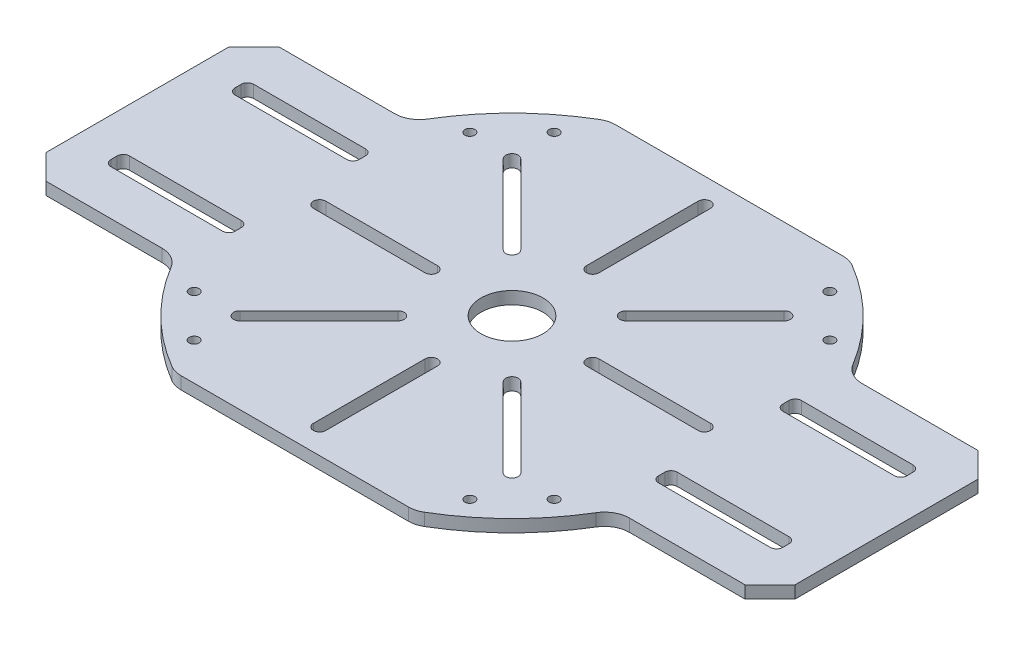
ISO-10303-21;
HEADER;
FILE_DESCRIPTION(('STEP AP214'),'2;1');
FILE_NAME('part.step','',(''),(''),'','','');
FILE_SCHEMA(('AUTOMOTIVE_DESIGN { 1 0 10303 214 1 1 1 1 }'));
ENDSEC;
DATA;
#1=APPLICATION_CONTEXT('core data for automotive mechanical design processes');
#2=APPLICATION_PROTOCOL_DEFINITION('international standard','automotive_design',2000,#1);
#3=PRODUCT_CONTEXT('',#1,'mechanical');
#4=PRODUCT('Part','Part','',(#3));
#5=PRODUCT_RELATED_PRODUCT_CATEGORY('part','',(#4));
#6=PRODUCT_DEFINITION_FORMATION('','',#4);
#7=PRODUCT_DEFINITION_CONTEXT('part definition',#1,'design');
#8=PRODUCT_DEFINITION('design','',#6,#7);
#9=PRODUCT_DEFINITION_SHAPE('','',#8);
#10=(LENGTH_UNIT() NAMED_UNIT(*) SI_UNIT(.MILLI.,.METRE.));
#11=(NAMED_UNIT(*) PLANE_ANGLE_UNIT() SI_UNIT($,.RADIAN.));
#12=(NAMED_UNIT(*) SI_UNIT($,.STERADIAN.) SOLID_ANGLE_UNIT());
#13=UNCERTAINTY_MEASURE_WITH_UNIT(LENGTH_MEASURE(1.E-05),#10,'distance_accuracy_value','');
#14=(GEOMETRIC_REPRESENTATION_CONTEXT(3) GLOBAL_UNCERTAINTY_ASSIGNED_CONTEXT((#13)) GLOBAL_UNIT_ASSIGNED_CONTEXT((#10,
#11,#12)) REPRESENTATION_CONTEXT('',''));
#15=CARTESIAN_POINT('',(0.,0.,0.));
#16=DIRECTION('',(0.,0.,1.));
#17=DIRECTION('',(1.,0.,0.));
#18=AXIS2_PLACEMENT_3D('',#15,#16,#17);
#19=CARTESIAN_POINT('',(23.2448166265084,2.54,39.37));
#20=DIRECTION('',(0.,-1.,0.));
#21=DIRECTION('',(0.,0.,-1.));
#22=AXIS2_PLACEMENT_3D('',#19,#20,#21);
#23=PLANE('',#22);
#24=DIRECTION('',(0.,0.,1.));
#25=VECTOR('',#24,1.);
#26=CARTESIAN_POINT('',(-68.7228749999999,2.54,-13.335));
#27=LINE('',#26,#25);
#28=CARTESIAN_POINT('',(-68.7228749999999,2.54,-13.335));
#29=VERTEX_POINT('',#28);
#30=CARTESIAN_POINT('',(-68.7228749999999,2.54,-12.065));
#31=VERTEX_POINT('',#30);
#32=EDGE_CURVE('E617',#29,#31,#27,.T.);
#33=ORIENTED_EDGE('',*,*,#32,.F.);
#34=CARTESIAN_POINT('',(-67.4528749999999,2.54,-13.335));
#35=DIRECTION('',(0.,1.,0.));
#36=DIRECTION('',(0.,0.,-1.));
#37=AXIS2_PLACEMENT_3D('',#34,#35,#36);
#38=CIRCLE('',#37,1.27);
#39=CARTESIAN_POINT('',(-67.4528749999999,2.54,-14.605));
#40=VERTEX_POINT('',#39);
#41=EDGE_CURVE('E48',#40,#29,#38,.T.);
#42=ORIENTED_EDGE('',*,*,#41,.F.);
#43=DIRECTION('',(-1.,0.,0.));
#44=VECTOR('',#43,1.);
#45=CARTESIAN_POINT('',(-44.5928749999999,2.54,-14.605));
#46=LINE('',#45,#44);
#47=CARTESIAN_POINT('',(-44.5928749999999,2.54,-14.605));
#48=VERTEX_POINT('',#47);
#49=EDGE_CURVE('E597',#48,#40,#46,.T.);
#50=ORIENTED_EDGE('',*,*,#49,.F.);
#51=CARTESIAN_POINT('',(-44.5928749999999,2.54,-13.335));
#52=DIRECTION('',(0.,1.,0.));
#53=DIRECTION('',(0.,0.,1.));
#54=AXIS2_PLACEMENT_3D('',#51,#52,#53);
#55=CIRCLE('',#54,1.27);
#56=CARTESIAN_POINT('',(-43.3228749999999,2.54,-13.335));
#57=VERTEX_POINT('',#56);
#58=EDGE_CURVE('E600',#57,#48,#55,.T.);
#59=ORIENTED_EDGE('',*,*,#58,.F.);
#60=DIRECTION('',(0.,0.,-1.));
#61=VECTOR('',#60,1.);
#62=CARTESIAN_POINT('',(-43.3228749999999,2.54,-13.335));
#63=LINE('',#62,#61);
#64=CARTESIAN_POINT('',(-43.3228749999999,2.54,-12.065));
#65=VERTEX_POINT('',#64);
#66=EDGE_CURVE('E628',#65,#57,#63,.T.);
#67=ORIENTED_EDGE('',*,*,#66,.F.);
#68=CARTESIAN_POINT('',(-44.5928749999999,2.54,-12.065));
#69=DIRECTION('',(0.,1.,0.));
#70=DIRECTION('',(0.,0.,1.));
#71=AXIS2_PLACEMENT_3D('',#68,#69,#70);
#72=CIRCLE('',#71,1.27);
#73=CARTESIAN_POINT('',(-44.5928749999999,2.54,-10.795));
#74=VERTEX_POINT('',#73);
#75=EDGE_CURVE('E625',#74,#65,#72,.T.);
#76=ORIENTED_EDGE('',*,*,#75,.F.);
#77=DIRECTION('',(1.,0.,0.));
#78=VECTOR('',#77,1.);
#79=CARTESIAN_POINT('',(-44.5928749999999,2.54,-10.795));
#80=LINE('',#79,#78);
#81=CARTESIAN_POINT('',(-67.4528749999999,2.54,-10.795));
#82=VERTEX_POINT('',#81);
#83=EDGE_CURVE('E622',#82,#74,#80,.T.);
#84=ORIENTED_EDGE('',*,*,#83,.F.);
#85=CARTESIAN_POINT('',(-67.4528749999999,2.54,-12.065));
#86=DIRECTION('',(0.,1.,0.));
#87=DIRECTION('',(0.,0.,1.));
#88=AXIS2_PLACEMENT_3D('',#85,#86,#87);
#89=CIRCLE('',#88,1.27);
#90=EDGE_CURVE('E619',#31,#82,#89,.T.);
#91=ORIENTED_EDGE('',*,*,#90,.F.);
#92=EDGE_LOOP('',(#33,#42,#50,#59,#67,#76,#84,#91));
#93=FACE_BOUND('',#92,.T.);
#94=DIRECTION('',(0.,0.,-1.));
#95=VECTOR('',#94,1.);
#96=CARTESIAN_POINT('',(-43.3228749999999,2.54,13.335));
#97=LINE('',#96,#95);
#98=CARTESIAN_POINT('',(-43.3228749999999,2.54,13.335));
#99=VERTEX_POINT('',#98);
#100=CARTESIAN_POINT('',(-43.3228749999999,2.54,12.065));
#101=VERTEX_POINT('',#100);
#102=EDGE_CURVE('E674',#99,#101,#97,.T.);
#103=ORIENTED_EDGE('',*,*,#102,.F.);
#104=CARTESIAN_POINT('',(-44.5928749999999,2.54,13.335));
#105=DIRECTION('',(0.,1.,0.));
#106=DIRECTION('',(0.,0.,-1.));
#107=AXIS2_PLACEMENT_3D('',#104,#105,#106);
#108=CIRCLE('',#107,1.27);
#109=CARTESIAN_POINT('',(-44.5928749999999,2.54,14.605));
#110=VERTEX_POINT('',#109);
#111=EDGE_CURVE('E635',#110,#99,#108,.T.);
#112=ORIENTED_EDGE('',*,*,#111,.F.);
#113=DIRECTION('',(1.,0.,0.));
#114=VECTOR('',#113,1.);
#115=CARTESIAN_POINT('',(-44.5928749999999,2.54,14.605));
#116=LINE('',#115,#114);
#117=CARTESIAN_POINT('',(-67.4528749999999,2.54,14.605));
#118=VERTEX_POINT('',#117);
#119=EDGE_CURVE('E651',#118,#110,#116,.T.);
#120=ORIENTED_EDGE('',*,*,#119,.F.);
#121=CARTESIAN_POINT('',(-67.4528749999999,2.54,13.335));
#122=DIRECTION('',(0.,1.,0.));
#123=DIRECTION('',(0.,0.,1.));
#124=AXIS2_PLACEMENT_3D('',#121,#122,#123);
#125=CIRCLE('',#124,1.27);
#126=CARTESIAN_POINT('',(-68.7228749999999,2.54,13.335));
#127=VERTEX_POINT('',#126);
#128=EDGE_CURVE('E689',#127,#118,#125,.T.);
#129=ORIENTED_EDGE('',*,*,#128,.F.);
#130=DIRECTION('',(0.,0.,1.));
#131=VECTOR('',#130,1.);
#132=CARTESIAN_POINT('',(-68.7228749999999,2.54,13.335));
#133=LINE('',#132,#131);
#134=CARTESIAN_POINT('',(-68.7228749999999,2.54,12.065));
#135=VERTEX_POINT('',#134);
#136=EDGE_CURVE('E686',#135,#127,#133,.T.);
#137=ORIENTED_EDGE('',*,*,#136,.F.);
#138=CARTESIAN_POINT('',(-67.4528749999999,2.54,12.065));
#139=DIRECTION('',(0.,1.,0.));
#140=DIRECTION('',(0.,0.,-1.));
#141=AXIS2_PLACEMENT_3D('',#138,#139,#140);
#142=CIRCLE('',#141,1.27);
#143=CARTESIAN_POINT('',(-67.4528749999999,2.54,10.795));
#144=VERTEX_POINT('',#143);
#145=EDGE_CURVE('E683',#144,#135,#142,.T.);
#146=ORIENTED_EDGE('',*,*,#145,.F.);
#147=DIRECTION('',(-1.,0.,0.));
#148=VECTOR('',#147,1.);
#149=CARTESIAN_POINT('',(-44.5928749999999,2.54,10.795));
#150=LINE('',#149,#148);
#151=CARTESIAN_POINT('',(-44.5928749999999,2.54,10.795));
#152=VERTEX_POINT('',#151);
#153=EDGE_CURVE('E680',#152,#144,#150,.T.);
#154=ORIENTED_EDGE('',*,*,#153,.F.);
#155=CARTESIAN_POINT('',(-44.5928749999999,2.54,12.065));
#156=DIRECTION('',(0.,1.,0.));
#157=DIRECTION('',(0.,0.,-1.));
#158=AXIS2_PLACEMENT_3D('',#155,#156,#157);
#159=CIRCLE('',#158,1.27);
#160=EDGE_CURVE('E677',#101,#152,#159,.T.);
#161=ORIENTED_EDGE('',*,*,#160,.F.);
#162=EDGE_LOOP('',(#103,#112,#120,#129,#137,#146,#154,#161));
#163=FACE_BOUND('',#162,.T.);
#164=DIRECTION('',(-1.,0.,0.));
#165=VECTOR('',#164,1.);
#166=CARTESIAN_POINT('',(44.5928749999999,2.54,10.795));
#167=LINE('',#166,#165);
#168=CARTESIAN_POINT('',(67.4528749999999,2.54,10.795));
#169=VERTEX_POINT('',#168);
#170=CARTESIAN_POINT('',(44.5928749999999,2.54,10.795));
#171=VERTEX_POINT('',#170);
#172=EDGE_CURVE('E738',#169,#171,#167,.T.);
#173=ORIENTED_EDGE('',*,*,#172,.F.);
#174=CARTESIAN_POINT('',(67.4528749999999,2.54,12.065));
#175=DIRECTION('',(0.,1.,0.));
#176=DIRECTION('',(0.,0.,1.));
#177=AXIS2_PLACEMENT_3D('',#174,#175,#176);
#178=CIRCLE('',#177,1.27);
#179=CARTESIAN_POINT('',(68.7228749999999,2.54,12.065));
#180=VERTEX_POINT('',#179);
#181=EDGE_CURVE('E696',#180,#169,#178,.T.);
#182=ORIENTED_EDGE('',*,*,#181,.F.);
#183=DIRECTION('',(0.,0.,-1.));
#184=VECTOR('',#183,1.);
#185=CARTESIAN_POINT('',(68.7228749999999,2.54,13.335));
#186=LINE('',#185,#184);
#187=CARTESIAN_POINT('',(68.7228749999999,2.54,13.335));
#188=VERTEX_POINT('',#187);
#189=EDGE_CURVE('E715',#188,#180,#186,.T.);
#190=ORIENTED_EDGE('',*,*,#189,.F.);
#191=CARTESIAN_POINT('',(67.4528749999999,2.54,13.335));
#192=DIRECTION('',(0.,1.,0.));
#193=DIRECTION('',(0.,0.,-1.));
#194=AXIS2_PLACEMENT_3D('',#191,#192,#193);
#195=CIRCLE('',#194,1.27);
#196=CARTESIAN_POINT('',(67.4528749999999,2.54,14.605));
#197=VERTEX_POINT('',#196);
#198=EDGE_CURVE('E753',#197,#188,#195,.T.);
#199=ORIENTED_EDGE('',*,*,#198,.F.);
#200=DIRECTION('',(1.,0.,0.));
#201=VECTOR('',#200,1.);
#202=CARTESIAN_POINT('',(44.5928749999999,2.54,14.605));
#203=LINE('',#202,#201);
#204=CARTESIAN_POINT('',(44.5928749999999,2.54,14.605));
#205=VERTEX_POINT('',#204);
#206=EDGE_CURVE('E750',#205,#197,#203,.T.);
#207=ORIENTED_EDGE('',*,*,#206,.F.);
#208=CARTESIAN_POINT('',(44.5928749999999,2.54,13.335));
#209=DIRECTION('',(0.,1.,0.));
#210=DIRECTION('',(0.,0.,1.));
#211=AXIS2_PLACEMENT_3D('',#208,#209,#210);
#212=CIRCLE('',#211,1.27);
#213=CARTESIAN_POINT('',(43.3228749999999,2.54,13.335));
#214=VERTEX_POINT('',#213);
#215=EDGE_CURVE('E747',#214,#205,#212,.T.);
#216=ORIENTED_EDGE('',*,*,#215,.F.);
#217=DIRECTION('',(0.,0.,1.));
#218=VECTOR('',#217,1.);
#219=CARTESIAN_POINT('',(43.3228749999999,2.54,13.335));
#220=LINE('',#219,#218);
#221=CARTESIAN_POINT('',(43.3228749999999,2.54,12.065));
#222=VERTEX_POINT('',#221);
#223=EDGE_CURVE('E744',#222,#214,#220,.T.);
#224=ORIENTED_EDGE('',*,*,#223,.F.);
#225=CARTESIAN_POINT('',(44.5928749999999,2.54,12.065));
#226=DIRECTION('',(0.,1.,0.));
#227=DIRECTION('',(0.,0.,1.));
#228=AXIS2_PLACEMENT_3D('',#225,#226,#227);
#229=CIRCLE('',#228,1.27);
#230=EDGE_CURVE('E741',#171,#222,#229,.T.);
#231=ORIENTED_EDGE('',*,*,#230,.F.);
#232=EDGE_LOOP('',(#173,#182,#190,#199,#207,#216,#224,#231));
#233=FACE_BOUND('',#232,.T.);
#234=DIRECTION('',(1.,0.,0.));
#235=VECTOR('',#234,1.);
#236=CARTESIAN_POINT('',(44.5928749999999,2.54,-10.795));
#237=LINE('',#236,#235);
#238=CARTESIAN_POINT('',(44.5928749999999,2.54,-10.795));
#239=VERTEX_POINT('',#238);
#240=CARTESIAN_POINT('',(67.4528749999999,2.54,-10.795));
#241=VERTEX_POINT('',#240);
#242=EDGE_CURVE('E802',#239,#241,#237,.T.);
#243=ORIENTED_EDGE('',*,*,#242,.F.);
#244=CARTESIAN_POINT('',(44.5928749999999,2.54,-12.065));
#245=DIRECTION('',(0.,1.,0.));
#246=DIRECTION('',(0.,0.,-1.));
#247=AXIS2_PLACEMENT_3D('',#244,#245,#246);
#248=CIRCLE('',#247,1.27);
#249=CARTESIAN_POINT('',(43.3228749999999,2.54,-12.065));
#250=VERTEX_POINT('',#249);
#251=EDGE_CURVE('E760',#250,#239,#248,.T.);
#252=ORIENTED_EDGE('',*,*,#251,.F.);
#253=DIRECTION('',(0.,0.,1.));
#254=VECTOR('',#253,1.);
#255=CARTESIAN_POINT('',(43.3228749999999,2.54,-13.335));
#256=LINE('',#255,#254);
#257=CARTESIAN_POINT('',(43.3228749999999,2.54,-13.335));
#258=VERTEX_POINT('',#257);
#259=EDGE_CURVE('E779',#258,#250,#256,.T.);
#260=ORIENTED_EDGE('',*,*,#259,.F.);
#261=CARTESIAN_POINT('',(44.5928749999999,2.54,-13.335));
#262=DIRECTION('',(0.,1.,0.));
#263=DIRECTION('',(0.,0.,-1.));
#264=AXIS2_PLACEMENT_3D('',#261,#262,#263);
#265=CIRCLE('',#264,1.27);
#266=CARTESIAN_POINT('',(44.5928749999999,2.54,-14.605));
#267=VERTEX_POINT('',#266);
#268=EDGE_CURVE('E817',#267,#258,#265,.T.);
#269=ORIENTED_EDGE('',*,*,#268,.F.);
#270=DIRECTION('',(-1.,0.,0.));
#271=VECTOR('',#270,1.);
#272=CARTESIAN_POINT('',(44.5928749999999,2.54,-14.605));
#273=LINE('',#272,#271);
#274=CARTESIAN_POINT('',(67.4528749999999,2.54,-14.605));
#275=VERTEX_POINT('',#274);
#276=EDGE_CURVE('E814',#275,#267,#273,.T.);
#277=ORIENTED_EDGE('',*,*,#276,.F.);
#278=CARTESIAN_POINT('',(67.4528749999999,2.54,-13.335));
#279=DIRECTION('',(0.,1.,0.));
#280=DIRECTION('',(0.,0.,1.));
#281=AXIS2_PLACEMENT_3D('',#278,#279,#280);
#282=CIRCLE('',#281,1.27);
#283=CARTESIAN_POINT('',(68.7228749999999,2.54,-13.335));
#284=VERTEX_POINT('',#283);
#285=EDGE_CURVE('E811',#284,#275,#282,.T.);
#286=ORIENTED_EDGE('',*,*,#285,.F.);
#287=DIRECTION('',(0.,0.,-1.));
#288=VECTOR('',#287,1.);
#289=CARTESIAN_POINT('',(68.7228749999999,2.54,-13.335));
#290=LINE('',#289,#288);
#291=CARTESIAN_POINT('',(68.7228749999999,2.54,-12.065));
#292=VERTEX_POINT('',#291);
#293=EDGE_CURVE('E808',#292,#284,#290,.T.);
#294=ORIENTED_EDGE('',*,*,#293,.F.);
#295=CARTESIAN_POINT('',(67.4528749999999,2.54,-12.065));
#296=DIRECTION('',(0.,1.,0.));
#297=DIRECTION('',(0.,0.,-1.));
#298=AXIS2_PLACEMENT_3D('',#295,#296,#297);
#299=CIRCLE('',#298,1.27);
#300=EDGE_CURVE('E805',#241,#292,#299,.T.);
#301=ORIENTED_EDGE('',*,*,#300,.F.);
#302=EDGE_LOOP('',(#243,#252,#260,#269,#277,#286,#294,#301));
#303=FACE_BOUND('',#302,.T.);
#304=DIRECTION('',(0.,0.,-1.));
#305=VECTOR('',#304,1.);
#306=CARTESIAN_POINT('',(1.2700000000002,2.54,-16.51));
#307=LINE('',#306,#305);
#308=CARTESIAN_POINT('',(1.2700000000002,2.54,-16.51));
#309=VERTEX_POINT('',#308);
#310=CARTESIAN_POINT('',(1.27000000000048,2.54,-39.37));
#311=VERTEX_POINT('',#310);
#312=EDGE_CURVE('E854',#309,#311,#307,.T.);
#313=ORIENTED_EDGE('',*,*,#312,.F.);
#314=CARTESIAN_POINT('',(1.99493199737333E-13,2.54,-16.51));
#315=DIRECTION('',(0.,1.,0.));
#316=DIRECTION('',(0.,0.,1.));
#317=AXIS2_PLACEMENT_3D('',#314,#315,#316);
#318=CIRCLE('',#317,1.27);
#319=CARTESIAN_POINT('',(-1.2699999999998,2.54,-16.51));
#320=VERTEX_POINT('',#319);
#321=EDGE_CURVE('E824',#320,#309,#318,.T.);
#322=ORIENTED_EDGE('',*,*,#321,.F.);
#323=DIRECTION('',(0.,0.,1.));
#324=VECTOR('',#323,1.);
#325=CARTESIAN_POINT('',(-1.2699999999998,2.54,-16.51));
#326=LINE('',#325,#324);
#327=CARTESIAN_POINT('',(-1.26999999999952,2.54,-39.37));
#328=VERTEX_POINT('',#327);
#329=EDGE_CURVE('E843',#328,#320,#326,.T.);
#330=ORIENTED_EDGE('',*,*,#329,.F.);
#331=CARTESIAN_POINT('',(4.82253126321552E-13,2.54,-39.37));
#332=DIRECTION('',(0.,1.,0.));
#333=DIRECTION('',(0.,0.,1.));
#334=AXIS2_PLACEMENT_3D('',#331,#332,#333);
#335=CIRCLE('',#334,1.27);
#336=EDGE_CURVE('E857',#311,#328,#335,.T.);
#337=ORIENTED_EDGE('',*,*,#336,.F.);
#338=EDGE_LOOP('',(#313,#322,#330,#337));
#339=FACE_BOUND('',#338,.T.);
#340=DIRECTION('',(-0.70710678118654,0.,-0.707106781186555));
#341=VECTOR('',#340,1.);
#342=CARTESIAN_POINT('',(-10.7763073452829,2.54,-12.5723585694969));
#343=LINE('',#342,#341);
#344=CARTESIAN_POINT('',(-10.7763073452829,2.54,-12.5723585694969));
#345=VERTEX_POINT('',#344);
#346=CARTESIAN_POINT('',(-26.9407683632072,2.54,-28.7368195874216));
#347=VERTEX_POINT('',#346);
#348=EDGE_CURVE('E886',#345,#347,#343,.T.);
#349=ORIENTED_EDGE('',*,*,#348,.F.);
#350=CARTESIAN_POINT('',(-11.6743329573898,2.54,-11.67433295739));
#351=DIRECTION('',(0.,1.,0.));
#352=DIRECTION('',(0.,0.,1.));
#353=AXIS2_PLACEMENT_3D('',#350,#351,#352);
#354=CIRCLE('',#353,1.27);
#355=CARTESIAN_POINT('',(-12.5723585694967,2.54,-10.7763073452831));
#356=VERTEX_POINT('',#355);
#357=EDGE_CURVE('E864',#356,#345,#354,.T.);
#358=ORIENTED_EDGE('',*,*,#357,.F.);
#359=DIRECTION('',(0.70710678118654,0.,0.707106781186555));
#360=VECTOR('',#359,1.);
#361=CARTESIAN_POINT('',(-12.5723585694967,2.54,-10.7763073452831));
#362=LINE('',#361,#360);
#363=CARTESIAN_POINT('',(-28.736819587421,2.54,-26.9407683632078));
#364=VERTEX_POINT('',#363);
#365=EDGE_CURVE('E875',#364,#356,#362,.T.);
#366=ORIENTED_EDGE('',*,*,#365,.F.);
#367=CARTESIAN_POINT('',(-27.8387939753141,2.54,-27.8387939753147));
#368=DIRECTION('',(0.,1.,0.));
#369=DIRECTION('',(0.,0.,1.));
#370=AXIS2_PLACEMENT_3D('',#367,#368,#369);
#371=CIRCLE('',#370,1.27);
#372=EDGE_CURVE('E889',#347,#364,#371,.T.);
#373=ORIENTED_EDGE('',*,*,#372,.F.);
#374=EDGE_LOOP('',(#349,#358,#366,#373));
#375=FACE_BOUND('',#374,.T.);
#376=DIRECTION('',(-1.,0.,0.));
#377=VECTOR('',#376,1.);
#378=CARTESIAN_POINT('',(-16.51,2.54,-1.27000000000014));
#379=LINE('',#378,#377);
#380=CARTESIAN_POINT('',(-16.51,2.54,-1.27000000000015));
#381=VERTEX_POINT('',#380);
#382=CARTESIAN_POINT('',(-39.37,2.54,-1.27000000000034));
#383=VERTEX_POINT('',#382);
#384=EDGE_CURVE('E918',#381,#383,#379,.T.);
#385=ORIENTED_EDGE('',*,*,#384,.F.);
#386=CARTESIAN_POINT('',(-16.51,2.54,-1.42247325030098E-13));
#387=DIRECTION('',(0.,1.,0.));
#388=DIRECTION('',(0.,0.,1.));
#389=AXIS2_PLACEMENT_3D('',#386,#387,#388);
#390=CIRCLE('',#389,1.27);
#391=CARTESIAN_POINT('',(-16.51,2.54,1.26999999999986));
#392=VERTEX_POINT('',#391);
#393=EDGE_CURVE('E896',#392,#381,#390,.T.);
#394=ORIENTED_EDGE('',*,*,#393,.F.);
#395=DIRECTION('',(1.,0.,0.));
#396=VECTOR('',#395,1.);
#397=CARTESIAN_POINT('',(-16.51,2.54,1.26999999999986));
#398=LINE('',#397,#396);
#399=CARTESIAN_POINT('',(-39.37,2.54,1.26999999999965));
#400=VERTEX_POINT('',#399);
#401=EDGE_CURVE('E907',#400,#392,#398,.T.);
#402=ORIENTED_EDGE('',*,*,#401,.F.);
#403=CARTESIAN_POINT('',(-39.37,2.54,-3.43475248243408E-13));
#404=DIRECTION('',(0.,1.,0.));
#405=DIRECTION('',(0.,0.,1.));
#406=AXIS2_PLACEMENT_3D('',#403,#404,#405);
#407=CIRCLE('',#406,1.27);
#408=EDGE_CURVE('E921',#383,#400,#407,.T.);
#409=ORIENTED_EDGE('',*,*,#408,.F.);
#410=EDGE_LOOP('',(#385,#394,#402,#409));
#411=FACE_BOUND('',#410,.T.);
#412=DIRECTION('',(-0.707106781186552,0.,0.707106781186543));
#413=VECTOR('',#412,1.);
#414=CARTESIAN_POINT('',(-12.5723585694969,2.54,10.7763073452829));
#415=LINE('',#414,#413);
#416=CARTESIAN_POINT('',(-12.5723585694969,2.54,10.7763073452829));
#417=VERTEX_POINT('',#416);
#418=CARTESIAN_POINT('',(-28.7368195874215,2.54,26.9407683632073));
#419=VERTEX_POINT('',#418);
#420=EDGE_CURVE('E950',#417,#419,#415,.T.);
#421=ORIENTED_EDGE('',*,*,#420,.F.);
#422=CARTESIAN_POINT('',(-11.67433295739,2.54,11.6743329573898));
#423=DIRECTION('',(0.,1.,0.));
#424=DIRECTION('',(0.,0.,1.));
#425=AXIS2_PLACEMENT_3D('',#422,#423,#424);
#426=CIRCLE('',#425,1.27);
#427=CARTESIAN_POINT('',(-10.7763073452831,2.54,12.5723585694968));
#428=VERTEX_POINT('',#427);
#429=EDGE_CURVE('E928',#428,#417,#426,.T.);
#430=ORIENTED_EDGE('',*,*,#429,.F.);
#431=DIRECTION('',(0.707106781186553,0.,-0.707106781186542));
#432=VECTOR('',#431,1.);
#433=CARTESIAN_POINT('',(-10.7763073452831,2.54,12.5723585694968));
#434=LINE('',#433,#432);
#435=CARTESIAN_POINT('',(-26.9407683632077,2.54,28.7368195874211));
#436=VERTEX_POINT('',#435);
#437=EDGE_CURVE('E939',#436,#428,#434,.T.);
#438=ORIENTED_EDGE('',*,*,#437,.F.);
#439=CARTESIAN_POINT('',(-27.8387939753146,2.54,27.8387939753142));
#440=DIRECTION('',(0.,1.,0.));
#441=DIRECTION('',(0.,0.,1.));
#442=AXIS2_PLACEMENT_3D('',#439,#440,#441);
#443=CIRCLE('',#442,1.27);
#444=EDGE_CURVE('E953',#419,#436,#443,.T.);
#445=ORIENTED_EDGE('',*,*,#444,.F.);
#446=EDGE_LOOP('',(#421,#430,#438,#445));
#447=FACE_BOUND('',#446,.T.);
#448=DIRECTION('',(0.,0.,1.));
#449=VECTOR('',#448,1.);
#450=CARTESIAN_POINT('',(-1.27000000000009,2.54,16.51));
#451=LINE('',#450,#449);
#452=CARTESIAN_POINT('',(-1.27000000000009,2.54,16.51));
#453=VERTEX_POINT('',#452);
#454=CARTESIAN_POINT('',(-1.2700000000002,2.54,39.37));
#455=VERTEX_POINT('',#454);
#456=EDGE_CURVE('E982',#453,#455,#451,.T.);
#457=ORIENTED_EDGE('',*,*,#456,.F.);
#458=CARTESIAN_POINT('',(0.,2.54,16.51));
#459=DIRECTION('',(0.,1.,0.));
#460=DIRECTION('',(0.,0.,1.));
#461=AXIS2_PLACEMENT_3D('',#458,#459,#460);
#462=CIRCLE('',#461,1.27);
#463=CARTESIAN_POINT('',(1.26999999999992,2.54,16.51));
#464=VERTEX_POINT('',#463);
#465=EDGE_CURVE('E960',#464,#453,#462,.T.);
#466=ORIENTED_EDGE('',*,*,#465,.F.);
#467=DIRECTION('',(0.,0.,-1.));
#468=VECTOR('',#467,1.);
#469=CARTESIAN_POINT('',(1.26999999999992,2.54,16.51));
#470=LINE('',#469,#468);
#471=CARTESIAN_POINT('',(1.26999999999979,2.54,39.37));
#472=VERTEX_POINT('',#471);
#473=EDGE_CURVE('E971',#472,#464,#470,.T.);
#474=ORIENTED_EDGE('',*,*,#473,.F.);
#475=CARTESIAN_POINT('',(-2.04697370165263E-13,2.54,39.37));
#476=DIRECTION('',(0.,1.,0.));
#477=DIRECTION('',(0.,0.,1.));
#478=AXIS2_PLACEMENT_3D('',#475,#476,#477);
#479=CIRCLE('',#478,1.27);
#480=EDGE_CURVE('E985',#455,#472,#479,.T.);
#481=ORIENTED_EDGE('',*,*,#480,.F.);
#482=EDGE_LOOP('',(#457,#466,#474,#481));
#483=FACE_BOUND('',#482,.T.);
#484=DIRECTION('',(0.707106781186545,0.,0.70710678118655));
#485=VECTOR('',#484,1.);
#486=CARTESIAN_POINT('',(10.776307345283,2.54,12.5723585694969));
#487=LINE('',#486,#485);
#488=CARTESIAN_POINT('',(10.776307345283,2.54,12.5723585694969));
#489=VERTEX_POINT('',#488);
#490=CARTESIAN_POINT('',(26.9407683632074,2.54,28.7368195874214));
#491=VERTEX_POINT('',#490);
#492=EDGE_CURVE('E1014',#489,#491,#487,.T.);
#493=ORIENTED_EDGE('',*,*,#492,.F.);
#494=CARTESIAN_POINT('',(11.6743329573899,2.54,11.67433295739));
#495=DIRECTION('',(0.,1.,0.));
#496=DIRECTION('',(0.,0.,1.));
#497=AXIS2_PLACEMENT_3D('',#494,#495,#496);
#498=CIRCLE('',#497,1.27);
#499=CARTESIAN_POINT('',(12.5723585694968,2.54,10.776307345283));
#500=VERTEX_POINT('',#499);
#501=EDGE_CURVE('E992',#500,#489,#498,.T.);
#502=ORIENTED_EDGE('',*,*,#501,.F.);
#503=DIRECTION('',(-0.707106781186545,0.,-0.70710678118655));
#504=VECTOR('',#503,1.);
#505=CARTESIAN_POINT('',(12.5723585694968,2.54,10.776307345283));
#506=LINE('',#505,#504);
#507=CARTESIAN_POINT('',(28.7368195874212,2.54,26.9407683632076));
#508=VERTEX_POINT('',#507);
#509=EDGE_CURVE('E1003',#508,#500,#506,.T.);
#510=ORIENTED_EDGE('',*,*,#509,.F.);
#511=CARTESIAN_POINT('',(27.8387939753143,2.54,27.8387939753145));
#512=DIRECTION('',(0.,1.,0.));
#513=DIRECTION('',(0.,0.,1.));
#514=AXIS2_PLACEMENT_3D('',#511,#512,#513);
#515=CIRCLE('',#514,1.27);
#516=EDGE_CURVE('E1017',#491,#508,#515,.T.);
#517=ORIENTED_EDGE('',*,*,#516,.F.);
#518=EDGE_LOOP('',(#493,#502,#510,#517));
#519=FACE_BOUND('',#518,.T.);
#520=DIRECTION('',(1.,0.,0.));
#521=VECTOR('',#520,1.);
#522=CARTESIAN_POINT('',(16.51,2.54,1.27000000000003));
#523=LINE('',#522,#521);
#524=CARTESIAN_POINT('',(16.51,2.54,1.27000000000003));
#525=VERTEX_POINT('',#524);
#526=CARTESIAN_POINT('',(39.37,2.54,1.27000000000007));
#527=VERTEX_POINT('',#526);
#528=EDGE_CURVE('E1046',#525,#527,#523,.T.);
#529=ORIENTED_EDGE('',*,*,#528,.F.);
#530=CARTESIAN_POINT('',(16.51,2.54,0.));
#531=DIRECTION('',(0.,1.,0.));
#532=DIRECTION('',(0.,0.,1.));
#533=AXIS2_PLACEMENT_3D('',#530,#531,#532);
#534=CIRCLE('',#533,1.27);
#535=CARTESIAN_POINT('',(16.51,2.54,-1.26999999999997));
#536=VERTEX_POINT('',#535);
#537=EDGE_CURVE('E1024',#536,#525,#534,.T.);
#538=ORIENTED_EDGE('',*,*,#537,.F.);
#539=DIRECTION('',(-1.,0.,0.));
#540=VECTOR('',#539,1.);
#541=CARTESIAN_POINT('',(16.51,2.54,-1.26999999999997));
#542=LINE('',#541,#540);
#543=CARTESIAN_POINT('',(39.37,2.54,-1.26999999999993));
#544=VERTEX_POINT('',#543);
#545=EDGE_CURVE('E1035',#544,#536,#542,.T.);
#546=ORIENTED_EDGE('',*,*,#545,.F.);
#547=CARTESIAN_POINT('',(39.37,2.54,0.));
#548=DIRECTION('',(0.,1.,0.));
#549=DIRECTION('',(0.,0.,1.));
#550=AXIS2_PLACEMENT_3D('',#547,#548,#549);
#551=CIRCLE('',#550,1.27);
#552=EDGE_CURVE('E1049',#527,#544,#551,.T.);
#553=ORIENTED_EDGE('',*,*,#552,.F.);
#554=EDGE_LOOP('',(#529,#538,#546,#553));
#555=FACE_BOUND('',#554,.T.);
#556=DIRECTION('',(0.707106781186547,0.,-0.707106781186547));
#557=VECTOR('',#556,1.);
#558=CARTESIAN_POINT('',(12.5723585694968,2.54,-10.776307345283));
#559=LINE('',#558,#557);
#560=CARTESIAN_POINT('',(12.5723585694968,2.54,-10.776307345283));
#561=VERTEX_POINT('',#560);
#562=CARTESIAN_POINT('',(28.7368195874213,2.54,-26.9407683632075));
#563=VERTEX_POINT('',#562);
#564=EDGE_CURVE('E1078',#561,#563,#559,.T.);
#565=ORIENTED_EDGE('',*,*,#564,.F.);
#566=CARTESIAN_POINT('',(11.6743329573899,2.54,-11.6743329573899));
#567=DIRECTION('',(0.,1.,0.));
#568=DIRECTION('',(0.,0.,1.));
#569=AXIS2_PLACEMENT_3D('',#566,#567,#568);
#570=CIRCLE('',#569,1.27);
#571=CARTESIAN_POINT('',(10.776307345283,2.54,-12.5723585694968));
#572=VERTEX_POINT('',#571);
#573=EDGE_CURVE('E1056',#572,#561,#570,.T.);
#574=ORIENTED_EDGE('',*,*,#573,.F.);
#575=DIRECTION('',(-0.707106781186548,0.,0.707106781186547));
#576=VECTOR('',#575,1.);
#577=CARTESIAN_POINT('',(10.776307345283,2.54,-12.5723585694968));
#578=LINE('',#577,#576);
#579=CARTESIAN_POINT('',(26.9407683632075,2.54,-28.7368195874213));
#580=VERTEX_POINT('',#579);
#581=EDGE_CURVE('E1067',#580,#572,#578,.T.);
#582=ORIENTED_EDGE('',*,*,#581,.F.);
#583=CARTESIAN_POINT('',(27.8387939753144,2.54,-27.8387939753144));
#584=DIRECTION('',(0.,1.,0.));
#585=DIRECTION('',(0.,0.,1.));
#586=AXIS2_PLACEMENT_3D('',#583,#584,#585);
#587=CIRCLE('',#586,1.27);
#588=EDGE_CURVE('E1081',#563,#580,#587,.T.);
#589=ORIENTED_EDGE('',*,*,#588,.F.);
#590=EDGE_LOOP('',(#565,#574,#582,#589));
#591=FACE_BOUND('',#590,.T.);
#592=CARTESIAN_POINT('',(23.2448166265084,2.54,39.37));
#593=DIRECTION('',(0.,1.,0.));
#594=DIRECTION('',(0.,0.,-1.));
#595=AXIS2_PLACEMENT_3D('',#592,#593,#594);
#596=CIRCLE('',#595,5.08);
#597=CARTESIAN_POINT('',(23.2448166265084,2.54,44.45));
#598=VERTEX_POINT('',#597);
#599=CARTESIAN_POINT('',(25.8275740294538,2.54,43.7444444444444));
#600=VERTEX_POINT('',#599);
#601=EDGE_CURVE('E1149',#598,#600,#596,.T.);
#602=ORIENTED_EDGE('',*,*,#601,.T.);
#603=CARTESIAN_POINT('',(0.,2.54,0.));
#604=DIRECTION('',(0.,1.,0.));
#605=DIRECTION('',(0.,0.,1.));
#606=AXIS2_PLACEMENT_3D('',#603,#604,#605);
#607=CIRCLE('',#606,50.8);
#608=CARTESIAN_POINT('',(43.4826634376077,2.54,26.2659090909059));
#609=VERTEX_POINT('',#608);
#610=EDGE_CURVE('E1152',#600,#609,#607,.T.);
#611=ORIENTED_EDGE('',*,*,#610,.T.);
#612=CARTESIAN_POINT('',(47.8309297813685,2.54,28.8924999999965));
#613=DIRECTION('',(0.,-1.,0.));
#614=DIRECTION('',(0.,0.,1.));
#615=AXIS2_PLACEMENT_3D('',#612,#613,#614);
#616=CIRCLE('',#615,5.08);
#617=CARTESIAN_POINT('',(47.8309297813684,2.54,23.8124999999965));
#618=VERTEX_POINT('',#617);
#619=EDGE_CURVE('E1155',#609,#618,#616,.T.);
#620=ORIENTED_EDGE('',*,*,#619,.T.);
#621=DIRECTION('',(1.,0.,0.));
#622=VECTOR('',#621,1.);
#623=CARTESIAN_POINT('',(47.8309297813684,2.54,23.8124999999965));
#624=LINE('',#623,#622);
#625=CARTESIAN_POINT('',(71.516875,2.54,23.812499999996));
#626=VERTEX_POINT('',#625);
#627=EDGE_CURVE('E1157',#618,#626,#624,.T.);
#628=ORIENTED_EDGE('',*,*,#627,.T.);
#629=DIRECTION('',(0.70710678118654,0.,-0.707106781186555));
#630=VECTOR('',#629,1.);
#631=CARTESIAN_POINT('',(71.516875,2.54,23.812499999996));
#632=LINE('',#631,#630);
#633=CARTESIAN_POINT('',(76.5968749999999,2.54,18.7324999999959));
#634=VERTEX_POINT('',#633);
#635=EDGE_CURVE('E1159',#626,#634,#632,.T.);
#636=ORIENTED_EDGE('',*,*,#635,.T.);
#637=DIRECTION('',(0.,0.,-1.));
#638=VECTOR('',#637,1.);
#639=CARTESIAN_POINT('',(76.596875,2.54,-18.7324999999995));
#640=LINE('',#639,#638);
#641=CARTESIAN_POINT('',(76.596875,2.54,-18.7324999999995));
#642=VERTEX_POINT('',#641);
#643=EDGE_CURVE('E1161',#634,#642,#640,.T.);
#644=ORIENTED_EDGE('',*,*,#643,.T.);
#645=DIRECTION('',(-0.70710678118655,0.,-0.707106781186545));
#646=VECTOR('',#645,1.);
#647=CARTESIAN_POINT('',(71.516875,2.54,-23.8124999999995));
#648=LINE('',#647,#646);
#649=CARTESIAN_POINT('',(71.516875,2.54,-23.8124999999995));
#650=VERTEX_POINT('',#649);
#651=EDGE_CURVE('E1163',#642,#650,#648,.T.);
#652=ORIENTED_EDGE('',*,*,#651,.T.);
#653=DIRECTION('',(-1.,0.,0.));
#654=VECTOR('',#653,1.);
#655=CARTESIAN_POINT('',(47.8309297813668,2.54,-23.8124999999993));
#656=LINE('',#655,#654);
#657=CARTESIAN_POINT('',(47.8309297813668,2.54,-23.8124999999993));
#658=VERTEX_POINT('',#657);
#659=EDGE_CURVE('E1165',#650,#658,#656,.T.);
#660=ORIENTED_EDGE('',*,*,#659,.T.);
#661=CARTESIAN_POINT('',(47.8309297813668,2.54,-28.8924999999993));
#662=DIRECTION('',(0.,-1.,0.));
#663=DIRECTION('',(0.,0.,1.));
#664=AXIS2_PLACEMENT_3D('',#661,#662,#663);
#665=CIRCLE('',#664,5.08);
#666=CARTESIAN_POINT('',(43.4826634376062,2.54,-26.2659090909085));
#667=VERTEX_POINT('',#666);
#668=EDGE_CURVE('E1167',#658,#667,#665,.T.);
#669=ORIENTED_EDGE('',*,*,#668,.T.);
#670=CARTESIAN_POINT('',(0.,2.54,0.));
#671=DIRECTION('',(0.,1.,0.));
#672=DIRECTION('',(0.,0.,1.));
#673=AXIS2_PLACEMENT_3D('',#670,#671,#672);
#674=CIRCLE('',#673,50.8);
#675=CARTESIAN_POINT('',(25.8275740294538,2.54,-43.7444444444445));
#676=VERTEX_POINT('',#675);
#677=EDGE_CURVE('E1169',#667,#676,#674,.T.);
#678=ORIENTED_EDGE('',*,*,#677,.T.);
#679=CARTESIAN_POINT('',(23.2448166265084,2.54,-39.37));
#680=DIRECTION('',(0.,1.,0.));
#681=DIRECTION('',(0.,0.,1.));
#682=AXIS2_PLACEMENT_3D('',#679,#680,#681);
#683=CIRCLE('',#682,5.08);
#684=CARTESIAN_POINT('',(23.2448166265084,2.54,-44.45));
#685=VERTEX_POINT('',#684);
#686=EDGE_CURVE('E1171',#676,#685,#683,.T.);
#687=ORIENTED_EDGE('',*,*,#686,.T.);
#688=DIRECTION('',(-1.,0.,0.));
#689=VECTOR('',#688,1.);
#690=CARTESIAN_POINT('',(-23.2448166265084,2.54,-44.45));
#691=LINE('',#690,#689);
#692=CARTESIAN_POINT('',(-23.2448166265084,2.54,-44.45));
#693=VERTEX_POINT('',#692);
#694=EDGE_CURVE('E1173',#685,#693,#691,.T.);
#695=ORIENTED_EDGE('',*,*,#694,.T.);
#696=CARTESIAN_POINT('',(-23.2448166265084,2.54,-39.37));
#697=DIRECTION('',(0.,1.,0.));
#698=DIRECTION('',(0.,0.,1.));
#699=AXIS2_PLACEMENT_3D('',#696,#697,#698);
#700=CIRCLE('',#699,5.08);
#701=CARTESIAN_POINT('',(-25.8275740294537,2.54,-43.7444444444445));
#702=VERTEX_POINT('',#701);
#703=EDGE_CURVE('E1175',#693,#702,#700,.T.);
#704=ORIENTED_EDGE('',*,*,#703,.T.);
#705=CARTESIAN_POINT('',(0.,2.54,0.));
#706=DIRECTION('',(0.,1.,0.));
#707=DIRECTION('',(0.,0.,1.));
#708=AXIS2_PLACEMENT_3D('',#705,#706,#707);
#709=CIRCLE('',#708,50.8);
#710=CARTESIAN_POINT('',(-43.4826634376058,2.54,-26.2659090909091));
#711=VERTEX_POINT('',#710);
#712=EDGE_CURVE('E1177',#702,#711,#709,.T.);
#713=ORIENTED_EDGE('',*,*,#712,.T.);
#714=CARTESIAN_POINT('',(-47.8309297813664,2.54,-28.8925));
#715=DIRECTION('',(0.,-1.,0.));
#716=DIRECTION('',(0.,0.,1.));
#717=AXIS2_PLACEMENT_3D('',#714,#715,#716);
#718=CIRCLE('',#717,5.08);
#719=CARTESIAN_POINT('',(-47.8309297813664,2.54,-23.8125));
#720=VERTEX_POINT('',#719);
#721=EDGE_CURVE('E1179',#711,#720,#718,.T.);
#722=ORIENTED_EDGE('',*,*,#721,.T.);
#723=DIRECTION('',(-1.,0.,0.));
#724=VECTOR('',#723,1.);
#725=CARTESIAN_POINT('',(-71.516875,2.54,-23.8125));
#726=LINE('',#725,#724);
#727=CARTESIAN_POINT('',(-71.516875,2.54,-23.8125));
#728=VERTEX_POINT('',#727);
#729=EDGE_CURVE('E1181',#720,#728,#726,.T.);
#730=ORIENTED_EDGE('',*,*,#729,.T.);
#731=DIRECTION('',(-0.707106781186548,0.,0.707106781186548));
#732=VECTOR('',#731,1.);
#733=CARTESIAN_POINT('',(-71.516875,2.54,-23.8125));
#734=LINE('',#733,#732);
#735=CARTESIAN_POINT('',(-76.596875,2.54,-18.7325));
#736=VERTEX_POINT('',#735);
#737=EDGE_CURVE('E1183',#728,#736,#734,.T.);
#738=ORIENTED_EDGE('',*,*,#737,.T.);
#739=DIRECTION('',(0.,0.,1.));
#740=VECTOR('',#739,1.);
#741=CARTESIAN_POINT('',(-76.596875,2.54,-18.7325));
#742=LINE('',#741,#740);
#743=CARTESIAN_POINT('',(-76.596875,2.54,18.7324999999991));
#744=VERTEX_POINT('',#743);
#745=EDGE_CURVE('E1185',#736,#744,#742,.T.);
#746=ORIENTED_EDGE('',*,*,#745,.T.);
#747=DIRECTION('',(0.707106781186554,0.,0.70710678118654));
#748=VECTOR('',#747,1.);
#749=CARTESIAN_POINT('',(-76.596875,2.54,18.7324999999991));
#750=LINE('',#749,#748);
#751=CARTESIAN_POINT('',(-71.516875,2.54,23.812499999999));
#752=VERTEX_POINT('',#751);
#753=EDGE_CURVE('E1187',#744,#752,#750,.T.);
#754=ORIENTED_EDGE('',*,*,#753,.T.);
#755=DIRECTION('',(1.,0.,0.));
#756=VECTOR('',#755,1.);
#757=CARTESIAN_POINT('',(-71.516875,2.54,23.812499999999));
#758=LINE('',#757,#756);
#759=CARTESIAN_POINT('',(-47.8309297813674,2.54,23.8124999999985));
#760=VERTEX_POINT('',#759);
#761=EDGE_CURVE('E1189',#752,#760,#758,.T.);
#762=ORIENTED_EDGE('',*,*,#761,.T.);
#763=CARTESIAN_POINT('',(-47.8309297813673,2.54,28.8924999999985));
#764=DIRECTION('',(0.,-1.,0.));
#765=DIRECTION('',(0.,0.,-1.));
#766=AXIS2_PLACEMENT_3D('',#763,#764,#765);
#767=CIRCLE('',#766,5.08);
#768=CARTESIAN_POINT('',(-43.4826634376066,2.54,26.2659090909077));
#769=VERTEX_POINT('',#768);
#770=EDGE_CURVE('E1191',#760,#769,#767,.T.);
#771=ORIENTED_EDGE('',*,*,#770,.T.);
#772=CARTESIAN_POINT('',(0.,2.54,0.));
#773=DIRECTION('',(0.,1.,0.));
#774=DIRECTION('',(0.,0.,1.));
#775=AXIS2_PLACEMENT_3D('',#772,#773,#774);
#776=CIRCLE('',#775,50.8);
#777=CARTESIAN_POINT('',(-25.8275740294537,2.54,43.7444444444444));
#778=VERTEX_POINT('',#777);
#779=EDGE_CURVE('E1193',#769,#778,#776,.T.);
#780=ORIENTED_EDGE('',*,*,#779,.T.);
#781=CARTESIAN_POINT('',(-23.2448166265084,2.54,39.37));
#782=DIRECTION('',(0.,1.,0.));
#783=DIRECTION('',(0.,0.,1.));
#784=AXIS2_PLACEMENT_3D('',#781,#782,#783);
#785=CIRCLE('',#784,5.08);
#786=CARTESIAN_POINT('',(-23.2448166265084,2.54,44.45));
#787=VERTEX_POINT('',#786);
#788=EDGE_CURVE('E1195',#778,#787,#785,.T.);
#789=ORIENTED_EDGE('',*,*,#788,.T.);
#790=DIRECTION('',(1.,0.,0.));
#791=VECTOR('',#790,1.);
#792=CARTESIAN_POINT('',(-23.2448166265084,2.54,44.45));
#793=LINE('',#792,#791);
#794=EDGE_CURVE('E1197',#787,#598,#793,.T.);
#795=ORIENTED_EDGE('',*,*,#794,.T.);
#796=EDGE_LOOP('',(#602,#611,#620,#628,#636,#644,#652,#660,#669,#678,#687,#695,#704,#713,#722,
#730,#738,#746,#754,#762,#771,#780,#789,#795));
#797=FACE_BOUND('',#796,.T.);
#798=CARTESIAN_POINT('',(36.8190500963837,2.54,-28.1980042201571));
#799=DIRECTION('',(0.,1.,0.));
#800=DIRECTION('',(0.,0.,1.));
#801=AXIS2_PLACEMENT_3D('',#798,#799,#800);
#802=CIRCLE('',#801,1.016);
#803=CARTESIAN_POINT('',(36.8190500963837,2.54,-27.1820042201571));
#804=VERTEX_POINT('',#803);
#805=EDGE_CURVE('E1143',#804,#804,#802,.T.);
#806=ORIENTED_EDGE('',*,*,#805,.F.);
#807=EDGE_LOOP('',(#806));
#808=FACE_BOUND('',#807,.T.);
#809=CARTESIAN_POINT('',(0.,2.54,0.));
#810=DIRECTION('',(0.,1.,0.));
#811=DIRECTION('',(0.,0.,1.));
#812=AXIS2_PLACEMENT_3D('',#809,#810,#811);
#813=CIRCLE('',#812,6.35);
#814=CARTESIAN_POINT('',(0.,2.54,6.34999999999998));
#815=VERTEX_POINT('',#814);
#816=EDGE_CURVE('E1137',#815,#815,#813,.T.);
#817=ORIENTED_EDGE('',*,*,#816,.F.);
#818=EDGE_LOOP('',(#817));
#819=FACE_BOUND('',#818,.T.);
#820=CARTESIAN_POINT('',(28.1980042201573,2.54,-36.8190500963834));
#821=DIRECTION('',(0.,1.,0.));
#822=DIRECTION('',(0.,0.,-1.));
#823=AXIS2_PLACEMENT_3D('',#820,#821,#822);
#824=CIRCLE('',#823,1.01599999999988);
#825=CARTESIAN_POINT('',(28.1980042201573,2.54,-37.8350500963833));
#826=VERTEX_POINT('',#825);
#827=EDGE_CURVE('E1131',#826,#826,#824,.T.);
#828=ORIENTED_EDGE('',*,*,#827,.F.);
#829=EDGE_LOOP('',(#828));
#830=FACE_BOUND('',#829,.T.);
#831=CARTESIAN_POINT('',(28.1980042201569,2.54,36.8190500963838));
#832=DIRECTION('',(0.,1.,0.));
#833=DIRECTION('',(0.,0.,1.));
#834=AXIS2_PLACEMENT_3D('',#831,#832,#833);
#835=CIRCLE('',#834,1.016);
#836=CARTESIAN_POINT('',(28.1980042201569,2.54,37.8350500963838));
#837=VERTEX_POINT('',#836);
#838=EDGE_CURVE('E1125',#837,#837,#835,.T.);
#839=ORIENTED_EDGE('',*,*,#838,.F.);
#840=EDGE_LOOP('',(#839));
#841=FACE_BOUND('',#840,.T.);
#842=CARTESIAN_POINT('',(36.8190500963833,2.54,28.1980042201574));
#843=DIRECTION('',(0.,1.,0.));
#844=DIRECTION('',(0.,0.,-1.));
#845=AXIS2_PLACEMENT_3D('',#842,#843,#844);
#846=CIRCLE('',#845,1.01599999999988);
#847=CARTESIAN_POINT('',(36.8190500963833,2.54,27.1820042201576));
#848=VERTEX_POINT('',#847);
#849=EDGE_CURVE('E1119',#848,#848,#846,.T.);
#850=ORIENTED_EDGE('',*,*,#849,.F.);
#851=EDGE_LOOP('',(#850));
#852=FACE_BOUND('',#851,.T.);
#853=CARTESIAN_POINT('',(-36.8190500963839,2.54,28.1980042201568));
#854=DIRECTION('',(0.,1.,0.));
#855=DIRECTION('',(0.,0.,1.));
#856=AXIS2_PLACEMENT_3D('',#853,#854,#855);
#857=CIRCLE('',#856,1.01600000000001);
#858=CARTESIAN_POINT('',(-36.8190500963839,2.54,29.2140042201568));
#859=VERTEX_POINT('',#858);
#860=EDGE_CURVE('E1113',#859,#859,#857,.T.);
#861=ORIENTED_EDGE('',*,*,#860,.F.);
#862=EDGE_LOOP('',(#861));
#863=FACE_BOUND('',#862,.T.);
#864=CARTESIAN_POINT('',(-28.1980042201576,2.54,36.8190500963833));
#865=DIRECTION('',(0.,1.,0.));
#866=DIRECTION('',(0.,0.,-1.));
#867=AXIS2_PLACEMENT_3D('',#864,#865,#866);
#868=CIRCLE('',#867,1.01599999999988);
#869=CARTESIAN_POINT('',(-28.1980042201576,2.54,35.8030500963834));
#870=VERTEX_POINT('',#869);
#871=EDGE_CURVE('E1107',#870,#870,#868,.T.);
#872=ORIENTED_EDGE('',*,*,#871,.F.);
#873=EDGE_LOOP('',(#872));
#874=FACE_BOUND('',#873,.T.);
#875=CARTESIAN_POINT('',(-28.1980042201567,2.54,-36.819050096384));
#876=DIRECTION('',(0.,1.,0.));
#877=DIRECTION('',(0.,0.,1.));
#878=AXIS2_PLACEMENT_3D('',#875,#876,#877);
#879=CIRCLE('',#878,1.016);
#880=CARTESIAN_POINT('',(-28.1980042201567,2.54,-35.803050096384));
#881=VERTEX_POINT('',#880);
#882=EDGE_CURVE('E1101',#881,#881,#879,.T.);
#883=ORIENTED_EDGE('',*,*,#882,.F.);
#884=EDGE_LOOP('',(#883));
#885=FACE_BOUND('',#884,.T.);
#886=CARTESIAN_POINT('',(-36.8190500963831,2.54,-28.1980042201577));
#887=DIRECTION('',(0.,1.,0.));
#888=DIRECTION('',(0.,0.,-1.));
#889=AXIS2_PLACEMENT_3D('',#886,#887,#888);
#890=CIRCLE('',#889,1.01599999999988);
#891=CARTESIAN_POINT('',(-36.8190500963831,2.54,-29.2140042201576));
#892=VERTEX_POINT('',#891);
#893=EDGE_CURVE('E1095',#892,#892,#890,.T.);
#894=ORIENTED_EDGE('',*,*,#893,.F.);
#895=EDGE_LOOP('',(#894));
#896=FACE_BOUND('',#895,.T.);
#897=ADVANCED_FACE('F33',(#93,#163,#233,#303,#339,#375,#411,#447,#483,#519,#555,#591,#797,#808,
#819,#830,#841,#852,#863,#874,#885,#896),#23,.F.);
#898=CARTESIAN_POINT('',(23.2448166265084,0.,39.37));
#899=DIRECTION('',(0.,-1.,0.));
#900=DIRECTION('',(0.,0.,-1.));
#901=AXIS2_PLACEMENT_3D('',#898,#899,#900);
#902=PLANE('',#901);
#903=CARTESIAN_POINT('',(-67.4528749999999,0.,-13.335));
#904=DIRECTION('',(0.,1.,0.));
#905=DIRECTION('',(0.,0.,-1.));
#906=AXIS2_PLACEMENT_3D('',#903,#904,#905);
#907=CIRCLE('',#906,1.27);
#908=CARTESIAN_POINT('',(-67.4528749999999,0.,-14.605));
#909=VERTEX_POINT('',#908);
#910=CARTESIAN_POINT('',(-68.7228749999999,0.,-13.335));
#911=VERTEX_POINT('',#910);
#912=EDGE_CURVE('E580',#909,#911,#907,.T.);
#913=ORIENTED_EDGE('',*,*,#912,.T.);
#914=DIRECTION('',(0.,0.,1.));
#915=VECTOR('',#914,1.);
#916=CARTESIAN_POINT('',(-68.7228749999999,0.,-13.335));
#917=LINE('',#916,#915);
#918=CARTESIAN_POINT('',(-68.7228749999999,0.,-12.065));
#919=VERTEX_POINT('',#918);
#920=EDGE_CURVE('E589',#911,#919,#917,.T.);
#921=ORIENTED_EDGE('',*,*,#920,.T.);
#922=CARTESIAN_POINT('',(-67.4528749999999,0.,-12.065));
#923=DIRECTION('',(0.,1.,0.));
#924=DIRECTION('',(0.,0.,1.));
#925=AXIS2_PLACEMENT_3D('',#922,#923,#924);
#926=CIRCLE('',#925,1.27);
#927=CARTESIAN_POINT('',(-67.4528749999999,0.,-10.795));
#928=VERTEX_POINT('',#927);
#929=EDGE_CURVE('E56',#919,#928,#926,.T.);
#930=ORIENTED_EDGE('',*,*,#929,.T.);
#931=DIRECTION('',(1.,0.,0.));
#932=VECTOR('',#931,1.);
#933=CARTESIAN_POINT('',(-44.5928749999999,0.,-10.795));
#934=LINE('',#933,#932);
#935=CARTESIAN_POINT('',(-44.5928749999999,0.,-10.795));
#936=VERTEX_POINT('',#935);
#937=EDGE_CURVE('E604',#928,#936,#934,.T.);
#938=ORIENTED_EDGE('',*,*,#937,.T.);
#939=CARTESIAN_POINT('',(-44.5928749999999,0.,-12.065));
#940=DIRECTION('',(0.,1.,0.));
#941=DIRECTION('',(0.,0.,1.));
#942=AXIS2_PLACEMENT_3D('',#939,#940,#941);
#943=CIRCLE('',#942,1.27);
#944=CARTESIAN_POINT('',(-43.3228749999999,0.,-12.065));
#945=VERTEX_POINT('',#944);
#946=EDGE_CURVE('E607',#936,#945,#943,.T.);
#947=ORIENTED_EDGE('',*,*,#946,.T.);
#948=DIRECTION('',(0.,0.,-1.));
#949=VECTOR('',#948,1.);
#950=CARTESIAN_POINT('',(-43.3228749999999,0.,-13.335));
#951=LINE('',#950,#949);
#952=CARTESIAN_POINT('',(-43.3228749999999,0.,-13.335));
#953=VERTEX_POINT('',#952);
#954=EDGE_CURVE('E610',#945,#953,#951,.T.);
#955=ORIENTED_EDGE('',*,*,#954,.T.);
#956=CARTESIAN_POINT('',(-44.5928749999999,0.,-13.335));
#957=DIRECTION('',(0.,1.,0.));
#958=DIRECTION('',(0.,0.,1.));
#959=AXIS2_PLACEMENT_3D('',#956,#957,#958);
#960=CIRCLE('',#959,1.27);
#961=CARTESIAN_POINT('',(-44.5928749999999,0.,-14.605));
#962=VERTEX_POINT('',#961);
#963=EDGE_CURVE('E613',#953,#962,#960,.T.);
#964=ORIENTED_EDGE('',*,*,#963,.T.);
#965=DIRECTION('',(-1.,0.,0.));
#966=VECTOR('',#965,1.);
#967=CARTESIAN_POINT('',(-44.5928749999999,0.,-14.605));
#968=LINE('',#967,#966);
#969=EDGE_CURVE('E586',#962,#909,#968,.T.);
#970=ORIENTED_EDGE('',*,*,#969,.T.);
#971=EDGE_LOOP('',(#913,#921,#930,#938,#947,#955,#964,#970));
#972=FACE_BOUND('',#971,.T.);
#973=CARTESIAN_POINT('',(-44.5928749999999,0.,13.335));
#974=DIRECTION('',(0.,1.,0.));
#975=DIRECTION('',(0.,0.,-1.));
#976=AXIS2_PLACEMENT_3D('',#973,#974,#975);
#977=CIRCLE('',#976,1.27);
#978=CARTESIAN_POINT('',(-44.5928749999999,0.,14.605));
#979=VERTEX_POINT('',#978);
#980=CARTESIAN_POINT('',(-43.3228749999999,0.,13.335));
#981=VERTEX_POINT('',#980);
#982=EDGE_CURVE('E647',#979,#981,#977,.T.);
#983=ORIENTED_EDGE('',*,*,#982,.T.);
#984=DIRECTION('',(0.,0.,-1.));
#985=VECTOR('',#984,1.);
#986=CARTESIAN_POINT('',(-43.3228749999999,0.,13.335));
#987=LINE('',#986,#985);
#988=CARTESIAN_POINT('',(-43.3228749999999,0.,12.065));
#989=VERTEX_POINT('',#988);
#990=EDGE_CURVE('E650',#981,#989,#987,.T.);
#991=ORIENTED_EDGE('',*,*,#990,.T.);
#992=CARTESIAN_POINT('',(-44.5928749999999,0.,12.065));
#993=DIRECTION('',(0.,1.,0.));
#994=DIRECTION('',(0.,0.,-1.));
#995=AXIS2_PLACEMENT_3D('',#992,#993,#994);
#996=CIRCLE('',#995,1.27);
#997=CARTESIAN_POINT('',(-44.5928749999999,0.,10.795));
#998=VERTEX_POINT('',#997);
#999=EDGE_CURVE('E654',#989,#998,#996,.T.);
#1000=ORIENTED_EDGE('',*,*,#999,.T.);
#1001=DIRECTION('',(-1.,0.,0.));
#1002=VECTOR('',#1001,1.);
#1003=CARTESIAN_POINT('',(-44.5928749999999,0.,10.795));
#1004=LINE('',#1003,#1002);
#1005=CARTESIAN_POINT('',(-67.4528749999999,0.,10.795));
#1006=VERTEX_POINT('',#1005);
#1007=EDGE_CURVE('E657',#998,#1006,#1004,.T.);
#1008=ORIENTED_EDGE('',*,*,#1007,.T.);
#1009=CARTESIAN_POINT('',(-67.4528749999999,0.,12.065));
#1010=DIRECTION('',(0.,1.,0.));
#1011=DIRECTION('',(0.,0.,-1.));
#1012=AXIS2_PLACEMENT_3D('',#1009,#1010,#1011);
#1013=CIRCLE('',#1012,1.27);
#1014=CARTESIAN_POINT('',(-68.7228749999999,0.,12.065));
#1015=VERTEX_POINT('',#1014);
#1016=EDGE_CURVE('E660',#1006,#1015,#1013,.T.);
#1017=ORIENTED_EDGE('',*,*,#1016,.T.);
#1018=DIRECTION('',(0.,0.,1.));
#1019=VECTOR('',#1018,1.);
#1020=CARTESIAN_POINT('',(-68.7228749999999,0.,13.335));
#1021=LINE('',#1020,#1019);
#1022=CARTESIAN_POINT('',(-68.7228749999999,0.,13.335));
#1023=VERTEX_POINT('',#1022);
#1024=EDGE_CURVE('E663',#1015,#1023,#1021,.T.);
#1025=ORIENTED_EDGE('',*,*,#1024,.T.);
#1026=CARTESIAN_POINT('',(-67.4528749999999,0.,13.335));
#1027=DIRECTION('',(0.,1.,0.));
#1028=DIRECTION('',(0.,0.,1.));
#1029=AXIS2_PLACEMENT_3D('',#1026,#1027,#1028);
#1030=CIRCLE('',#1029,1.27);
#1031=CARTESIAN_POINT('',(-67.4528749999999,0.,14.605));
#1032=VERTEX_POINT('',#1031);
#1033=EDGE_CURVE('E666',#1023,#1032,#1030,.T.);
#1034=ORIENTED_EDGE('',*,*,#1033,.T.);
#1035=DIRECTION('',(1.,0.,0.));
#1036=VECTOR('',#1035,1.);
#1037=CARTESIAN_POINT('',(-44.5928749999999,0.,14.605));
#1038=LINE('',#1037,#1036);
#1039=EDGE_CURVE('E669',#1032,#979,#1038,.T.);
#1040=ORIENTED_EDGE('',*,*,#1039,.T.);
#1041=EDGE_LOOP('',(#983,#991,#1000,#1008,#1017,#1025,#1034,#1040));
#1042=FACE_BOUND('',#1041,.T.);
#1043=CARTESIAN_POINT('',(67.4528749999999,0.,12.065));
#1044=DIRECTION('',(0.,1.,0.));
#1045=DIRECTION('',(0.,0.,1.));
#1046=AXIS2_PLACEMENT_3D('',#1043,#1044,#1045);
#1047=CIRCLE('',#1046,1.27);
#1048=CARTESIAN_POINT('',(68.7228749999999,0.,12.065));
#1049=VERTEX_POINT('',#1048);
#1050=CARTESIAN_POINT('',(67.4528749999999,0.,10.795));
#1051=VERTEX_POINT('',#1050);
#1052=EDGE_CURVE('E711',#1049,#1051,#1047,.T.);
#1053=ORIENTED_EDGE('',*,*,#1052,.T.);
#1054=DIRECTION('',(-1.,0.,0.));
#1055=VECTOR('',#1054,1.);
#1056=CARTESIAN_POINT('',(44.5928749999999,0.,10.795));
#1057=LINE('',#1056,#1055);
#1058=CARTESIAN_POINT('',(44.5928749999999,0.,10.795));
#1059=VERTEX_POINT('',#1058);
#1060=EDGE_CURVE('E714',#1051,#1059,#1057,.T.);
#1061=ORIENTED_EDGE('',*,*,#1060,.T.);
#1062=CARTESIAN_POINT('',(44.5928749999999,0.,12.065));
#1063=DIRECTION('',(0.,1.,0.));
#1064=DIRECTION('',(0.,0.,1.));
#1065=AXIS2_PLACEMENT_3D('',#1062,#1063,#1064);
#1066=CIRCLE('',#1065,1.27);
#1067=CARTESIAN_POINT('',(43.3228749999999,0.,12.065));
#1068=VERTEX_POINT('',#1067);
#1069=EDGE_CURVE('E718',#1059,#1068,#1066,.T.);
#1070=ORIENTED_EDGE('',*,*,#1069,.T.);
#1071=DIRECTION('',(0.,0.,1.));
#1072=VECTOR('',#1071,1.);
#1073=CARTESIAN_POINT('',(43.3228749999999,0.,13.335));
#1074=LINE('',#1073,#1072);
#1075=CARTESIAN_POINT('',(43.3228749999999,0.,13.335));
#1076=VERTEX_POINT('',#1075);
#1077=EDGE_CURVE('E721',#1068,#1076,#1074,.T.);
#1078=ORIENTED_EDGE('',*,*,#1077,.T.);
#1079=CARTESIAN_POINT('',(44.5928749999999,0.,13.335));
#1080=DIRECTION('',(0.,1.,0.));
#1081=DIRECTION('',(0.,0.,1.));
#1082=AXIS2_PLACEMENT_3D('',#1079,#1080,#1081);
#1083=CIRCLE('',#1082,1.27);
#1084=CARTESIAN_POINT('',(44.5928749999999,0.,14.605));
#1085=VERTEX_POINT('',#1084);
#1086=EDGE_CURVE('E724',#1076,#1085,#1083,.T.);
#1087=ORIENTED_EDGE('',*,*,#1086,.T.);
#1088=DIRECTION('',(1.,0.,0.));
#1089=VECTOR('',#1088,1.);
#1090=CARTESIAN_POINT('',(44.5928749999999,0.,14.605));
#1091=LINE('',#1090,#1089);
#1092=CARTESIAN_POINT('',(67.4528749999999,0.,14.605));
#1093=VERTEX_POINT('',#1092);
#1094=EDGE_CURVE('E727',#1085,#1093,#1091,.T.);
#1095=ORIENTED_EDGE('',*,*,#1094,.T.);
#1096=CARTESIAN_POINT('',(67.4528749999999,0.,13.335));
#1097=DIRECTION('',(0.,1.,0.));
#1098=DIRECTION('',(0.,0.,-1.));
#1099=AXIS2_PLACEMENT_3D('',#1096,#1097,#1098);
#1100=CIRCLE('',#1099,1.27);
#1101=CARTESIAN_POINT('',(68.7228749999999,0.,13.335));
#1102=VERTEX_POINT('',#1101);
#1103=EDGE_CURVE('E730',#1093,#1102,#1100,.T.);
#1104=ORIENTED_EDGE('',*,*,#1103,.T.);
#1105=DIRECTION('',(0.,0.,-1.));
#1106=VECTOR('',#1105,1.);
#1107=CARTESIAN_POINT('',(68.7228749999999,0.,13.335));
#1108=LINE('',#1107,#1106);
#1109=EDGE_CURVE('E733',#1102,#1049,#1108,.T.);
#1110=ORIENTED_EDGE('',*,*,#1109,.T.);
#1111=EDGE_LOOP('',(#1053,#1061,#1070,#1078,#1087,#1095,#1104,#1110));
#1112=FACE_BOUND('',#1111,.T.);
#1113=CARTESIAN_POINT('',(44.5928749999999,0.,-12.065));
#1114=DIRECTION('',(0.,1.,0.));
#1115=DIRECTION('',(0.,0.,-1.));
#1116=AXIS2_PLACEMENT_3D('',#1113,#1114,#1115);
#1117=CIRCLE('',#1116,1.27);
#1118=CARTESIAN_POINT('',(43.3228749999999,0.,-12.065));
#1119=VERTEX_POINT('',#1118);
#1120=CARTESIAN_POINT('',(44.5928749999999,0.,-10.795));
#1121=VERTEX_POINT('',#1120);
#1122=EDGE_CURVE('E775',#1119,#1121,#1117,.T.);
#1123=ORIENTED_EDGE('',*,*,#1122,.T.);
#1124=DIRECTION('',(1.,0.,0.));
#1125=VECTOR('',#1124,1.);
#1126=CARTESIAN_POINT('',(44.5928749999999,0.,-10.795));
#1127=LINE('',#1126,#1125);
#1128=CARTESIAN_POINT('',(67.4528749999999,0.,-10.795));
#1129=VERTEX_POINT('',#1128);
#1130=EDGE_CURVE('E778',#1121,#1129,#1127,.T.);
#1131=ORIENTED_EDGE('',*,*,#1130,.T.);
#1132=CARTESIAN_POINT('',(67.4528749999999,0.,-12.065));
#1133=DIRECTION('',(0.,1.,0.));
#1134=DIRECTION('',(0.,0.,-1.));
#1135=AXIS2_PLACEMENT_3D('',#1132,#1133,#1134);
#1136=CIRCLE('',#1135,1.27);
#1137=CARTESIAN_POINT('',(68.7228749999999,0.,-12.065));
#1138=VERTEX_POINT('',#1137);
#1139=EDGE_CURVE('E782',#1129,#1138,#1136,.T.);
#1140=ORIENTED_EDGE('',*,*,#1139,.T.);
#1141=DIRECTION('',(0.,0.,-1.));
#1142=VECTOR('',#1141,1.);
#1143=CARTESIAN_POINT('',(68.7228749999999,0.,-13.335));
#1144=LINE('',#1143,#1142);
#1145=CARTESIAN_POINT('',(68.7228749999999,0.,-13.335));
#1146=VERTEX_POINT('',#1145);
#1147=EDGE_CURVE('E785',#1138,#1146,#1144,.T.);
#1148=ORIENTED_EDGE('',*,*,#1147,.T.);
#1149=CARTESIAN_POINT('',(67.4528749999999,0.,-13.335));
#1150=DIRECTION('',(0.,1.,0.));
#1151=DIRECTION('',(0.,0.,1.));
#1152=AXIS2_PLACEMENT_3D('',#1149,#1150,#1151);
#1153=CIRCLE('',#1152,1.27);
#1154=CARTESIAN_POINT('',(67.4528749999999,0.,-14.605));
#1155=VERTEX_POINT('',#1154);
#1156=EDGE_CURVE('E788',#1146,#1155,#1153,.T.);
#1157=ORIENTED_EDGE('',*,*,#1156,.T.);
#1158=DIRECTION('',(-1.,0.,0.));
#1159=VECTOR('',#1158,1.);
#1160=CARTESIAN_POINT('',(44.5928749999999,0.,-14.605));
#1161=LINE('',#1160,#1159);
#1162=CARTESIAN_POINT('',(44.5928749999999,0.,-14.605));
#1163=VERTEX_POINT('',#1162);
#1164=EDGE_CURVE('E791',#1155,#1163,#1161,.T.);
#1165=ORIENTED_EDGE('',*,*,#1164,.T.);
#1166=CARTESIAN_POINT('',(44.5928749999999,0.,-13.335));
#1167=DIRECTION('',(0.,1.,0.));
#1168=DIRECTION('',(0.,0.,-1.));
#1169=AXIS2_PLACEMENT_3D('',#1166,#1167,#1168);
#1170=CIRCLE('',#1169,1.27);
#1171=CARTESIAN_POINT('',(43.3228749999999,0.,-13.335));
#1172=VERTEX_POINT('',#1171);
#1173=EDGE_CURVE('E794',#1163,#1172,#1170,.T.);
#1174=ORIENTED_EDGE('',*,*,#1173,.T.);
#1175=DIRECTION('',(0.,0.,1.));
#1176=VECTOR('',#1175,1.);
#1177=CARTESIAN_POINT('',(43.3228749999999,0.,-13.335));
#1178=LINE('',#1177,#1176);
#1179=EDGE_CURVE('E797',#1172,#1119,#1178,.T.);
#1180=ORIENTED_EDGE('',*,*,#1179,.T.);
#1181=EDGE_LOOP('',(#1123,#1131,#1140,#1148,#1157,#1165,#1174,#1180));
#1182=FACE_BOUND('',#1181,.T.);
#1183=CARTESIAN_POINT('',(1.99493199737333E-13,0.,-16.51));
#1184=DIRECTION('',(0.,1.,0.));
#1185=DIRECTION('',(0.,0.,1.));
#1186=AXIS2_PLACEMENT_3D('',#1183,#1184,#1185);
#1187=CIRCLE('',#1186,1.27);
#1188=CARTESIAN_POINT('',(-1.2699999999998,0.,-16.51));
#1189=VERTEX_POINT('',#1188);
#1190=CARTESIAN_POINT('',(1.2700000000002,0.,-16.51));
#1191=VERTEX_POINT('',#1190);
#1192=EDGE_CURVE('E839',#1189,#1191,#1187,.T.);
#1193=ORIENTED_EDGE('',*,*,#1192,.T.);
#1194=DIRECTION('',(0.,0.,-1.));
#1195=VECTOR('',#1194,1.);
#1196=CARTESIAN_POINT('',(1.2700000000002,0.,-16.51));
#1197=LINE('',#1196,#1195);
#1198=CARTESIAN_POINT('',(1.27000000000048,0.,-39.37));
#1199=VERTEX_POINT('',#1198);
#1200=EDGE_CURVE('E842',#1191,#1199,#1197,.T.);
#1201=ORIENTED_EDGE('',*,*,#1200,.T.);
#1202=CARTESIAN_POINT('',(4.82253126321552E-13,0.,-39.37));
#1203=DIRECTION('',(0.,1.,0.));
#1204=DIRECTION('',(0.,0.,1.));
#1205=AXIS2_PLACEMENT_3D('',#1202,#1203,#1204);
#1206=CIRCLE('',#1205,1.27);
#1207=CARTESIAN_POINT('',(-1.26999999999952,0.,-39.37));
#1208=VERTEX_POINT('',#1207);
#1209=EDGE_CURVE('E846',#1199,#1208,#1206,.T.);
#1210=ORIENTED_EDGE('',*,*,#1209,.T.);
#1211=DIRECTION('',(0.,0.,1.));
#1212=VECTOR('',#1211,1.);
#1213=CARTESIAN_POINT('',(-1.2699999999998,0.,-16.51));
#1214=LINE('',#1213,#1212);
#1215=EDGE_CURVE('E849',#1208,#1189,#1214,.T.);
#1216=ORIENTED_EDGE('',*,*,#1215,.T.);
#1217=EDGE_LOOP('',(#1193,#1201,#1210,#1216));
#1218=FACE_BOUND('',#1217,.T.);
#1219=CARTESIAN_POINT('',(-11.6743329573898,0.,-11.67433295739));
#1220=DIRECTION('',(0.,1.,0.));
#1221=DIRECTION('',(0.,0.,1.));
#1222=AXIS2_PLACEMENT_3D('',#1219,#1220,#1221);
#1223=CIRCLE('',#1222,1.27);
#1224=CARTESIAN_POINT('',(-12.5723585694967,0.,-10.7763073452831));
#1225=VERTEX_POINT('',#1224);
#1226=CARTESIAN_POINT('',(-10.7763073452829,0.,-12.5723585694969));
#1227=VERTEX_POINT('',#1226);
#1228=EDGE_CURVE('E871',#1225,#1227,#1223,.T.);
#1229=ORIENTED_EDGE('',*,*,#1228,.T.);
#1230=DIRECTION('',(-0.70710678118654,0.,-0.707106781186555));
#1231=VECTOR('',#1230,1.);
#1232=CARTESIAN_POINT('',(-10.7763073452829,0.,-12.5723585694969));
#1233=LINE('',#1232,#1231);
#1234=CARTESIAN_POINT('',(-26.9407683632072,0.,-28.7368195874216));
#1235=VERTEX_POINT('',#1234);
#1236=EDGE_CURVE('E874',#1227,#1235,#1233,.T.);
#1237=ORIENTED_EDGE('',*,*,#1236,.T.);
#1238=CARTESIAN_POINT('',(-27.8387939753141,0.,-27.8387939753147));
#1239=DIRECTION('',(0.,1.,0.));
#1240=DIRECTION('',(0.,0.,1.));
#1241=AXIS2_PLACEMENT_3D('',#1238,#1239,#1240);
#1242=CIRCLE('',#1241,1.27);
#1243=CARTESIAN_POINT('',(-28.736819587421,0.,-26.9407683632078));
#1244=VERTEX_POINT('',#1243);
#1245=EDGE_CURVE('E878',#1235,#1244,#1242,.T.);
#1246=ORIENTED_EDGE('',*,*,#1245,.T.);
#1247=DIRECTION('',(0.70710678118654,0.,0.707106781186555));
#1248=VECTOR('',#1247,1.);
#1249=CARTESIAN_POINT('',(-12.5723585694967,0.,-10.7763073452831));
#1250=LINE('',#1249,#1248);
#1251=EDGE_CURVE('E881',#1244,#1225,#1250,.T.);
#1252=ORIENTED_EDGE('',*,*,#1251,.T.);
#1253=EDGE_LOOP('',(#1229,#1237,#1246,#1252));
#1254=FACE_BOUND('',#1253,.T.);
#1255=CARTESIAN_POINT('',(-16.51,0.,-1.42247325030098E-13));
#1256=DIRECTION('',(0.,1.,0.));
#1257=DIRECTION('',(0.,0.,1.));
#1258=AXIS2_PLACEMENT_3D('',#1255,#1256,#1257);
#1259=CIRCLE('',#1258,1.27);
#1260=CARTESIAN_POINT('',(-16.51,0.,1.26999999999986));
#1261=VERTEX_POINT('',#1260);
#1262=CARTESIAN_POINT('',(-16.51,0.,-1.27000000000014));
#1263=VERTEX_POINT('',#1262);
#1264=EDGE_CURVE('E903',#1261,#1263,#1259,.T.);
#1265=ORIENTED_EDGE('',*,*,#1264,.T.);
#1266=DIRECTION('',(-1.,0.,0.));
#1267=VECTOR('',#1266,1.);
#1268=CARTESIAN_POINT('',(-16.51,0.,-1.27000000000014));
#1269=LINE('',#1268,#1267);
#1270=CARTESIAN_POINT('',(-39.37,0.,-1.27000000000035));
#1271=VERTEX_POINT('',#1270);
#1272=EDGE_CURVE('E906',#1263,#1271,#1269,.T.);
#1273=ORIENTED_EDGE('',*,*,#1272,.T.);
#1274=CARTESIAN_POINT('',(-39.37,0.,-3.43475248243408E-13));
#1275=DIRECTION('',(0.,1.,0.));
#1276=DIRECTION('',(0.,0.,1.));
#1277=AXIS2_PLACEMENT_3D('',#1274,#1275,#1276);
#1278=CIRCLE('',#1277,1.27);
#1279=CARTESIAN_POINT('',(-39.37,0.,1.26999999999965));
#1280=VERTEX_POINT('',#1279);
#1281=EDGE_CURVE('E910',#1271,#1280,#1278,.T.);
#1282=ORIENTED_EDGE('',*,*,#1281,.T.);
#1283=DIRECTION('',(1.,0.,0.));
#1284=VECTOR('',#1283,1.);
#1285=CARTESIAN_POINT('',(-16.51,0.,1.26999999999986));
#1286=LINE('',#1285,#1284);
#1287=EDGE_CURVE('E913',#1280,#1261,#1286,.T.);
#1288=ORIENTED_EDGE('',*,*,#1287,.T.);
#1289=EDGE_LOOP('',(#1265,#1273,#1282,#1288));
#1290=FACE_BOUND('',#1289,.T.);
#1291=CARTESIAN_POINT('',(-11.67433295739,0.,11.6743329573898));
#1292=DIRECTION('',(0.,1.,0.));
#1293=DIRECTION('',(0.,0.,1.));
#1294=AXIS2_PLACEMENT_3D('',#1291,#1292,#1293);
#1295=CIRCLE('',#1294,1.27);
#1296=CARTESIAN_POINT('',(-10.7763073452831,0.,12.5723585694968));
#1297=VERTEX_POINT('',#1296);
#1298=CARTESIAN_POINT('',(-12.5723585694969,0.,10.7763073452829));
#1299=VERTEX_POINT('',#1298);
#1300=EDGE_CURVE('E935',#1297,#1299,#1295,.T.);
#1301=ORIENTED_EDGE('',*,*,#1300,.T.);
#1302=DIRECTION('',(-0.707106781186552,0.,0.707106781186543));
#1303=VECTOR('',#1302,1.);
#1304=CARTESIAN_POINT('',(-12.5723585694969,0.,10.7763073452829));
#1305=LINE('',#1304,#1303);
#1306=CARTESIAN_POINT('',(-28.7368195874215,0.,26.9407683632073));
#1307=VERTEX_POINT('',#1306);
#1308=EDGE_CURVE('E938',#1299,#1307,#1305,.T.);
#1309=ORIENTED_EDGE('',*,*,#1308,.T.);
#1310=CARTESIAN_POINT('',(-27.8387939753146,0.,27.8387939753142));
#1311=DIRECTION('',(0.,1.,0.));
#1312=DIRECTION('',(0.,0.,1.));
#1313=AXIS2_PLACEMENT_3D('',#1310,#1311,#1312);
#1314=CIRCLE('',#1313,1.27);
#1315=CARTESIAN_POINT('',(-26.9407683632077,0.,28.7368195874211));
#1316=VERTEX_POINT('',#1315);
#1317=EDGE_CURVE('E942',#1307,#1316,#1314,.T.);
#1318=ORIENTED_EDGE('',*,*,#1317,.T.);
#1319=DIRECTION('',(0.707106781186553,0.,-0.707106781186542));
#1320=VECTOR('',#1319,1.);
#1321=CARTESIAN_POINT('',(-10.7763073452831,0.,12.5723585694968));
#1322=LINE('',#1321,#1320);
#1323=EDGE_CURVE('E945',#1316,#1297,#1322,.T.);
#1324=ORIENTED_EDGE('',*,*,#1323,.T.);
#1325=EDGE_LOOP('',(#1301,#1309,#1318,#1324));
#1326=FACE_BOUND('',#1325,.T.);
#1327=CARTESIAN_POINT('',(0.,0.,16.51));
#1328=DIRECTION('',(0.,1.,0.));
#1329=DIRECTION('',(0.,0.,1.));
#1330=AXIS2_PLACEMENT_3D('',#1327,#1328,#1329);
#1331=CIRCLE('',#1330,1.27);
#1332=CARTESIAN_POINT('',(1.26999999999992,0.,16.51));
#1333=VERTEX_POINT('',#1332);
#1334=CARTESIAN_POINT('',(-1.27000000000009,0.,16.51));
#1335=VERTEX_POINT('',#1334);
#1336=EDGE_CURVE('E967',#1333,#1335,#1331,.T.);
#1337=ORIENTED_EDGE('',*,*,#1336,.T.);
#1338=DIRECTION('',(0.,0.,1.));
#1339=VECTOR('',#1338,1.);
#1340=CARTESIAN_POINT('',(-1.27000000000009,0.,16.51));
#1341=LINE('',#1340,#1339);
#1342=CARTESIAN_POINT('',(-1.2700000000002,0.,39.37));
#1343=VERTEX_POINT('',#1342);
#1344=EDGE_CURVE('E970',#1335,#1343,#1341,.T.);
#1345=ORIENTED_EDGE('',*,*,#1344,.T.);
#1346=CARTESIAN_POINT('',(-2.04697370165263E-13,0.,39.37));
#1347=DIRECTION('',(0.,1.,0.));
#1348=DIRECTION('',(0.,0.,1.));
#1349=AXIS2_PLACEMENT_3D('',#1346,#1347,#1348);
#1350=CIRCLE('',#1349,1.27);
#1351=CARTESIAN_POINT('',(1.26999999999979,0.,39.37));
#1352=VERTEX_POINT('',#1351);
#1353=EDGE_CURVE('E974',#1343,#1352,#1350,.T.);
#1354=ORIENTED_EDGE('',*,*,#1353,.T.);
#1355=DIRECTION('',(0.,0.,-1.));
#1356=VECTOR('',#1355,1.);
#1357=CARTESIAN_POINT('',(1.26999999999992,0.,16.51));
#1358=LINE('',#1357,#1356);
#1359=EDGE_CURVE('E977',#1352,#1333,#1358,.T.);
#1360=ORIENTED_EDGE('',*,*,#1359,.T.);
#1361=EDGE_LOOP('',(#1337,#1345,#1354,#1360));
#1362=FACE_BOUND('',#1361,.T.);
#1363=CARTESIAN_POINT('',(11.6743329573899,0.,11.67433295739));
#1364=DIRECTION('',(0.,1.,0.));
#1365=DIRECTION('',(0.,0.,1.));
#1366=AXIS2_PLACEMENT_3D('',#1363,#1364,#1365);
#1367=CIRCLE('',#1366,1.27);
#1368=CARTESIAN_POINT('',(12.5723585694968,0.,10.776307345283));
#1369=VERTEX_POINT('',#1368);
#1370=CARTESIAN_POINT('',(10.776307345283,0.,12.5723585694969));
#1371=VERTEX_POINT('',#1370);
#1372=EDGE_CURVE('E999',#1369,#1371,#1367,.T.);
#1373=ORIENTED_EDGE('',*,*,#1372,.T.);
#1374=DIRECTION('',(0.707106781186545,0.,0.70710678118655));
#1375=VECTOR('',#1374,1.);
#1376=CARTESIAN_POINT('',(10.776307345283,0.,12.5723585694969));
#1377=LINE('',#1376,#1375);
#1378=CARTESIAN_POINT('',(26.9407683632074,0.,28.7368195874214));
#1379=VERTEX_POINT('',#1378);
#1380=EDGE_CURVE('E1002',#1371,#1379,#1377,.T.);
#1381=ORIENTED_EDGE('',*,*,#1380,.T.);
#1382=CARTESIAN_POINT('',(27.8387939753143,0.,27.8387939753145));
#1383=DIRECTION('',(0.,1.,0.));
#1384=DIRECTION('',(0.,0.,1.));
#1385=AXIS2_PLACEMENT_3D('',#1382,#1383,#1384);
#1386=CIRCLE('',#1385,1.27);
#1387=CARTESIAN_POINT('',(28.7368195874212,0.,26.9407683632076));
#1388=VERTEX_POINT('',#1387);
#1389=EDGE_CURVE('E1006',#1379,#1388,#1386,.T.);
#1390=ORIENTED_EDGE('',*,*,#1389,.T.);
#1391=DIRECTION('',(-0.707106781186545,0.,-0.70710678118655));
#1392=VECTOR('',#1391,1.);
#1393=CARTESIAN_POINT('',(12.5723585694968,0.,10.776307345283));
#1394=LINE('',#1393,#1392);
#1395=EDGE_CURVE('E1009',#1388,#1369,#1394,.T.);
#1396=ORIENTED_EDGE('',*,*,#1395,.T.);
#1397=EDGE_LOOP('',(#1373,#1381,#1390,#1396));
#1398=FACE_BOUND('',#1397,.T.);
#1399=CARTESIAN_POINT('',(16.51,0.,0.));
#1400=DIRECTION('',(0.,1.,0.));
#1401=DIRECTION('',(0.,0.,1.));
#1402=AXIS2_PLACEMENT_3D('',#1399,#1400,#1401);
#1403=CIRCLE('',#1402,1.27);
#1404=CARTESIAN_POINT('',(16.51,0.,-1.26999999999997));
#1405=VERTEX_POINT('',#1404);
#1406=CARTESIAN_POINT('',(16.51,0.,1.27000000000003));
#1407=VERTEX_POINT('',#1406);
#1408=EDGE_CURVE('E1031',#1405,#1407,#1403,.T.);
#1409=ORIENTED_EDGE('',*,*,#1408,.T.);
#1410=DIRECTION('',(1.,0.,0.));
#1411=VECTOR('',#1410,1.);
#1412=CARTESIAN_POINT('',(16.51,0.,1.27000000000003));
#1413=LINE('',#1412,#1411);
#1414=CARTESIAN_POINT('',(39.37,0.,1.27000000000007));
#1415=VERTEX_POINT('',#1414);
#1416=EDGE_CURVE('E1034',#1407,#1415,#1413,.T.);
#1417=ORIENTED_EDGE('',*,*,#1416,.T.);
#1418=CARTESIAN_POINT('',(39.37,0.,0.));
#1419=DIRECTION('',(0.,1.,0.));
#1420=DIRECTION('',(0.,0.,1.));
#1421=AXIS2_PLACEMENT_3D('',#1418,#1419,#1420);
#1422=CIRCLE('',#1421,1.27);
#1423=CARTESIAN_POINT('',(39.37,0.,-1.26999999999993));
#1424=VERTEX_POINT('',#1423);
#1425=EDGE_CURVE('E1038',#1415,#1424,#1422,.T.);
#1426=ORIENTED_EDGE('',*,*,#1425,.T.);
#1427=DIRECTION('',(-1.,0.,0.));
#1428=VECTOR('',#1427,1.);
#1429=CARTESIAN_POINT('',(16.51,0.,-1.26999999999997));
#1430=LINE('',#1429,#1428);
#1431=EDGE_CURVE('E1041',#1424,#1405,#1430,.T.);
#1432=ORIENTED_EDGE('',*,*,#1431,.T.);
#1433=EDGE_LOOP('',(#1409,#1417,#1426,#1432));
#1434=FACE_BOUND('',#1433,.T.);
#1435=CARTESIAN_POINT('',(11.6743329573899,0.,-11.6743329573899));
#1436=DIRECTION('',(0.,1.,0.));
#1437=DIRECTION('',(0.,0.,1.));
#1438=AXIS2_PLACEMENT_3D('',#1435,#1436,#1437);
#1439=CIRCLE('',#1438,1.27);
#1440=CARTESIAN_POINT('',(10.776307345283,0.,-12.5723585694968));
#1441=VERTEX_POINT('',#1440);
#1442=CARTESIAN_POINT('',(12.5723585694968,0.,-10.776307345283));
#1443=VERTEX_POINT('',#1442);
#1444=EDGE_CURVE('E1063',#1441,#1443,#1439,.T.);
#1445=ORIENTED_EDGE('',*,*,#1444,.T.);
#1446=DIRECTION('',(0.707106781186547,0.,-0.707106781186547));
#1447=VECTOR('',#1446,1.);
#1448=CARTESIAN_POINT('',(12.5723585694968,0.,-10.776307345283));
#1449=LINE('',#1448,#1447);
#1450=CARTESIAN_POINT('',(28.7368195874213,0.,-26.9407683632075));
#1451=VERTEX_POINT('',#1450);
#1452=EDGE_CURVE('E1066',#1443,#1451,#1449,.T.);
#1453=ORIENTED_EDGE('',*,*,#1452,.T.);
#1454=CARTESIAN_POINT('',(27.8387939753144,0.,-27.8387939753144));
#1455=DIRECTION('',(0.,1.,0.));
#1456=DIRECTION('',(0.,0.,1.));
#1457=AXIS2_PLACEMENT_3D('',#1454,#1455,#1456);
#1458=CIRCLE('',#1457,1.27);
#1459=CARTESIAN_POINT('',(26.9407683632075,0.,-28.7368195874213));
#1460=VERTEX_POINT('',#1459);
#1461=EDGE_CURVE('E1070',#1451,#1460,#1458,.T.);
#1462=ORIENTED_EDGE('',*,*,#1461,.T.);
#1463=DIRECTION('',(-0.707106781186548,0.,0.707106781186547));
#1464=VECTOR('',#1463,1.);
#1465=CARTESIAN_POINT('',(10.776307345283,0.,-12.5723585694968));
#1466=LINE('',#1465,#1464);
#1467=EDGE_CURVE('E1073',#1460,#1441,#1466,.T.);
#1468=ORIENTED_EDGE('',*,*,#1467,.T.);
#1469=EDGE_LOOP('',(#1445,#1453,#1462,#1468));
#1470=FACE_BOUND('',#1469,.T.);
#1471=CARTESIAN_POINT('',(-36.8190500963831,0.,-28.1980042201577));
#1472=DIRECTION('',(0.,1.,0.));
#1473=DIRECTION('',(0.,0.,-1.));
#1474=AXIS2_PLACEMENT_3D('',#1471,#1472,#1473);
#1475=CIRCLE('',#1474,1.01599999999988);
#1476=CARTESIAN_POINT('',(-36.8190500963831,0.,-29.2140042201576));
#1477=VERTEX_POINT('',#1476);
#1478=EDGE_CURVE('E1088',#1477,#1477,#1475,.T.);
#1479=ORIENTED_EDGE('',*,*,#1478,.T.);
#1480=EDGE_LOOP('',(#1479));
#1481=FACE_BOUND('',#1480,.T.);
#1482=CARTESIAN_POINT('',(-36.8190500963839,0.,28.1980042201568));
#1483=DIRECTION('',(0.,1.,0.));
#1484=DIRECTION('',(0.,0.,1.));
#1485=AXIS2_PLACEMENT_3D('',#1482,#1483,#1484);
#1486=CIRCLE('',#1485,1.01600000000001);
#1487=CARTESIAN_POINT('',(-36.8190500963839,0.,29.2140042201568));
#1488=VERTEX_POINT('',#1487);
#1489=EDGE_CURVE('E1110',#1488,#1488,#1486,.T.);
#1490=ORIENTED_EDGE('',*,*,#1489,.T.);
#1491=EDGE_LOOP('',(#1490));
#1492=FACE_BOUND('',#1491,.T.);
#1493=CARTESIAN_POINT('',(36.8190500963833,0.,28.1980042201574));
#1494=DIRECTION('',(0.,1.,0.));
#1495=DIRECTION('',(0.,0.,-1.));
#1496=AXIS2_PLACEMENT_3D('',#1493,#1494,#1495);
#1497=CIRCLE('',#1496,1.01599999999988);
#1498=CARTESIAN_POINT('',(36.8190500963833,0.,27.1820042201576));
#1499=VERTEX_POINT('',#1498);
#1500=EDGE_CURVE('E1116',#1499,#1499,#1497,.T.);
#1501=ORIENTED_EDGE('',*,*,#1500,.T.);
#1502=EDGE_LOOP('',(#1501));
#1503=FACE_BOUND('',#1502,.T.);
#1504=CARTESIAN_POINT('',(0.,0.,0.));
#1505=DIRECTION('',(0.,1.,0.));
#1506=DIRECTION('',(0.,0.,1.));
#1507=AXIS2_PLACEMENT_3D('',#1504,#1505,#1506);
#1508=CIRCLE('',#1507,6.35);
#1509=CARTESIAN_POINT('',(0.,0.,6.34999999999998));
#1510=VERTEX_POINT('',#1509);
#1511=EDGE_CURVE('E1134',#1510,#1510,#1508,.T.);
#1512=ORIENTED_EDGE('',*,*,#1511,.T.);
#1513=EDGE_LOOP('',(#1512));
#1514=FACE_BOUND('',#1513,.T.);
#1515=CARTESIAN_POINT('',(23.2448166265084,0.,39.37));
#1516=DIRECTION('',(0.,1.,0.));
#1517=DIRECTION('',(0.,0.,-1.));
#1518=AXIS2_PLACEMENT_3D('',#1515,#1516,#1517);
#1519=CIRCLE('',#1518,5.08);
#1520=CARTESIAN_POINT('',(23.2448166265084,0.,44.45));
#1521=VERTEX_POINT('',#1520);
#1522=CARTESIAN_POINT('',(25.8275740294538,0.,43.7444444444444));
#1523=VERTEX_POINT('',#1522);
#1524=EDGE_CURVE('E1146',#1521,#1523,#1519,.T.);
#1525=ORIENTED_EDGE('',*,*,#1524,.F.);
#1526=DIRECTION('',(1.,0.,0.));
#1527=VECTOR('',#1526,1.);
#1528=CARTESIAN_POINT('',(-23.2448166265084,0.,44.45));
#1529=LINE('',#1528,#1527);
#1530=CARTESIAN_POINT('',(-23.2448166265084,0.,44.45));
#1531=VERTEX_POINT('',#1530);
#1532=EDGE_CURVE('E1153',#1531,#1521,#1529,.T.);
#1533=ORIENTED_EDGE('',*,*,#1532,.F.);
#1534=CARTESIAN_POINT('',(-23.2448166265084,0.,39.37));
#1535=DIRECTION('',(0.,1.,0.));
#1536=DIRECTION('',(0.,0.,1.));
#1537=AXIS2_PLACEMENT_3D('',#1534,#1535,#1536);
#1538=CIRCLE('',#1537,5.08);
#1539=CARTESIAN_POINT('',(-25.8275740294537,0.,43.7444444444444));
#1540=VERTEX_POINT('',#1539);
#1541=EDGE_CURVE('E1244',#1540,#1531,#1538,.T.);
#1542=ORIENTED_EDGE('',*,*,#1541,.F.);
#1543=CARTESIAN_POINT('',(0.,0.,0.));
#1544=DIRECTION('',(0.,1.,0.));
#1545=DIRECTION('',(0.,0.,1.));
#1546=AXIS2_PLACEMENT_3D('',#1543,#1544,#1545);
#1547=CIRCLE('',#1546,50.8);
#1548=CARTESIAN_POINT('',(-43.4826634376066,0.,26.2659090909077));
#1549=VERTEX_POINT('',#1548);
#1550=EDGE_CURVE('E1242',#1549,#1540,#1547,.T.);
#1551=ORIENTED_EDGE('',*,*,#1550,.F.);
#1552=CARTESIAN_POINT('',(-47.8309297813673,0.,28.8924999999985));
#1553=DIRECTION('',(0.,-1.,0.));
#1554=DIRECTION('',(0.,0.,-1.));
#1555=AXIS2_PLACEMENT_3D('',#1552,#1553,#1554);
#1556=CIRCLE('',#1555,5.08);
#1557=CARTESIAN_POINT('',(-47.8309297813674,0.,23.8124999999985));
#1558=VERTEX_POINT('',#1557);
#1559=EDGE_CURVE('E1240',#1558,#1549,#1556,.T.);
#1560=ORIENTED_EDGE('',*,*,#1559,.F.);
#1561=DIRECTION('',(1.,0.,0.));
#1562=VECTOR('',#1561,1.);
#1563=CARTESIAN_POINT('',(-71.516875,0.,23.812499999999));
#1564=LINE('',#1563,#1562);
#1565=CARTESIAN_POINT('',(-71.516875,0.,23.812499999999));
#1566=VERTEX_POINT('',#1565);
#1567=EDGE_CURVE('E1238',#1566,#1558,#1564,.T.);
#1568=ORIENTED_EDGE('',*,*,#1567,.F.);
#1569=DIRECTION('',(0.707106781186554,0.,0.70710678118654));
#1570=VECTOR('',#1569,1.);
#1571=CARTESIAN_POINT('',(-76.596875,0.,18.7324999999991));
#1572=LINE('',#1571,#1570);
#1573=CARTESIAN_POINT('',(-76.596875,0.,18.7324999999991));
#1574=VERTEX_POINT('',#1573);
#1575=EDGE_CURVE('E1236',#1574,#1566,#1572,.T.);
#1576=ORIENTED_EDGE('',*,*,#1575,.F.);
#1577=DIRECTION('',(0.,0.,1.));
#1578=VECTOR('',#1577,1.);
#1579=CARTESIAN_POINT('',(-76.596875,0.,-18.7325));
#1580=LINE('',#1579,#1578);
#1581=CARTESIAN_POINT('',(-76.596875,0.,-18.7325));
#1582=VERTEX_POINT('',#1581);
#1583=EDGE_CURVE('E1234',#1582,#1574,#1580,.T.);
#1584=ORIENTED_EDGE('',*,*,#1583,.F.);
#1585=DIRECTION('',(-0.707106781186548,0.,0.707106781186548));
#1586=VECTOR('',#1585,1.);
#1587=CARTESIAN_POINT('',(-71.516875,0.,-23.8125));
#1588=LINE('',#1587,#1586);
#1589=CARTESIAN_POINT('',(-71.516875,0.,-23.8125));
#1590=VERTEX_POINT('',#1589);
#1591=EDGE_CURVE('E1232',#1590,#1582,#1588,.T.);
#1592=ORIENTED_EDGE('',*,*,#1591,.F.);
#1593=DIRECTION('',(-1.,0.,0.));
#1594=VECTOR('',#1593,1.);
#1595=CARTESIAN_POINT('',(-71.516875,0.,-23.8125));
#1596=LINE('',#1595,#1594);
#1597=CARTESIAN_POINT('',(-47.8309297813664,0.,-23.8125));
#1598=VERTEX_POINT('',#1597);
#1599=EDGE_CURVE('E1230',#1598,#1590,#1596,.T.);
#1600=ORIENTED_EDGE('',*,*,#1599,.F.);
#1601=CARTESIAN_POINT('',(-47.8309297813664,0.,-28.8925));
#1602=DIRECTION('',(0.,-1.,0.));
#1603=DIRECTION('',(0.,0.,1.));
#1604=AXIS2_PLACEMENT_3D('',#1601,#1602,#1603);
#1605=CIRCLE('',#1604,5.08);
#1606=CARTESIAN_POINT('',(-43.4826634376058,0.,-26.2659090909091));
#1607=VERTEX_POINT('',#1606);
#1608=EDGE_CURVE('E1228',#1607,#1598,#1605,.T.);
#1609=ORIENTED_EDGE('',*,*,#1608,.F.);
#1610=CARTESIAN_POINT('',(0.,0.,0.));
#1611=DIRECTION('',(0.,1.,0.));
#1612=DIRECTION('',(0.,0.,1.));
#1613=AXIS2_PLACEMENT_3D('',#1610,#1611,#1612);
#1614=CIRCLE('',#1613,50.8);
#1615=CARTESIAN_POINT('',(-25.8275740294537,0.,-43.7444444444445));
#1616=VERTEX_POINT('',#1615);
#1617=EDGE_CURVE('E1226',#1616,#1607,#1614,.T.);
#1618=ORIENTED_EDGE('',*,*,#1617,.F.);
#1619=CARTESIAN_POINT('',(-23.2448166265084,0.,-39.37));
#1620=DIRECTION('',(0.,1.,0.));
#1621=DIRECTION('',(0.,0.,1.));
#1622=AXIS2_PLACEMENT_3D('',#1619,#1620,#1621);
#1623=CIRCLE('',#1622,5.08);
#1624=CARTESIAN_POINT('',(-23.2448166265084,0.,-44.45));
#1625=VERTEX_POINT('',#1624);
#1626=EDGE_CURVE('E1224',#1625,#1616,#1623,.T.);
#1627=ORIENTED_EDGE('',*,*,#1626,.F.);
#1628=DIRECTION('',(-1.,0.,0.));
#1629=VECTOR('',#1628,1.);
#1630=CARTESIAN_POINT('',(-23.2448166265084,0.,-44.45));
#1631=LINE('',#1630,#1629);
#1632=CARTESIAN_POINT('',(23.2448166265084,0.,-44.45));
#1633=VERTEX_POINT('',#1632);
#1634=EDGE_CURVE('E1222',#1633,#1625,#1631,.T.);
#1635=ORIENTED_EDGE('',*,*,#1634,.F.);
#1636=CARTESIAN_POINT('',(23.2448166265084,0.,-39.37));
#1637=DIRECTION('',(0.,1.,0.));
#1638=DIRECTION('',(0.,0.,1.));
#1639=AXIS2_PLACEMENT_3D('',#1636,#1637,#1638);
#1640=CIRCLE('',#1639,5.08);
#1641=CARTESIAN_POINT('',(25.8275740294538,0.,-43.7444444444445));
#1642=VERTEX_POINT('',#1641);
#1643=EDGE_CURVE('E1220',#1642,#1633,#1640,.T.);
#1644=ORIENTED_EDGE('',*,*,#1643,.F.);
#1645=CARTESIAN_POINT('',(0.,0.,0.));
#1646=DIRECTION('',(0.,1.,0.));
#1647=DIRECTION('',(0.,0.,1.));
#1648=AXIS2_PLACEMENT_3D('',#1645,#1646,#1647);
#1649=CIRCLE('',#1648,50.8);
#1650=CARTESIAN_POINT('',(43.4826634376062,0.,-26.2659090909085));
#1651=VERTEX_POINT('',#1650);
#1652=EDGE_CURVE('E1218',#1651,#1642,#1649,.T.);
#1653=ORIENTED_EDGE('',*,*,#1652,.F.);
#1654=CARTESIAN_POINT('',(47.8309297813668,0.,-28.8924999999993));
#1655=DIRECTION('',(0.,-1.,0.));
#1656=DIRECTION('',(0.,0.,1.));
#1657=AXIS2_PLACEMENT_3D('',#1654,#1655,#1656);
#1658=CIRCLE('',#1657,5.08);
#1659=CARTESIAN_POINT('',(47.8309297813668,0.,-23.8124999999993));
#1660=VERTEX_POINT('',#1659);
#1661=EDGE_CURVE('E1216',#1660,#1651,#1658,.T.);
#1662=ORIENTED_EDGE('',*,*,#1661,.F.);
#1663=DIRECTION('',(-1.,0.,0.));
#1664=VECTOR('',#1663,1.);
#1665=CARTESIAN_POINT('',(47.8309297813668,0.,-23.8124999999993));
#1666=LINE('',#1665,#1664);
#1667=CARTESIAN_POINT('',(71.516875,0.,-23.8124999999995));
#1668=VERTEX_POINT('',#1667);
#1669=EDGE_CURVE('E1214',#1668,#1660,#1666,.T.);
#1670=ORIENTED_EDGE('',*,*,#1669,.F.);
#1671=DIRECTION('',(-0.70710678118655,0.,-0.707106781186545));
#1672=VECTOR('',#1671,1.);
#1673=CARTESIAN_POINT('',(71.516875,0.,-23.8124999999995));
#1674=LINE('',#1673,#1672);
#1675=CARTESIAN_POINT('',(76.596875,0.,-18.7324999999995));
#1676=VERTEX_POINT('',#1675);
#1677=EDGE_CURVE('E1212',#1676,#1668,#1674,.T.);
#1678=ORIENTED_EDGE('',*,*,#1677,.F.);
#1679=DIRECTION('',(0.,0.,-1.));
#1680=VECTOR('',#1679,1.);
#1681=CARTESIAN_POINT('',(76.596875,0.,-18.7324999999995));
#1682=LINE('',#1681,#1680);
#1683=CARTESIAN_POINT('',(76.5968749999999,0.,18.7324999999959));
#1684=VERTEX_POINT('',#1683);
#1685=EDGE_CURVE('E1210',#1684,#1676,#1682,.T.);
#1686=ORIENTED_EDGE('',*,*,#1685,.F.);
#1687=DIRECTION('',(0.70710678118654,0.,-0.707106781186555));
#1688=VECTOR('',#1687,1.);
#1689=CARTESIAN_POINT('',(71.516875,0.,23.812499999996));
#1690=LINE('',#1689,#1688);
#1691=CARTESIAN_POINT('',(71.516875,0.,23.812499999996));
#1692=VERTEX_POINT('',#1691);
#1693=EDGE_CURVE('E1208',#1692,#1684,#1690,.T.);
#1694=ORIENTED_EDGE('',*,*,#1693,.F.);
#1695=DIRECTION('',(1.,0.,0.));
#1696=VECTOR('',#1695,1.);
#1697=CARTESIAN_POINT('',(47.8309297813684,0.,23.8124999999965));
#1698=LINE('',#1697,#1696);
#1699=CARTESIAN_POINT('',(47.8309297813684,0.,23.8124999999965));
#1700=VERTEX_POINT('',#1699);
#1701=EDGE_CURVE('E1206',#1700,#1692,#1698,.T.);
#1702=ORIENTED_EDGE('',*,*,#1701,.F.);
#1703=CARTESIAN_POINT('',(47.8309297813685,0.,28.8924999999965));
#1704=DIRECTION('',(0.,-1.,0.));
#1705=DIRECTION('',(0.,0.,1.));
#1706=AXIS2_PLACEMENT_3D('',#1703,#1704,#1705);
#1707=CIRCLE('',#1706,5.08);
#1708=CARTESIAN_POINT('',(43.4826634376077,0.,26.2659090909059));
#1709=VERTEX_POINT('',#1708);
#1710=EDGE_CURVE('E1204',#1709,#1700,#1707,.T.);
#1711=ORIENTED_EDGE('',*,*,#1710,.F.);
#1712=CARTESIAN_POINT('',(0.,0.,0.));
#1713=DIRECTION('',(0.,1.,0.));
#1714=DIRECTION('',(0.,0.,1.));
#1715=AXIS2_PLACEMENT_3D('',#1712,#1713,#1714);
#1716=CIRCLE('',#1715,50.8);
#1717=EDGE_CURVE('E1202',#1523,#1709,#1716,.T.);
#1718=ORIENTED_EDGE('',*,*,#1717,.F.);
#1719=EDGE_LOOP('',(#1525,#1533,#1542,#1551,#1560,#1568,#1576,#1584,#1592,#1600,#1609,#1618,
#1627,#1635,#1644,#1653,#1662,#1670,#1678,#1686,#1694,#1702,#1711,#1718));
#1720=FACE_BOUND('',#1719,.T.);
#1721=CARTESIAN_POINT('',(36.8190500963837,0.,-28.1980042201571));
#1722=DIRECTION('',(0.,1.,0.));
#1723=DIRECTION('',(0.,0.,1.));
#1724=AXIS2_PLACEMENT_3D('',#1721,#1722,#1723);
#1725=CIRCLE('',#1724,1.016);
#1726=CARTESIAN_POINT('',(36.8190500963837,0.,-27.1820042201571));
#1727=VERTEX_POINT('',#1726);
#1728=EDGE_CURVE('E1140',#1727,#1727,#1725,.T.);
#1729=ORIENTED_EDGE('',*,*,#1728,.T.);
#1730=EDGE_LOOP('',(#1729));
#1731=FACE_BOUND('',#1730,.T.);
#1732=CARTESIAN_POINT('',(28.1980042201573,0.,-36.8190500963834));
#1733=DIRECTION('',(0.,1.,0.));
#1734=DIRECTION('',(0.,0.,-1.));
#1735=AXIS2_PLACEMENT_3D('',#1732,#1733,#1734);
#1736=CIRCLE('',#1735,1.01599999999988);
#1737=CARTESIAN_POINT('',(28.1980042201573,0.,-37.8350500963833));
#1738=VERTEX_POINT('',#1737);
#1739=EDGE_CURVE('E1128',#1738,#1738,#1736,.T.);
#1740=ORIENTED_EDGE('',*,*,#1739,.T.);
#1741=EDGE_LOOP('',(#1740));
#1742=FACE_BOUND('',#1741,.T.);
#1743=CARTESIAN_POINT('',(28.1980042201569,0.,36.8190500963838));
#1744=DIRECTION('',(0.,1.,0.));
#1745=DIRECTION('',(0.,0.,1.));
#1746=AXIS2_PLACEMENT_3D('',#1743,#1744,#1745);
#1747=CIRCLE('',#1746,1.016);
#1748=CARTESIAN_POINT('',(28.1980042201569,0.,37.8350500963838));
#1749=VERTEX_POINT('',#1748);
#1750=EDGE_CURVE('E1122',#1749,#1749,#1747,.T.);
#1751=ORIENTED_EDGE('',*,*,#1750,.T.);
#1752=EDGE_LOOP('',(#1751));
#1753=FACE_BOUND('',#1752,.T.);
#1754=CARTESIAN_POINT('',(-28.1980042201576,0.,36.8190500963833));
#1755=DIRECTION('',(0.,1.,0.));
#1756=DIRECTION('',(0.,0.,-1.));
#1757=AXIS2_PLACEMENT_3D('',#1754,#1755,#1756);
#1758=CIRCLE('',#1757,1.01599999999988);
#1759=CARTESIAN_POINT('',(-28.1980042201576,0.,35.8030500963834));
#1760=VERTEX_POINT('',#1759);
#1761=EDGE_CURVE('E1104',#1760,#1760,#1758,.T.);
#1762=ORIENTED_EDGE('',*,*,#1761,.T.);
#1763=EDGE_LOOP('',(#1762));
#1764=FACE_BOUND('',#1763,.T.);
#1765=CARTESIAN_POINT('',(-28.1980042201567,0.,-36.819050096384));
#1766=DIRECTION('',(0.,1.,0.));
#1767=DIRECTION('',(0.,0.,1.));
#1768=AXIS2_PLACEMENT_3D('',#1765,#1766,#1767);
#1769=CIRCLE('',#1768,1.016);
#1770=CARTESIAN_POINT('',(-28.1980042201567,0.,-35.803050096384));
#1771=VERTEX_POINT('',#1770);
#1772=EDGE_CURVE('E1098',#1771,#1771,#1769,.T.);
#1773=ORIENTED_EDGE('',*,*,#1772,.T.);
#1774=EDGE_LOOP('',(#1773));
#1775=FACE_BOUND('',#1774,.T.);
#1776=ADVANCED_FACE('F593',(#972,#1042,#1112,#1182,#1218,#1254,#1290,#1326,#1362,#1398,#1434,
#1470,#1481,#1492,#1503,#1514,#1720,#1731,#1742,#1753,#1764,#1775),#902,.T.);
#1777=CARTESIAN_POINT('',(23.2448166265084,2.54,39.37));
#1778=DIRECTION('',(0.,-1.,0.));
#1779=DIRECTION('',(0.,0.,-1.));
#1780=AXIS2_PLACEMENT_3D('',#1777,#1778,#1779);
#1781=CYLINDRICAL_SURFACE('',#1780,5.08);
#1782=ORIENTED_EDGE('',*,*,#1524,.T.);
#1783=DIRECTION('',(0.,-1.,0.));
#1784=VECTOR('',#1783,1.);
#1785=CARTESIAN_POINT('',(25.8275740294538,2.54,43.7444444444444));
#1786=LINE('',#1785,#1784);
#1787=EDGE_CURVE('E11',#600,#1523,#1786,.T.);
#1788=ORIENTED_EDGE('',*,*,#1787,.F.);
#1789=ORIENTED_EDGE('',*,*,#601,.F.);
#1790=DIRECTION('',(0.,-1.,0.));
#1791=VECTOR('',#1790,1.);
#1792=CARTESIAN_POINT('',(23.2448166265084,2.54,44.45));
#1793=LINE('',#1792,#1791);
#1794=EDGE_CURVE('E1199',#598,#1521,#1793,.T.);
#1795=ORIENTED_EDGE('',*,*,#1794,.T.);
#1796=EDGE_LOOP('',(#1782,#1788,#1789,#1795));
#1797=FACE_BOUND('',#1796,.T.);
#1798=ADVANCED_FACE('F35',(#1797),#1781,.T.);
#1799=CARTESIAN_POINT('',(0.,2.54,0.));
#1800=DIRECTION('',(0.,-1.,0.));
#1801=DIRECTION('',(0.,0.,-1.));
#1802=AXIS2_PLACEMENT_3D('',#1799,#1800,#1801);
#1803=CYLINDRICAL_SURFACE('',#1802,50.8);
#1804=ORIENTED_EDGE('',*,*,#1717,.T.);
#1805=DIRECTION('',(0.,-1.,0.));
#1806=VECTOR('',#1805,1.);
#1807=CARTESIAN_POINT('',(43.4826634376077,2.54,26.2659090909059));
#1808=LINE('',#1807,#1806);
#1809=EDGE_CURVE('E41',#609,#1709,#1808,.T.);
#1810=ORIENTED_EDGE('',*,*,#1809,.F.);
#1811=ORIENTED_EDGE('',*,*,#610,.F.);
#1812=ORIENTED_EDGE('',*,*,#1787,.T.);
#1813=EDGE_LOOP('',(#1804,#1810,#1811,#1812));
#1814=FACE_BOUND('',#1813,.T.);
#1815=ADVANCED_FACE('F1339',(#1814),#1803,.T.);
#1816=CARTESIAN_POINT('',(47.8309297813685,2.54,28.8924999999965));
#1817=DIRECTION('',(0.,-1.,0.));
#1818=DIRECTION('',(0.,0.,-1.));
#1819=AXIS2_PLACEMENT_3D('',#1816,#1817,#1818);
#1820=CYLINDRICAL_SURFACE('',#1819,5.08);
#1821=ORIENTED_EDGE('',*,*,#1710,.T.);
#1822=DIRECTION('',(0.,-1.,0.));
#1823=VECTOR('',#1822,1.);
#1824=CARTESIAN_POINT('',(47.8309297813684,2.54,23.8124999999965));
#1825=LINE('',#1824,#1823);
#1826=EDGE_CURVE('E1309',#618,#1700,#1825,.T.);
#1827=ORIENTED_EDGE('',*,*,#1826,.F.);
#1828=ORIENTED_EDGE('',*,*,#619,.F.);
#1829=ORIENTED_EDGE('',*,*,#1809,.T.);
#1830=EDGE_LOOP('',(#1821,#1827,#1828,#1829));
#1831=FACE_BOUND('',#1830,.T.);
#1832=ADVANCED_FACE('F1316',(#1831),#1820,.F.);
#1833=CARTESIAN_POINT('',(47.8309297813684,2.54,23.8124999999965));
#1834=DIRECTION('',(0.,0.,-1.));
#1835=DIRECTION('',(-1.,0.,0.));
#1836=AXIS2_PLACEMENT_3D('',#1833,#1834,#1835);
#1837=PLANE('',#1836);
#1838=ORIENTED_EDGE('',*,*,#1701,.T.);
#1839=DIRECTION('',(0.,-1.,0.));
#1840=VECTOR('',#1839,1.);
#1841=CARTESIAN_POINT('',(71.516875,2.54,23.812499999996));
#1842=LINE('',#1841,#1840);
#1843=EDGE_CURVE('E1306',#626,#1692,#1842,.T.);
#1844=ORIENTED_EDGE('',*,*,#1843,.F.);
#1845=ORIENTED_EDGE('',*,*,#627,.F.);
#1846=ORIENTED_EDGE('',*,*,#1826,.T.);
#1847=EDGE_LOOP('',(#1838,#1844,#1845,#1846));
#1848=FACE_BOUND('',#1847,.T.);
#1849=ADVANCED_FACE('F1327',(#1848),#1837,.F.);
#1850=CARTESIAN_POINT('',(71.516875,2.54,23.812499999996));
#1851=DIRECTION('',(-0.707106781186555,0.,-0.70710678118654));
#1852=DIRECTION('',(-0.70710678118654,0.,0.707106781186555));
#1853=AXIS2_PLACEMENT_3D('',#1850,#1851,#1852);
#1854=PLANE('',#1853);
#1855=ORIENTED_EDGE('',*,*,#1693,.T.);
#1856=DIRECTION('',(0.,-1.,0.));
#1857=VECTOR('',#1856,1.);
#1858=CARTESIAN_POINT('',(76.5968749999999,2.54,18.7324999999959));
#1859=LINE('',#1858,#1857);
#1860=EDGE_CURVE('E1303',#634,#1684,#1859,.T.);
#1861=ORIENTED_EDGE('',*,*,#1860,.F.);
#1862=ORIENTED_EDGE('',*,*,#635,.F.);
#1863=ORIENTED_EDGE('',*,*,#1843,.T.);
#1864=EDGE_LOOP('',(#1855,#1861,#1862,#1863));
#1865=FACE_BOUND('',#1864,.T.);
#1866=ADVANCED_FACE('F1331',(#1865),#1854,.F.);
#1867=CARTESIAN_POINT('',(76.596875,2.54,-18.7324999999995));
#1868=DIRECTION('',(-1.,0.,0.));
#1869=DIRECTION('',(0.,0.,1.));
#1870=AXIS2_PLACEMENT_3D('',#1867,#1868,#1869);
#1871=PLANE('',#1870);
#1872=ORIENTED_EDGE('',*,*,#1685,.T.);
#1873=DIRECTION('',(0.,-1.,0.));
#1874=VECTOR('',#1873,1.);
#1875=CARTESIAN_POINT('',(76.596875,2.54,-18.7324999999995));
#1876=LINE('',#1875,#1874);
#1877=EDGE_CURVE('E1300',#642,#1676,#1876,.T.);
#1878=ORIENTED_EDGE('',*,*,#1877,.F.);
#1879=ORIENTED_EDGE('',*,*,#643,.F.);
#1880=ORIENTED_EDGE('',*,*,#1860,.T.);
#1881=EDGE_LOOP('',(#1872,#1878,#1879,#1880));
#1882=FACE_BOUND('',#1881,.T.);
#1883=ADVANCED_FACE('F1432',(#1882),#1871,.F.);
#1884=CARTESIAN_POINT('',(71.516875,2.54,-23.8124999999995));
#1885=DIRECTION('',(-0.707106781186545,0.,0.70710678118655));
#1886=DIRECTION('',(0.70710678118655,0.,0.707106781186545));
#1887=AXIS2_PLACEMENT_3D('',#1884,#1885,#1886);
#1888=PLANE('',#1887);
#1889=ORIENTED_EDGE('',*,*,#1677,.T.);
#1890=DIRECTION('',(0.,-1.,0.));
#1891=VECTOR('',#1890,1.);
#1892=CARTESIAN_POINT('',(71.516875,2.54,-23.8124999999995));
#1893=LINE('',#1892,#1891);
#1894=EDGE_CURVE('E1297',#650,#1668,#1893,.T.);
#1895=ORIENTED_EDGE('',*,*,#1894,.F.);
#1896=ORIENTED_EDGE('',*,*,#651,.F.);
#1897=ORIENTED_EDGE('',*,*,#1877,.T.);
#1898=EDGE_LOOP('',(#1889,#1895,#1896,#1897));
#1899=FACE_BOUND('',#1898,.T.);
#1900=ADVANCED_FACE('F1430',(#1899),#1888,.F.);
#1901=CARTESIAN_POINT('',(47.8309297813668,2.54,-23.8124999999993));
#1902=DIRECTION('',(0.,0.,1.));
#1903=DIRECTION('',(1.,0.,0.));
#1904=AXIS2_PLACEMENT_3D('',#1901,#1902,#1903);
#1905=PLANE('',#1904);
#1906=ORIENTED_EDGE('',*,*,#1669,.T.);
#1907=DIRECTION('',(0.,-1.,0.));
#1908=VECTOR('',#1907,1.);
#1909=CARTESIAN_POINT('',(47.8309297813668,2.54,-23.8124999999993));
#1910=LINE('',#1909,#1908);
#1911=EDGE_CURVE('E1294',#658,#1660,#1910,.T.);
#1912=ORIENTED_EDGE('',*,*,#1911,.F.);
#1913=ORIENTED_EDGE('',*,*,#659,.F.);
#1914=ORIENTED_EDGE('',*,*,#1894,.T.);
#1915=EDGE_LOOP('',(#1906,#1912,#1913,#1914));
#1916=FACE_BOUND('',#1915,.T.);
#1917=ADVANCED_FACE('F1426',(#1916),#1905,.F.);
#1918=CARTESIAN_POINT('',(47.8309297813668,2.54,-28.8924999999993));
#1919=DIRECTION('',(0.,-1.,0.));
#1920=DIRECTION('',(0.,0.,-1.));
#1921=AXIS2_PLACEMENT_3D('',#1918,#1919,#1920);
#1922=CYLINDRICAL_SURFACE('',#1921,5.08);
#1923=ORIENTED_EDGE('',*,*,#1661,.T.);
#1924=DIRECTION('',(0.,-1.,0.));
#1925=VECTOR('',#1924,1.);
#1926=CARTESIAN_POINT('',(43.4826634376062,2.54,-26.2659090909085));
#1927=LINE('',#1926,#1925);
#1928=EDGE_CURVE('E1291',#667,#1651,#1927,.T.);
#1929=ORIENTED_EDGE('',*,*,#1928,.F.);
#1930=ORIENTED_EDGE('',*,*,#668,.F.);
#1931=ORIENTED_EDGE('',*,*,#1911,.T.);
#1932=EDGE_LOOP('',(#1923,#1929,#1930,#1931));
#1933=FACE_BOUND('',#1932,.T.);
#1934=ADVANCED_FACE('F1421',(#1933),#1922,.F.);
#1935=CARTESIAN_POINT('',(0.,2.54,0.));
#1936=DIRECTION('',(0.,-1.,0.));
#1937=DIRECTION('',(0.,0.,-1.));
#1938=AXIS2_PLACEMENT_3D('',#1935,#1936,#1937);
#1939=CYLINDRICAL_SURFACE('',#1938,50.8);
#1940=ORIENTED_EDGE('',*,*,#1652,.T.);
#1941=DIRECTION('',(0.,-1.,0.));
#1942=VECTOR('',#1941,1.);
#1943=CARTESIAN_POINT('',(25.8275740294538,2.54,-43.7444444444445));
#1944=LINE('',#1943,#1942);
#1945=EDGE_CURVE('E1288',#676,#1642,#1944,.T.);
#1946=ORIENTED_EDGE('',*,*,#1945,.F.);
#1947=ORIENTED_EDGE('',*,*,#677,.F.);
#1948=ORIENTED_EDGE('',*,*,#1928,.T.);
#1949=EDGE_LOOP('',(#1940,#1946,#1947,#1948));
#1950=FACE_BOUND('',#1949,.T.);
#1951=ADVANCED_FACE('F1415',(#1950),#1939,.T.);
#1952=CARTESIAN_POINT('',(23.2448166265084,2.54,-39.37));
#1953=DIRECTION('',(0.,-1.,0.));
#1954=DIRECTION('',(0.,0.,-1.));
#1955=AXIS2_PLACEMENT_3D('',#1952,#1953,#1954);
#1956=CYLINDRICAL_SURFACE('',#1955,5.08);
#1957=ORIENTED_EDGE('',*,*,#1643,.T.);
#1958=DIRECTION('',(0.,-1.,0.));
#1959=VECTOR('',#1958,1.);
#1960=CARTESIAN_POINT('',(23.2448166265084,2.54,-44.45));
#1961=LINE('',#1960,#1959);
#1962=EDGE_CURVE('E1285',#685,#1633,#1961,.T.);
#1963=ORIENTED_EDGE('',*,*,#1962,.F.);
#1964=ORIENTED_EDGE('',*,*,#686,.F.);
#1965=ORIENTED_EDGE('',*,*,#1945,.T.);
#1966=EDGE_LOOP('',(#1957,#1963,#1964,#1965));
#1967=FACE_BOUND('',#1966,.T.);
#1968=ADVANCED_FACE('F1411',(#1967),#1956,.T.);
#1969=CARTESIAN_POINT('',(-23.2448166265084,2.54,-44.45));
#1970=DIRECTION('',(0.,0.,1.));
#1971=DIRECTION('',(1.,0.,0.));
#1972=AXIS2_PLACEMENT_3D('',#1969,#1970,#1971);
#1973=PLANE('',#1972);
#1974=ORIENTED_EDGE('',*,*,#1634,.T.);
#1975=DIRECTION('',(0.,-1.,0.));
#1976=VECTOR('',#1975,1.);
#1977=CARTESIAN_POINT('',(-23.2448166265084,2.54,-44.45));
#1978=LINE('',#1977,#1976);
#1979=EDGE_CURVE('E1282',#693,#1625,#1978,.T.);
#1980=ORIENTED_EDGE('',*,*,#1979,.F.);
#1981=ORIENTED_EDGE('',*,*,#694,.F.);
#1982=ORIENTED_EDGE('',*,*,#1962,.T.);
#1983=EDGE_LOOP('',(#1974,#1980,#1981,#1982));
#1984=FACE_BOUND('',#1983,.T.);
#1985=ADVANCED_FACE('F1406',(#1984),#1973,.F.);
#1986=CARTESIAN_POINT('',(-23.2448166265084,2.54,-39.37));
#1987=DIRECTION('',(0.,-1.,0.));
#1988=DIRECTION('',(0.,0.,-1.));
#1989=AXIS2_PLACEMENT_3D('',#1986,#1987,#1988);
#1990=CYLINDRICAL_SURFACE('',#1989,5.08);
#1991=ORIENTED_EDGE('',*,*,#1626,.T.);
#1992=DIRECTION('',(0.,-1.,0.));
#1993=VECTOR('',#1992,1.);
#1994=CARTESIAN_POINT('',(-25.8275740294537,2.54,-43.7444444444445));
#1995=LINE('',#1994,#1993);
#1996=EDGE_CURVE('E1279',#702,#1616,#1995,.T.);
#1997=ORIENTED_EDGE('',*,*,#1996,.F.);
#1998=ORIENTED_EDGE('',*,*,#703,.F.);
#1999=ORIENTED_EDGE('',*,*,#1979,.T.);
#2000=EDGE_LOOP('',(#1991,#1997,#1998,#1999));
#2001=FACE_BOUND('',#2000,.T.);
#2002=ADVANCED_FACE('F1400',(#2001),#1990,.T.);
#2003=CARTESIAN_POINT('',(0.,2.54,0.));
#2004=DIRECTION('',(0.,-1.,0.));
#2005=DIRECTION('',(0.,0.,-1.));
#2006=AXIS2_PLACEMENT_3D('',#2003,#2004,#2005);
#2007=CYLINDRICAL_SURFACE('',#2006,50.8);
#2008=ORIENTED_EDGE('',*,*,#1617,.T.);
#2009=DIRECTION('',(0.,-1.,0.));
#2010=VECTOR('',#2009,1.);
#2011=CARTESIAN_POINT('',(-43.4826634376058,2.54,-26.2659090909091));
#2012=LINE('',#2011,#2010);
#2013=EDGE_CURVE('E1276',#711,#1607,#2012,.T.);
#2014=ORIENTED_EDGE('',*,*,#2013,.F.);
#2015=ORIENTED_EDGE('',*,*,#712,.F.);
#2016=ORIENTED_EDGE('',*,*,#1996,.T.);
#2017=EDGE_LOOP('',(#2008,#2014,#2015,#2016));
#2018=FACE_BOUND('',#2017,.T.);
#2019=ADVANCED_FACE('F1396',(#2018),#2007,.T.);
#2020=CARTESIAN_POINT('',(-47.8309297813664,2.54,-28.8925));
#2021=DIRECTION('',(0.,-1.,0.));
#2022=DIRECTION('',(0.,0.,-1.));
#2023=AXIS2_PLACEMENT_3D('',#2020,#2021,#2022);
#2024=CYLINDRICAL_SURFACE('',#2023,5.08);
#2025=ORIENTED_EDGE('',*,*,#1608,.T.);
#2026=DIRECTION('',(0.,-1.,0.));
#2027=VECTOR('',#2026,1.);
#2028=CARTESIAN_POINT('',(-47.8309297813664,2.54,-23.8125));
#2029=LINE('',#2028,#2027);
#2030=EDGE_CURVE('E1273',#720,#1598,#2029,.T.);
#2031=ORIENTED_EDGE('',*,*,#2030,.F.);
#2032=ORIENTED_EDGE('',*,*,#721,.F.);
#2033=ORIENTED_EDGE('',*,*,#2013,.T.);
#2034=EDGE_LOOP('',(#2025,#2031,#2032,#2033));
#2035=FACE_BOUND('',#2034,.T.);
#2036=ADVANCED_FACE('F1391',(#2035),#2024,.F.);
#2037=CARTESIAN_POINT('',(-71.516875,2.54,-23.8125));
#2038=DIRECTION('',(0.,0.,1.));
#2039=DIRECTION('',(1.,0.,0.));
#2040=AXIS2_PLACEMENT_3D('',#2037,#2038,#2039);
#2041=PLANE('',#2040);
#2042=ORIENTED_EDGE('',*,*,#1599,.T.);
#2043=DIRECTION('',(0.,-1.,0.));
#2044=VECTOR('',#2043,1.);
#2045=CARTESIAN_POINT('',(-71.516875,2.54,-23.8125));
#2046=LINE('',#2045,#2044);
#2047=EDGE_CURVE('E1270',#728,#1590,#2046,.T.);
#2048=ORIENTED_EDGE('',*,*,#2047,.F.);
#2049=ORIENTED_EDGE('',*,*,#729,.F.);
#2050=ORIENTED_EDGE('',*,*,#2030,.T.);
#2051=EDGE_LOOP('',(#2042,#2048,#2049,#2050));
#2052=FACE_BOUND('',#2051,.T.);
#2053=ADVANCED_FACE('F1385',(#2052),#2041,.F.);
#2054=CARTESIAN_POINT('',(-71.516875,2.54,-23.8125));
#2055=DIRECTION('',(0.707106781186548,0.,0.707106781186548));
#2056=DIRECTION('',(0.707106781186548,0.,-0.707106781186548));
#2057=AXIS2_PLACEMENT_3D('',#2054,#2055,#2056);
#2058=PLANE('',#2057);
#2059=ORIENTED_EDGE('',*,*,#1591,.T.);
#2060=DIRECTION('',(0.,-1.,0.));
#2061=VECTOR('',#2060,1.);
#2062=CARTESIAN_POINT('',(-76.596875,2.54,-18.7325));
#2063=LINE('',#2062,#2061);
#2064=EDGE_CURVE('E1267',#736,#1582,#2063,.T.);
#2065=ORIENTED_EDGE('',*,*,#2064,.F.);
#2066=ORIENTED_EDGE('',*,*,#737,.F.);
#2067=ORIENTED_EDGE('',*,*,#2047,.T.);
#2068=EDGE_LOOP('',(#2059,#2065,#2066,#2067));
#2069=FACE_BOUND('',#2068,.T.);
#2070=ADVANCED_FACE('F1381',(#2069),#2058,.F.);
#2071=CARTESIAN_POINT('',(-76.596875,2.54,-18.7325));
#2072=DIRECTION('',(1.,0.,0.));
#2073=DIRECTION('',(0.,0.,-1.));
#2074=AXIS2_PLACEMENT_3D('',#2071,#2072,#2073);
#2075=PLANE('',#2074);
#2076=ORIENTED_EDGE('',*,*,#1583,.T.);
#2077=DIRECTION('',(0.,-1.,0.));
#2078=VECTOR('',#2077,1.);
#2079=CARTESIAN_POINT('',(-76.596875,2.54,18.7324999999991));
#2080=LINE('',#2079,#2078);
#2081=EDGE_CURVE('E1264',#744,#1574,#2080,.T.);
#2082=ORIENTED_EDGE('',*,*,#2081,.F.);
#2083=ORIENTED_EDGE('',*,*,#745,.F.);
#2084=ORIENTED_EDGE('',*,*,#2064,.T.);
#2085=EDGE_LOOP('',(#2076,#2082,#2083,#2084));
#2086=FACE_BOUND('',#2085,.T.);
#2087=ADVANCED_FACE('F1376',(#2086),#2075,.F.);
#2088=CARTESIAN_POINT('',(-76.596875,2.54,18.7324999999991));
#2089=DIRECTION('',(0.707106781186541,0.,-0.707106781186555));
#2090=DIRECTION('',(-0.707106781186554,0.,-0.707106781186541));
#2091=AXIS2_PLACEMENT_3D('',#2088,#2089,#2090);
#2092=PLANE('',#2091);
#2093=ORIENTED_EDGE('',*,*,#1575,.T.);
#2094=DIRECTION('',(0.,-1.,0.));
#2095=VECTOR('',#2094,1.);
#2096=CARTESIAN_POINT('',(-71.516875,2.54,23.812499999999));
#2097=LINE('',#2096,#2095);
#2098=EDGE_CURVE('E1261',#752,#1566,#2097,.T.);
#2099=ORIENTED_EDGE('',*,*,#2098,.F.);
#2100=ORIENTED_EDGE('',*,*,#753,.F.);
#2101=ORIENTED_EDGE('',*,*,#2081,.T.);
#2102=EDGE_LOOP('',(#2093,#2099,#2100,#2101));
#2103=FACE_BOUND('',#2102,.T.);
#2104=ADVANCED_FACE('F1370',(#2103),#2092,.F.);
#2105=CARTESIAN_POINT('',(-71.516875,2.54,23.812499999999));
#2106=DIRECTION('',(0.,0.,-1.));
#2107=DIRECTION('',(-1.,0.,0.));
#2108=AXIS2_PLACEMENT_3D('',#2105,#2106,#2107);
#2109=PLANE('',#2108);
#2110=ORIENTED_EDGE('',*,*,#1567,.T.);
#2111=DIRECTION('',(0.,-1.,0.));
#2112=VECTOR('',#2111,1.);
#2113=CARTESIAN_POINT('',(-47.8309297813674,2.54,23.8124999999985));
#2114=LINE('',#2113,#2112);
#2115=EDGE_CURVE('E1258',#760,#1558,#2114,.T.);
#2116=ORIENTED_EDGE('',*,*,#2115,.F.);
#2117=ORIENTED_EDGE('',*,*,#761,.F.);
#2118=ORIENTED_EDGE('',*,*,#2098,.T.);
#2119=EDGE_LOOP('',(#2110,#2116,#2117,#2118));
#2120=FACE_BOUND('',#2119,.T.);
#2121=ADVANCED_FACE('F1366',(#2120),#2109,.F.);
#2122=CARTESIAN_POINT('',(-47.8309297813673,2.54,28.8924999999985));
#2123=DIRECTION('',(0.,-1.,0.));
#2124=DIRECTION('',(0.,0.,-1.));
#2125=AXIS2_PLACEMENT_3D('',#2122,#2123,#2124);
#2126=CYLINDRICAL_SURFACE('',#2125,5.08);
#2127=ORIENTED_EDGE('',*,*,#1559,.T.);
#2128=DIRECTION('',(0.,-1.,0.));
#2129=VECTOR('',#2128,1.);
#2130=CARTESIAN_POINT('',(-43.4826634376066,2.54,26.2659090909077));
#2131=LINE('',#2130,#2129);
#2132=EDGE_CURVE('E1255',#769,#1549,#2131,.T.);
#2133=ORIENTED_EDGE('',*,*,#2132,.F.);
#2134=ORIENTED_EDGE('',*,*,#770,.F.);
#2135=ORIENTED_EDGE('',*,*,#2115,.T.);
#2136=EDGE_LOOP('',(#2127,#2133,#2134,#2135));
#2137=FACE_BOUND('',#2136,.T.);
#2138=ADVANCED_FACE('F1361',(#2137),#2126,.F.);
#2139=CARTESIAN_POINT('',(0.,2.54,0.));
#2140=DIRECTION('',(0.,-1.,0.));
#2141=DIRECTION('',(0.,0.,-1.));
#2142=AXIS2_PLACEMENT_3D('',#2139,#2140,#2141);
#2143=CYLINDRICAL_SURFACE('',#2142,50.8);
#2144=ORIENTED_EDGE('',*,*,#1550,.T.);
#2145=DIRECTION('',(0.,-1.,0.));
#2146=VECTOR('',#2145,1.);
#2147=CARTESIAN_POINT('',(-25.8275740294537,2.54,43.7444444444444));
#2148=LINE('',#2147,#2146);
#2149=EDGE_CURVE('E1252',#778,#1540,#2148,.T.);
#2150=ORIENTED_EDGE('',*,*,#2149,.F.);
#2151=ORIENTED_EDGE('',*,*,#779,.F.);
#2152=ORIENTED_EDGE('',*,*,#2132,.T.);
#2153=EDGE_LOOP('',(#2144,#2150,#2151,#2152));
#2154=FACE_BOUND('',#2153,.T.);
#2155=ADVANCED_FACE('F1355',(#2154),#2143,.T.);
#2156=CARTESIAN_POINT('',(-23.2448166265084,2.54,39.37));
#2157=DIRECTION('',(0.,-1.,0.));
#2158=DIRECTION('',(0.,0.,-1.));
#2159=AXIS2_PLACEMENT_3D('',#2156,#2157,#2158);
#2160=CYLINDRICAL_SURFACE('',#2159,5.08);
#2161=ORIENTED_EDGE('',*,*,#1541,.T.);
#2162=DIRECTION('',(0.,-1.,0.));
#2163=VECTOR('',#2162,1.);
#2164=CARTESIAN_POINT('',(-23.2448166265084,2.54,44.45));
#2165=LINE('',#2164,#2163);
#2166=EDGE_CURVE('E1249',#787,#1531,#2165,.T.);
#2167=ORIENTED_EDGE('',*,*,#2166,.F.);
#2168=ORIENTED_EDGE('',*,*,#788,.F.);
#2169=ORIENTED_EDGE('',*,*,#2149,.T.);
#2170=EDGE_LOOP('',(#2161,#2167,#2168,#2169));
#2171=FACE_BOUND('',#2170,.T.);
#2172=ADVANCED_FACE('F1351',(#2171),#2160,.T.);
#2173=CARTESIAN_POINT('',(-23.2448166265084,2.54,44.45));
#2174=DIRECTION('',(0.,0.,-1.));
#2175=DIRECTION('',(-1.,0.,0.));
#2176=AXIS2_PLACEMENT_3D('',#2173,#2174,#2175);
#2177=PLANE('',#2176);
#2178=ORIENTED_EDGE('',*,*,#1532,.T.);
#2179=ORIENTED_EDGE('',*,*,#1794,.F.);
#2180=ORIENTED_EDGE('',*,*,#794,.F.);
#2181=ORIENTED_EDGE('',*,*,#2166,.T.);
#2182=EDGE_LOOP('',(#2178,#2179,#2180,#2181));
#2183=FACE_BOUND('',#2182,.T.);
#2184=ADVANCED_FACE('F1346',(#2183),#2177,.F.);
#2185=CARTESIAN_POINT('',(36.8190500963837,2.54,-28.1980042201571));
#2186=DIRECTION('',(0.,-1.,0.));
#2187=DIRECTION('',(0.,0.,-1.));
#2188=AXIS2_PLACEMENT_3D('',#2185,#2186,#2187);
#2189=CYLINDRICAL_SURFACE('',#2188,1.016);
#2190=ORIENTED_EDGE('',*,*,#805,.T.);
#2191=EDGE_LOOP('',(#2190));
#2192=FACE_BOUND('',#2191,.T.);
#2193=ORIENTED_EDGE('',*,*,#1728,.F.);
#2194=EDGE_LOOP('',(#2193));
#2195=FACE_BOUND('',#2194,.T.);
#2196=ADVANCED_FACE('F1450',(#2192,#2195),#2189,.F.);
#2197=CARTESIAN_POINT('',(0.,2.54,0.));
#2198=DIRECTION('',(0.,-1.,0.));
#2199=DIRECTION('',(0.,0.,-1.));
#2200=AXIS2_PLACEMENT_3D('',#2197,#2198,#2199);
#2201=CYLINDRICAL_SURFACE('',#2200,6.35);
#2202=ORIENTED_EDGE('',*,*,#816,.T.);
#2203=EDGE_LOOP('',(#2202));
#2204=FACE_BOUND('',#2203,.T.);
#2205=ORIENTED_EDGE('',*,*,#1511,.F.);
#2206=EDGE_LOOP('',(#2205));
#2207=FACE_BOUND('',#2206,.T.);
#2208=ADVANCED_FACE('F1560',(#2204,#2207),#2201,.F.);
#2209=CARTESIAN_POINT('',(28.1980042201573,2.54,-36.8190500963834));
#2210=DIRECTION('',(0.,-1.,0.));
#2211=DIRECTION('',(0.,0.,-1.));
#2212=AXIS2_PLACEMENT_3D('',#2209,#2210,#2211);
#2213=CYLINDRICAL_SURFACE('',#2212,1.01599999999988);
#2214=ORIENTED_EDGE('',*,*,#827,.T.);
#2215=EDGE_LOOP('',(#2214));
#2216=FACE_BOUND('',#2215,.T.);
#2217=ORIENTED_EDGE('',*,*,#1739,.F.);
#2218=EDGE_LOOP('',(#2217));
#2219=FACE_BOUND('',#2218,.T.);
#2220=ADVANCED_FACE('F1567',(#2216,#2219),#2213,.F.);
#2221=CARTESIAN_POINT('',(28.1980042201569,2.54,36.8190500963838));
#2222=DIRECTION('',(0.,-1.,0.));
#2223=DIRECTION('',(0.,0.,-1.));
#2224=AXIS2_PLACEMENT_3D('',#2221,#2222,#2223);
#2225=CYLINDRICAL_SURFACE('',#2224,1.016);
#2226=ORIENTED_EDGE('',*,*,#838,.T.);
#2227=EDGE_LOOP('',(#2226));
#2228=FACE_BOUND('',#2227,.T.);
#2229=ORIENTED_EDGE('',*,*,#1750,.F.);
#2230=EDGE_LOOP('',(#2229));
#2231=FACE_BOUND('',#2230,.T.);
#2232=ADVANCED_FACE('F1574',(#2228,#2231),#2225,.F.);
#2233=CARTESIAN_POINT('',(36.8190500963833,2.54,28.1980042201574));
#2234=DIRECTION('',(0.,-1.,0.));
#2235=DIRECTION('',(0.,0.,-1.));
#2236=AXIS2_PLACEMENT_3D('',#2233,#2234,#2235);
#2237=CYLINDRICAL_SURFACE('',#2236,1.01599999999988);
#2238=ORIENTED_EDGE('',*,*,#849,.T.);
#2239=EDGE_LOOP('',(#2238));
#2240=FACE_BOUND('',#2239,.T.);
#2241=ORIENTED_EDGE('',*,*,#1500,.F.);
#2242=EDGE_LOOP('',(#2241));
#2243=FACE_BOUND('',#2242,.T.);
#2244=ADVANCED_FACE('F1582',(#2240,#2243),#2237,.F.);
#2245=CARTESIAN_POINT('',(-36.8190500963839,2.54,28.1980042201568));
#2246=DIRECTION('',(0.,-1.,0.));
#2247=DIRECTION('',(0.,0.,-1.));
#2248=AXIS2_PLACEMENT_3D('',#2245,#2246,#2247);
#2249=CYLINDRICAL_SURFACE('',#2248,1.01600000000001);
#2250=ORIENTED_EDGE('',*,*,#860,.T.);
#2251=EDGE_LOOP('',(#2250));
#2252=FACE_BOUND('',#2251,.T.);
#2253=ORIENTED_EDGE('',*,*,#1489,.F.);
#2254=EDGE_LOOP('',(#2253));
#2255=FACE_BOUND('',#2254,.T.);
#2256=ADVANCED_FACE('F1590',(#2252,#2255),#2249,.F.);
#2257=CARTESIAN_POINT('',(-28.1980042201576,2.54,36.8190500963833));
#2258=DIRECTION('',(0.,-1.,0.));
#2259=DIRECTION('',(0.,0.,-1.));
#2260=AXIS2_PLACEMENT_3D('',#2257,#2258,#2259);
#2261=CYLINDRICAL_SURFACE('',#2260,1.01599999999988);
#2262=ORIENTED_EDGE('',*,*,#871,.T.);
#2263=EDGE_LOOP('',(#2262));
#2264=FACE_BOUND('',#2263,.T.);
#2265=ORIENTED_EDGE('',*,*,#1761,.F.);
#2266=EDGE_LOOP('',(#2265));
#2267=FACE_BOUND('',#2266,.T.);
#2268=ADVANCED_FACE('F1598',(#2264,#2267),#2261,.F.);
#2269=CARTESIAN_POINT('',(-28.1980042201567,2.54,-36.819050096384));
#2270=DIRECTION('',(0.,-1.,0.));
#2271=DIRECTION('',(0.,0.,-1.));
#2272=AXIS2_PLACEMENT_3D('',#2269,#2270,#2271);
#2273=CYLINDRICAL_SURFACE('',#2272,1.016);
#2274=ORIENTED_EDGE('',*,*,#882,.T.);
#2275=EDGE_LOOP('',(#2274));
#2276=FACE_BOUND('',#2275,.T.);
#2277=ORIENTED_EDGE('',*,*,#1772,.F.);
#2278=EDGE_LOOP('',(#2277));
#2279=FACE_BOUND('',#2278,.T.);
#2280=ADVANCED_FACE('F1606',(#2276,#2279),#2273,.F.);
#2281=CARTESIAN_POINT('',(-36.8190500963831,2.54,-28.1980042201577));
#2282=DIRECTION('',(0.,-1.,0.));
#2283=DIRECTION('',(0.,0.,-1.));
#2284=AXIS2_PLACEMENT_3D('',#2281,#2282,#2283);
#2285=CYLINDRICAL_SURFACE('',#2284,1.01599999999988);
#2286=ORIENTED_EDGE('',*,*,#893,.T.);
#2287=EDGE_LOOP('',(#2286));
#2288=FACE_BOUND('',#2287,.T.);
#2289=ORIENTED_EDGE('',*,*,#1478,.F.);
#2290=EDGE_LOOP('',(#2289));
#2291=FACE_BOUND('',#2290,.T.);
#2292=ADVANCED_FACE('F1614',(#2288,#2291),#2285,.F.);
#2293=CARTESIAN_POINT('',(11.6743329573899,0.,-11.6743329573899));
#2294=DIRECTION('',(0.,1.,0.));
#2295=DIRECTION('',(0.,0.,1.));
#2296=AXIS2_PLACEMENT_3D('',#2293,#2294,#2295);
#2297=CYLINDRICAL_SURFACE('',#2296,1.27);
#2298=ORIENTED_EDGE('',*,*,#573,.T.);
#2299=DIRECTION('',(0.,1.,0.));
#2300=VECTOR('',#2299,1.);
#2301=CARTESIAN_POINT('',(12.5723585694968,0.,-10.776307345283));
#2302=LINE('',#2301,#2300);
#2303=EDGE_CURVE('E1076',#1443,#561,#2302,.T.);
#2304=ORIENTED_EDGE('',*,*,#2303,.F.);
#2305=ORIENTED_EDGE('',*,*,#1444,.F.);
#2306=DIRECTION('',(0.,1.,0.));
#2307=VECTOR('',#2306,1.);
#2308=CARTESIAN_POINT('',(10.776307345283,0.,-12.5723585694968));
#2309=LINE('',#2308,#2307);
#2310=EDGE_CURVE('E1086',#1441,#572,#2309,.T.);
#2311=ORIENTED_EDGE('',*,*,#2310,.T.);
#2312=EDGE_LOOP('',(#2298,#2304,#2305,#2311));
#2313=FACE_BOUND('',#2312,.T.);
#2314=ADVANCED_FACE('F1622',(#2313),#2297,.F.);
#2315=CARTESIAN_POINT('',(10.776307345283,0.,-12.5723585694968));
#2316=DIRECTION('',(-0.707106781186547,0.,-0.707106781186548));
#2317=DIRECTION('',(-0.707106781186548,0.,0.707106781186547));
#2318=AXIS2_PLACEMENT_3D('',#2315,#2316,#2317);
#2319=PLANE('',#2318);
#2320=ORIENTED_EDGE('',*,*,#581,.T.);
#2321=ORIENTED_EDGE('',*,*,#2310,.F.);
#2322=ORIENTED_EDGE('',*,*,#1467,.F.);
#2323=DIRECTION('',(0.,1.,0.));
#2324=VECTOR('',#2323,1.);
#2325=CARTESIAN_POINT('',(26.9407683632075,0.,-28.7368195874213));
#2326=LINE('',#2325,#2324);
#2327=EDGE_CURVE('E1089',#1460,#580,#2326,.T.);
#2328=ORIENTED_EDGE('',*,*,#2327,.T.);
#2329=EDGE_LOOP('',(#2320,#2321,#2322,#2328));
#2330=FACE_BOUND('',#2329,.T.);
#2331=ADVANCED_FACE('F1630',(#2330),#2319,.F.);
#2332=CARTESIAN_POINT('',(27.8387939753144,0.,-27.8387939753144));
#2333=DIRECTION('',(0.,1.,0.));
#2334=DIRECTION('',(0.,0.,1.));
#2335=AXIS2_PLACEMENT_3D('',#2332,#2333,#2334);
#2336=CYLINDRICAL_SURFACE('',#2335,1.27);
#2337=ORIENTED_EDGE('',*,*,#588,.T.);
#2338=ORIENTED_EDGE('',*,*,#2327,.F.);
#2339=ORIENTED_EDGE('',*,*,#1461,.F.);
#2340=DIRECTION('',(0.,1.,0.));
#2341=VECTOR('',#2340,1.);
#2342=CARTESIAN_POINT('',(28.7368195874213,0.,-26.9407683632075));
#2343=LINE('',#2342,#2341);
#2344=EDGE_CURVE('E1091',#1451,#563,#2343,.T.);
#2345=ORIENTED_EDGE('',*,*,#2344,.T.);
#2346=EDGE_LOOP('',(#2337,#2338,#2339,#2345));
#2347=FACE_BOUND('',#2346,.T.);
#2348=ADVANCED_FACE('F1638',(#2347),#2336,.F.);
#2349=CARTESIAN_POINT('',(12.5723585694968,0.,-10.776307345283));
#2350=DIRECTION('',(0.707106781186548,0.,0.707106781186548));
#2351=DIRECTION('',(0.707106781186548,0.,-0.707106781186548));
#2352=AXIS2_PLACEMENT_3D('',#2349,#2350,#2351);
#2353=PLANE('',#2352);
#2354=ORIENTED_EDGE('',*,*,#564,.T.);
#2355=ORIENTED_EDGE('',*,*,#2344,.F.);
#2356=ORIENTED_EDGE('',*,*,#1452,.F.);
#2357=ORIENTED_EDGE('',*,*,#2303,.T.);
#2358=EDGE_LOOP('',(#2354,#2355,#2356,#2357));
#2359=FACE_BOUND('',#2358,.T.);
#2360=ADVANCED_FACE('F1646',(#2359),#2353,.F.);
#2361=CARTESIAN_POINT('',(16.51,0.,0.));
#2362=DIRECTION('',(0.,1.,0.));
#2363=DIRECTION('',(0.,0.,1.));
#2364=AXIS2_PLACEMENT_3D('',#2361,#2362,#2363);
#2365=CYLINDRICAL_SURFACE('',#2364,1.27);
#2366=ORIENTED_EDGE('',*,*,#537,.T.);
#2367=DIRECTION('',(0.,1.,0.));
#2368=VECTOR('',#2367,1.);
#2369=CARTESIAN_POINT('',(16.51,0.,1.27000000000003));
#2370=LINE('',#2369,#2368);
#2371=EDGE_CURVE('E1044',#1407,#525,#2370,.T.);
#2372=ORIENTED_EDGE('',*,*,#2371,.F.);
#2373=ORIENTED_EDGE('',*,*,#1408,.F.);
#2374=DIRECTION('',(0.,1.,0.));
#2375=VECTOR('',#2374,1.);
#2376=CARTESIAN_POINT('',(16.51,0.,-1.26999999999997));
#2377=LINE('',#2376,#2375);
#2378=EDGE_CURVE('E1054',#1405,#536,#2377,.T.);
#2379=ORIENTED_EDGE('',*,*,#2378,.T.);
#2380=EDGE_LOOP('',(#2366,#2372,#2373,#2379));
#2381=FACE_BOUND('',#2380,.T.);
#2382=ADVANCED_FACE('F1654',(#2381),#2365,.F.);
#2383=CARTESIAN_POINT('',(16.51,0.,-1.26999999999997));
#2384=DIRECTION('',(0.,0.,-1.));
#2385=DIRECTION('',(-1.,0.,0.));
#2386=AXIS2_PLACEMENT_3D('',#2383,#2384,#2385);
#2387=PLANE('',#2386);
#2388=ORIENTED_EDGE('',*,*,#545,.T.);
#2389=ORIENTED_EDGE('',*,*,#2378,.F.);
#2390=ORIENTED_EDGE('',*,*,#1431,.F.);
#2391=DIRECTION('',(0.,1.,0.));
#2392=VECTOR('',#2391,1.);
#2393=CARTESIAN_POINT('',(39.37,0.,-1.26999999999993));
#2394=LINE('',#2393,#2392);
#2395=EDGE_CURVE('E1057',#1424,#544,#2394,.T.);
#2396=ORIENTED_EDGE('',*,*,#2395,.T.);
#2397=EDGE_LOOP('',(#2388,#2389,#2390,#2396));
#2398=FACE_BOUND('',#2397,.T.);
#2399=ADVANCED_FACE('F1662',(#2398),#2387,.F.);
#2400=CARTESIAN_POINT('',(39.37,0.,0.));
#2401=DIRECTION('',(0.,1.,0.));
#2402=DIRECTION('',(0.,0.,1.));
#2403=AXIS2_PLACEMENT_3D('',#2400,#2401,#2402);
#2404=CYLINDRICAL_SURFACE('',#2403,1.27);
#2405=ORIENTED_EDGE('',*,*,#552,.T.);
#2406=ORIENTED_EDGE('',*,*,#2395,.F.);
#2407=ORIENTED_EDGE('',*,*,#1425,.F.);
#2408=DIRECTION('',(0.,1.,0.));
#2409=VECTOR('',#2408,1.);
#2410=CARTESIAN_POINT('',(39.37,0.,1.27000000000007));
#2411=LINE('',#2410,#2409);
#2412=EDGE_CURVE('E1059',#1415,#527,#2411,.T.);
#2413=ORIENTED_EDGE('',*,*,#2412,.T.);
#2414=EDGE_LOOP('',(#2405,#2406,#2407,#2413));
#2415=FACE_BOUND('',#2414,.T.);
#2416=ADVANCED_FACE('F1670',(#2415),#2404,.F.);
#2417=CARTESIAN_POINT('',(16.51,0.,1.27000000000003));
#2418=DIRECTION('',(0.,0.,1.));
#2419=DIRECTION('',(1.,0.,0.));
#2420=AXIS2_PLACEMENT_3D('',#2417,#2418,#2419);
#2421=PLANE('',#2420);
#2422=ORIENTED_EDGE('',*,*,#528,.T.);
#2423=ORIENTED_EDGE('',*,*,#2412,.F.);
#2424=ORIENTED_EDGE('',*,*,#1416,.F.);
#2425=ORIENTED_EDGE('',*,*,#2371,.T.);
#2426=EDGE_LOOP('',(#2422,#2423,#2424,#2425));
#2427=FACE_BOUND('',#2426,.T.);
#2428=ADVANCED_FACE('F1678',(#2427),#2421,.F.);
#2429=CARTESIAN_POINT('',(11.6743329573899,0.,11.67433295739));
#2430=DIRECTION('',(0.,1.,0.));
#2431=DIRECTION('',(0.,0.,1.));
#2432=AXIS2_PLACEMENT_3D('',#2429,#2430,#2431);
#2433=CYLINDRICAL_SURFACE('',#2432,1.27);
#2434=ORIENTED_EDGE('',*,*,#501,.T.);
#2435=DIRECTION('',(0.,1.,0.));
#2436=VECTOR('',#2435,1.);
#2437=CARTESIAN_POINT('',(10.776307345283,0.,12.5723585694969));
#2438=LINE('',#2437,#2436);
#2439=EDGE_CURVE('E1012',#1371,#489,#2438,.T.);
#2440=ORIENTED_EDGE('',*,*,#2439,.F.);
#2441=ORIENTED_EDGE('',*,*,#1372,.F.);
#2442=DIRECTION('',(0.,1.,0.));
#2443=VECTOR('',#2442,1.);
#2444=CARTESIAN_POINT('',(12.5723585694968,0.,10.776307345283));
#2445=LINE('',#2444,#2443);
#2446=EDGE_CURVE('E1022',#1369,#500,#2445,.T.);
#2447=ORIENTED_EDGE('',*,*,#2446,.T.);
#2448=EDGE_LOOP('',(#2434,#2440,#2441,#2447));
#2449=FACE_BOUND('',#2448,.T.);
#2450=ADVANCED_FACE('F1686',(#2449),#2433,.F.);
#2451=CARTESIAN_POINT('',(12.5723585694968,0.,10.776307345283));
#2452=DIRECTION('',(0.70710678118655,0.,-0.707106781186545));
#2453=DIRECTION('',(-0.707106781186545,0.,-0.70710678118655));
#2454=AXIS2_PLACEMENT_3D('',#2451,#2452,#2453);
#2455=PLANE('',#2454);
#2456=ORIENTED_EDGE('',*,*,#509,.T.);
#2457=ORIENTED_EDGE('',*,*,#2446,.F.);
#2458=ORIENTED_EDGE('',*,*,#1395,.F.);
#2459=DIRECTION('',(0.,1.,0.));
#2460=VECTOR('',#2459,1.);
#2461=CARTESIAN_POINT('',(28.7368195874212,0.,26.9407683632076));
#2462=LINE('',#2461,#2460);
#2463=EDGE_CURVE('E1025',#1388,#508,#2462,.T.);
#2464=ORIENTED_EDGE('',*,*,#2463,.T.);
#2465=EDGE_LOOP('',(#2456,#2457,#2458,#2464));
#2466=FACE_BOUND('',#2465,.T.);
#2467=ADVANCED_FACE('F1694',(#2466),#2455,.F.);
#2468=CARTESIAN_POINT('',(27.8387939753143,0.,27.8387939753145));
#2469=DIRECTION('',(0.,1.,0.));
#2470=DIRECTION('',(0.,0.,1.));
#2471=AXIS2_PLACEMENT_3D('',#2468,#2469,#2470);
#2472=CYLINDRICAL_SURFACE('',#2471,1.27);
#2473=ORIENTED_EDGE('',*,*,#516,.T.);
#2474=ORIENTED_EDGE('',*,*,#2463,.F.);
#2475=ORIENTED_EDGE('',*,*,#1389,.F.);
#2476=DIRECTION('',(0.,1.,0.));
#2477=VECTOR('',#2476,1.);
#2478=CARTESIAN_POINT('',(26.9407683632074,0.,28.7368195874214));
#2479=LINE('',#2478,#2477);
#2480=EDGE_CURVE('E1027',#1379,#491,#2479,.T.);
#2481=ORIENTED_EDGE('',*,*,#2480,.T.);
#2482=EDGE_LOOP('',(#2473,#2474,#2475,#2481));
#2483=FACE_BOUND('',#2482,.T.);
#2484=ADVANCED_FACE('F1702',(#2483),#2472,.F.);
#2485=CARTESIAN_POINT('',(10.776307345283,0.,12.5723585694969));
#2486=DIRECTION('',(-0.70710678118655,0.,0.707106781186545));
#2487=DIRECTION('',(0.707106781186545,0.,0.70710678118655));
#2488=AXIS2_PLACEMENT_3D('',#2485,#2486,#2487);
#2489=PLANE('',#2488);
#2490=ORIENTED_EDGE('',*,*,#492,.T.);
#2491=ORIENTED_EDGE('',*,*,#2480,.F.);
#2492=ORIENTED_EDGE('',*,*,#1380,.F.);
#2493=ORIENTED_EDGE('',*,*,#2439,.T.);
#2494=EDGE_LOOP('',(#2490,#2491,#2492,#2493));
#2495=FACE_BOUND('',#2494,.T.);
#2496=ADVANCED_FACE('F1710',(#2495),#2489,.F.);
#2497=CARTESIAN_POINT('',(0.,0.,16.51));
#2498=DIRECTION('',(0.,1.,0.));
#2499=DIRECTION('',(0.,0.,1.));
#2500=AXIS2_PLACEMENT_3D('',#2497,#2498,#2499);
#2501=CYLINDRICAL_SURFACE('',#2500,1.27);
#2502=ORIENTED_EDGE('',*,*,#465,.T.);
#2503=DIRECTION('',(0.,1.,0.));
#2504=VECTOR('',#2503,1.);
#2505=CARTESIAN_POINT('',(-1.27000000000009,0.,16.51));
#2506=LINE('',#2505,#2504);
#2507=EDGE_CURVE('E980',#1335,#453,#2506,.T.);
#2508=ORIENTED_EDGE('',*,*,#2507,.F.);
#2509=ORIENTED_EDGE('',*,*,#1336,.F.);
#2510=DIRECTION('',(0.,1.,0.));
#2511=VECTOR('',#2510,1.);
#2512=CARTESIAN_POINT('',(1.26999999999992,0.,16.51));
#2513=LINE('',#2512,#2511);
#2514=EDGE_CURVE('E990',#1333,#464,#2513,.T.);
#2515=ORIENTED_EDGE('',*,*,#2514,.T.);
#2516=EDGE_LOOP('',(#2502,#2508,#2509,#2515));
#2517=FACE_BOUND('',#2516,.T.);
#2518=ADVANCED_FACE('F1718',(#2517),#2501,.F.);
#2519=CARTESIAN_POINT('',(1.26999999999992,0.,16.51));
#2520=DIRECTION('',(1.,0.,0.));
#2521=DIRECTION('',(0.,0.,-1.));
#2522=AXIS2_PLACEMENT_3D('',#2519,#2520,#2521);
#2523=PLANE('',#2522);
#2524=ORIENTED_EDGE('',*,*,#473,.T.);
#2525=ORIENTED_EDGE('',*,*,#2514,.F.);
#2526=ORIENTED_EDGE('',*,*,#1359,.F.);
#2527=DIRECTION('',(0.,1.,0.));
#2528=VECTOR('',#2527,1.);
#2529=CARTESIAN_POINT('',(1.26999999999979,0.,39.37));
#2530=LINE('',#2529,#2528);
#2531=EDGE_CURVE('E993',#1352,#472,#2530,.T.);
#2532=ORIENTED_EDGE('',*,*,#2531,.T.);
#2533=EDGE_LOOP('',(#2524,#2525,#2526,#2532));
#2534=FACE_BOUND('',#2533,.T.);
#2535=ADVANCED_FACE('F1726',(#2534),#2523,.F.);
#2536=CARTESIAN_POINT('',(-2.04697370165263E-13,0.,39.37));
#2537=DIRECTION('',(0.,1.,0.));
#2538=DIRECTION('',(0.,0.,1.));
#2539=AXIS2_PLACEMENT_3D('',#2536,#2537,#2538);
#2540=CYLINDRICAL_SURFACE('',#2539,1.27);
#2541=ORIENTED_EDGE('',*,*,#480,.T.);
#2542=ORIENTED_EDGE('',*,*,#2531,.F.);
#2543=ORIENTED_EDGE('',*,*,#1353,.F.);
#2544=DIRECTION('',(0.,1.,0.));
#2545=VECTOR('',#2544,1.);
#2546=CARTESIAN_POINT('',(-1.2700000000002,0.,39.37));
#2547=LINE('',#2546,#2545);
#2548=EDGE_CURVE('E995',#1343,#455,#2547,.T.);
#2549=ORIENTED_EDGE('',*,*,#2548,.T.);
#2550=EDGE_LOOP('',(#2541,#2542,#2543,#2549));
#2551=FACE_BOUND('',#2550,.T.);
#2552=ADVANCED_FACE('F1734',(#2551),#2540,.F.);
#2553=CARTESIAN_POINT('',(-1.27000000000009,0.,16.51));
#2554=DIRECTION('',(-1.,0.,0.));
#2555=DIRECTION('',(0.,0.,1.));
#2556=AXIS2_PLACEMENT_3D('',#2553,#2554,#2555);
#2557=PLANE('',#2556);
#2558=ORIENTED_EDGE('',*,*,#456,.T.);
#2559=ORIENTED_EDGE('',*,*,#2548,.F.);
#2560=ORIENTED_EDGE('',*,*,#1344,.F.);
#2561=ORIENTED_EDGE('',*,*,#2507,.T.);
#2562=EDGE_LOOP('',(#2558,#2559,#2560,#2561));
#2563=FACE_BOUND('',#2562,.T.);
#2564=ADVANCED_FACE('F1742',(#2563),#2557,.F.);
#2565=CARTESIAN_POINT('',(-11.67433295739,0.,11.6743329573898));
#2566=DIRECTION('',(0.,1.,0.));
#2567=DIRECTION('',(0.,0.,1.));
#2568=AXIS2_PLACEMENT_3D('',#2565,#2566,#2567);
#2569=CYLINDRICAL_SURFACE('',#2568,1.27);
#2570=ORIENTED_EDGE('',*,*,#429,.T.);
#2571=DIRECTION('',(0.,1.,0.));
#2572=VECTOR('',#2571,1.);
#2573=CARTESIAN_POINT('',(-12.5723585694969,0.,10.7763073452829));
#2574=LINE('',#2573,#2572);
#2575=EDGE_CURVE('E948',#1299,#417,#2574,.T.);
#2576=ORIENTED_EDGE('',*,*,#2575,.F.);
#2577=ORIENTED_EDGE('',*,*,#1300,.F.);
#2578=DIRECTION('',(0.,1.,0.));
#2579=VECTOR('',#2578,1.);
#2580=CARTESIAN_POINT('',(-10.7763073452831,0.,12.5723585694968));
#2581=LINE('',#2580,#2579);
#2582=EDGE_CURVE('E958',#1297,#428,#2581,.T.);
#2583=ORIENTED_EDGE('',*,*,#2582,.T.);
#2584=EDGE_LOOP('',(#2570,#2576,#2577,#2583));
#2585=FACE_BOUND('',#2584,.T.);
#2586=ADVANCED_FACE('F1750',(#2585),#2569,.F.);
#2587=CARTESIAN_POINT('',(-10.7763073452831,0.,12.5723585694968));
#2588=DIRECTION('',(0.707106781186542,0.,0.707106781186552));
#2589=DIRECTION('',(0.707106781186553,0.,-0.707106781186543));
#2590=AXIS2_PLACEMENT_3D('',#2587,#2588,#2589);
#2591=PLANE('',#2590);
#2592=ORIENTED_EDGE('',*,*,#437,.T.);
#2593=ORIENTED_EDGE('',*,*,#2582,.F.);
#2594=ORIENTED_EDGE('',*,*,#1323,.F.);
#2595=DIRECTION('',(0.,1.,0.));
#2596=VECTOR('',#2595,1.);
#2597=CARTESIAN_POINT('',(-26.9407683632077,0.,28.7368195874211));
#2598=LINE('',#2597,#2596);
#2599=EDGE_CURVE('E961',#1316,#436,#2598,.T.);
#2600=ORIENTED_EDGE('',*,*,#2599,.T.);
#2601=EDGE_LOOP('',(#2592,#2593,#2594,#2600));
#2602=FACE_BOUND('',#2601,.T.);
#2603=ADVANCED_FACE('F1758',(#2602),#2591,.F.);
#2604=CARTESIAN_POINT('',(-27.8387939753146,0.,27.8387939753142));
#2605=DIRECTION('',(0.,1.,0.));
#2606=DIRECTION('',(0.,0.,1.));
#2607=AXIS2_PLACEMENT_3D('',#2604,#2605,#2606);
#2608=CYLINDRICAL_SURFACE('',#2607,1.27);
#2609=ORIENTED_EDGE('',*,*,#444,.T.);
#2610=ORIENTED_EDGE('',*,*,#2599,.F.);
#2611=ORIENTED_EDGE('',*,*,#1317,.F.);
#2612=DIRECTION('',(0.,1.,0.));
#2613=VECTOR('',#2612,1.);
#2614=CARTESIAN_POINT('',(-28.7368195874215,0.,26.9407683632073));
#2615=LINE('',#2614,#2613);
#2616=EDGE_CURVE('E963',#1307,#419,#2615,.T.);
#2617=ORIENTED_EDGE('',*,*,#2616,.T.);
#2618=EDGE_LOOP('',(#2609,#2610,#2611,#2617));
#2619=FACE_BOUND('',#2618,.T.);
#2620=ADVANCED_FACE('F1766',(#2619),#2608,.F.);
#2621=CARTESIAN_POINT('',(-12.5723585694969,0.,10.7763073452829));
#2622=DIRECTION('',(-0.707106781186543,0.,-0.707106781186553));
#2623=DIRECTION('',(-0.707106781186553,0.,0.707106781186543));
#2624=AXIS2_PLACEMENT_3D('',#2621,#2622,#2623);
#2625=PLANE('',#2624);
#2626=ORIENTED_EDGE('',*,*,#420,.T.);
#2627=ORIENTED_EDGE('',*,*,#2616,.F.);
#2628=ORIENTED_EDGE('',*,*,#1308,.F.);
#2629=ORIENTED_EDGE('',*,*,#2575,.T.);
#2630=EDGE_LOOP('',(#2626,#2627,#2628,#2629));
#2631=FACE_BOUND('',#2630,.T.);
#2632=ADVANCED_FACE('F1774',(#2631),#2625,.F.);
#2633=CARTESIAN_POINT('',(-16.51,0.,-1.42247325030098E-13));
#2634=DIRECTION('',(0.,1.,0.));
#2635=DIRECTION('',(0.,0.,1.));
#2636=AXIS2_PLACEMENT_3D('',#2633,#2634,#2635);
#2637=CYLINDRICAL_SURFACE('',#2636,1.27);
#2638=ORIENTED_EDGE('',*,*,#393,.T.);
#2639=DIRECTION('',(0.,1.,0.));
#2640=VECTOR('',#2639,1.);
#2641=CARTESIAN_POINT('',(-16.51,0.,-1.27000000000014));
#2642=LINE('',#2641,#2640);
#2643=EDGE_CURVE('E916',#1263,#381,#2642,.T.);
#2644=ORIENTED_EDGE('',*,*,#2643,.F.);
#2645=ORIENTED_EDGE('',*,*,#1264,.F.);
#2646=DIRECTION('',(0.,1.,0.));
#2647=VECTOR('',#2646,1.);
#2648=CARTESIAN_POINT('',(-16.51,0.,1.26999999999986));
#2649=LINE('',#2648,#2647);
#2650=EDGE_CURVE('E926',#1261,#392,#2649,.T.);
#2651=ORIENTED_EDGE('',*,*,#2650,.T.);
#2652=EDGE_LOOP('',(#2638,#2644,#2645,#2651));
#2653=FACE_BOUND('',#2652,.T.);
#2654=ADVANCED_FACE('F1782',(#2653),#2637,.F.);
#2655=CARTESIAN_POINT('',(-16.51,0.,1.26999999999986));
#2656=DIRECTION('',(0.,0.,1.));
#2657=DIRECTION('',(1.,0.,0.));
#2658=AXIS2_PLACEMENT_3D('',#2655,#2656,#2657);
#2659=PLANE('',#2658);
#2660=ORIENTED_EDGE('',*,*,#401,.T.);
#2661=ORIENTED_EDGE('',*,*,#2650,.F.);
#2662=ORIENTED_EDGE('',*,*,#1287,.F.);
#2663=DIRECTION('',(0.,1.,0.));
#2664=VECTOR('',#2663,1.);
#2665=CARTESIAN_POINT('',(-39.37,0.,1.26999999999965));
#2666=LINE('',#2665,#2664);
#2667=EDGE_CURVE('E929',#1280,#400,#2666,.T.);
#2668=ORIENTED_EDGE('',*,*,#2667,.T.);
#2669=EDGE_LOOP('',(#2660,#2661,#2662,#2668));
#2670=FACE_BOUND('',#2669,.T.);
#2671=ADVANCED_FACE('F1790',(#2670),#2659,.F.);
#2672=CARTESIAN_POINT('',(-39.37,0.,-3.43475248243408E-13));
#2673=DIRECTION('',(0.,1.,0.));
#2674=DIRECTION('',(0.,0.,1.));
#2675=AXIS2_PLACEMENT_3D('',#2672,#2673,#2674);
#2676=CYLINDRICAL_SURFACE('',#2675,1.27);
#2677=ORIENTED_EDGE('',*,*,#408,.T.);
#2678=ORIENTED_EDGE('',*,*,#2667,.F.);
#2679=ORIENTED_EDGE('',*,*,#1281,.F.);
#2680=DIRECTION('',(0.,1.,0.));
#2681=VECTOR('',#2680,1.);
#2682=CARTESIAN_POINT('',(-39.37,0.,-1.27000000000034));
#2683=LINE('',#2682,#2681);
#2684=EDGE_CURVE('E931',#1271,#383,#2683,.T.);
#2685=ORIENTED_EDGE('',*,*,#2684,.T.);
#2686=EDGE_LOOP('',(#2677,#2678,#2679,#2685));
#2687=FACE_BOUND('',#2686,.T.);
#2688=ADVANCED_FACE('F1798',(#2687),#2676,.F.);
#2689=CARTESIAN_POINT('',(-16.51,0.,-1.27000000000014));
#2690=DIRECTION('',(0.,0.,-1.));
#2691=DIRECTION('',(-1.,0.,0.));
#2692=AXIS2_PLACEMENT_3D('',#2689,#2690,#2691);
#2693=PLANE('',#2692);
#2694=ORIENTED_EDGE('',*,*,#384,.T.);
#2695=ORIENTED_EDGE('',*,*,#2684,.F.);
#2696=ORIENTED_EDGE('',*,*,#1272,.F.);
#2697=ORIENTED_EDGE('',*,*,#2643,.T.);
#2698=EDGE_LOOP('',(#2694,#2695,#2696,#2697));
#2699=FACE_BOUND('',#2698,.T.);
#2700=ADVANCED_FACE('F1806',(#2699),#2693,.F.);
#2701=CARTESIAN_POINT('',(-11.6743329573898,0.,-11.67433295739));
#2702=DIRECTION('',(0.,1.,0.));
#2703=DIRECTION('',(0.,0.,1.));
#2704=AXIS2_PLACEMENT_3D('',#2701,#2702,#2703);
#2705=CYLINDRICAL_SURFACE('',#2704,1.27);
#2706=ORIENTED_EDGE('',*,*,#357,.T.);
#2707=DIRECTION('',(0.,1.,0.));
#2708=VECTOR('',#2707,1.);
#2709=CARTESIAN_POINT('',(-10.7763073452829,0.,-12.5723585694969));
#2710=LINE('',#2709,#2708);
#2711=EDGE_CURVE('E884',#1227,#345,#2710,.T.);
#2712=ORIENTED_EDGE('',*,*,#2711,.F.);
#2713=ORIENTED_EDGE('',*,*,#1228,.F.);
#2714=DIRECTION('',(0.,1.,0.));
#2715=VECTOR('',#2714,1.);
#2716=CARTESIAN_POINT('',(-12.5723585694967,0.,-10.7763073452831));
#2717=LINE('',#2716,#2715);
#2718=EDGE_CURVE('E894',#1225,#356,#2717,.T.);
#2719=ORIENTED_EDGE('',*,*,#2718,.T.);
#2720=EDGE_LOOP('',(#2706,#2712,#2713,#2719));
#2721=FACE_BOUND('',#2720,.T.);
#2722=ADVANCED_FACE('F1814',(#2721),#2705,.F.);
#2723=CARTESIAN_POINT('',(-12.5723585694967,0.,-10.7763073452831));
#2724=DIRECTION('',(-0.707106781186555,0.,0.70710678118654));
#2725=DIRECTION('',(0.70710678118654,0.,0.707106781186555));
#2726=AXIS2_PLACEMENT_3D('',#2723,#2724,#2725);
#2727=PLANE('',#2726);
#2728=ORIENTED_EDGE('',*,*,#365,.T.);
#2729=ORIENTED_EDGE('',*,*,#2718,.F.);
#2730=ORIENTED_EDGE('',*,*,#1251,.F.);
#2731=DIRECTION('',(0.,1.,0.));
#2732=VECTOR('',#2731,1.);
#2733=CARTESIAN_POINT('',(-28.736819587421,0.,-26.9407683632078));
#2734=LINE('',#2733,#2732);
#2735=EDGE_CURVE('E897',#1244,#364,#2734,.T.);
#2736=ORIENTED_EDGE('',*,*,#2735,.T.);
#2737=EDGE_LOOP('',(#2728,#2729,#2730,#2736));
#2738=FACE_BOUND('',#2737,.T.);
#2739=ADVANCED_FACE('F1822',(#2738),#2727,.F.);
#2740=CARTESIAN_POINT('',(-27.8387939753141,0.,-27.8387939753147));
#2741=DIRECTION('',(0.,1.,0.));
#2742=DIRECTION('',(0.,0.,1.));
#2743=AXIS2_PLACEMENT_3D('',#2740,#2741,#2742);
#2744=CYLINDRICAL_SURFACE('',#2743,1.27);
#2745=ORIENTED_EDGE('',*,*,#372,.T.);
#2746=ORIENTED_EDGE('',*,*,#2735,.F.);
#2747=ORIENTED_EDGE('',*,*,#1245,.F.);
#2748=DIRECTION('',(0.,1.,0.));
#2749=VECTOR('',#2748,1.);
#2750=CARTESIAN_POINT('',(-26.9407683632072,0.,-28.7368195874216));
#2751=LINE('',#2750,#2749);
#2752=EDGE_CURVE('E899',#1235,#347,#2751,.T.);
#2753=ORIENTED_EDGE('',*,*,#2752,.T.);
#2754=EDGE_LOOP('',(#2745,#2746,#2747,#2753));
#2755=FACE_BOUND('',#2754,.T.);
#2756=ADVANCED_FACE('F1830',(#2755),#2744,.F.);
#2757=CARTESIAN_POINT('',(-10.7763073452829,0.,-12.5723585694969));
#2758=DIRECTION('',(0.707106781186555,0.,-0.70710678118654));
#2759=DIRECTION('',(-0.70710678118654,0.,-0.707106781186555));
#2760=AXIS2_PLACEMENT_3D('',#2757,#2758,#2759);
#2761=PLANE('',#2760);
#2762=ORIENTED_EDGE('',*,*,#348,.T.);
#2763=ORIENTED_EDGE('',*,*,#2752,.F.);
#2764=ORIENTED_EDGE('',*,*,#1236,.F.);
#2765=ORIENTED_EDGE('',*,*,#2711,.T.);
#2766=EDGE_LOOP('',(#2762,#2763,#2764,#2765));
#2767=FACE_BOUND('',#2766,.T.);
#2768=ADVANCED_FACE('F1838',(#2767),#2761,.F.);
#2769=CARTESIAN_POINT('',(1.99493199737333E-13,0.,-16.51));
#2770=DIRECTION('',(0.,1.,0.));
#2771=DIRECTION('',(0.,0.,1.));
#2772=AXIS2_PLACEMENT_3D('',#2769,#2770,#2771);
#2773=CYLINDRICAL_SURFACE('',#2772,1.27);
#2774=ORIENTED_EDGE('',*,*,#321,.T.);
#2775=DIRECTION('',(0.,1.,0.));
#2776=VECTOR('',#2775,1.);
#2777=CARTESIAN_POINT('',(1.2700000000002,0.,-16.51));
#2778=LINE('',#2777,#2776);
#2779=EDGE_CURVE('E852',#1191,#309,#2778,.T.);
#2780=ORIENTED_EDGE('',*,*,#2779,.F.);
#2781=ORIENTED_EDGE('',*,*,#1192,.F.);
#2782=DIRECTION('',(0.,1.,0.));
#2783=VECTOR('',#2782,1.);
#2784=CARTESIAN_POINT('',(-1.2699999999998,0.,-16.51));
#2785=LINE('',#2784,#2783);
#2786=EDGE_CURVE('E862',#1189,#320,#2785,.T.);
#2787=ORIENTED_EDGE('',*,*,#2786,.T.);
#2788=EDGE_LOOP('',(#2774,#2780,#2781,#2787));
#2789=FACE_BOUND('',#2788,.T.);
#2790=ADVANCED_FACE('F1846',(#2789),#2773,.F.);
#2791=CARTESIAN_POINT('',(-1.2699999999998,0.,-16.51));
#2792=DIRECTION('',(-1.,0.,0.));
#2793=DIRECTION('',(0.,0.,1.));
#2794=AXIS2_PLACEMENT_3D('',#2791,#2792,#2793);
#2795=PLANE('',#2794);
#2796=ORIENTED_EDGE('',*,*,#329,.T.);
#2797=ORIENTED_EDGE('',*,*,#2786,.F.);
#2798=ORIENTED_EDGE('',*,*,#1215,.F.);
#2799=DIRECTION('',(0.,1.,0.));
#2800=VECTOR('',#2799,1.);
#2801=CARTESIAN_POINT('',(-1.26999999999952,0.,-39.37));
#2802=LINE('',#2801,#2800);
#2803=EDGE_CURVE('E865',#1208,#328,#2802,.T.);
#2804=ORIENTED_EDGE('',*,*,#2803,.T.);
#2805=EDGE_LOOP('',(#2796,#2797,#2798,#2804));
#2806=FACE_BOUND('',#2805,.T.);
#2807=ADVANCED_FACE('F1854',(#2806),#2795,.F.);
#2808=CARTESIAN_POINT('',(4.82253126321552E-13,0.,-39.37));
#2809=DIRECTION('',(0.,1.,0.));
#2810=DIRECTION('',(0.,0.,1.));
#2811=AXIS2_PLACEMENT_3D('',#2808,#2809,#2810);
#2812=CYLINDRICAL_SURFACE('',#2811,1.27);
#2813=ORIENTED_EDGE('',*,*,#336,.T.);
#2814=ORIENTED_EDGE('',*,*,#2803,.F.);
#2815=ORIENTED_EDGE('',*,*,#1209,.F.);
#2816=DIRECTION('',(0.,1.,0.));
#2817=VECTOR('',#2816,1.);
#2818=CARTESIAN_POINT('',(1.27000000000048,0.,-39.37));
#2819=LINE('',#2818,#2817);
#2820=EDGE_CURVE('E867',#1199,#311,#2819,.T.);
#2821=ORIENTED_EDGE('',*,*,#2820,.T.);
#2822=EDGE_LOOP('',(#2813,#2814,#2815,#2821));
#2823=FACE_BOUND('',#2822,.T.);
#2824=ADVANCED_FACE('F1862',(#2823),#2812,.F.);
#2825=CARTESIAN_POINT('',(1.2700000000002,0.,-16.51));
#2826=DIRECTION('',(1.,0.,0.));
#2827=DIRECTION('',(0.,0.,-1.));
#2828=AXIS2_PLACEMENT_3D('',#2825,#2826,#2827);
#2829=PLANE('',#2828);
#2830=ORIENTED_EDGE('',*,*,#312,.T.);
#2831=ORIENTED_EDGE('',*,*,#2820,.F.);
#2832=ORIENTED_EDGE('',*,*,#1200,.F.);
#2833=ORIENTED_EDGE('',*,*,#2779,.T.);
#2834=EDGE_LOOP('',(#2830,#2831,#2832,#2833));
#2835=FACE_BOUND('',#2834,.T.);
#2836=ADVANCED_FACE('F1870',(#2835),#2829,.F.);
#2837=CARTESIAN_POINT('',(44.5928749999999,0.,-12.065));
#2838=DIRECTION('',(0.,1.,0.));
#2839=DIRECTION('',(0.,0.,1.));
#2840=AXIS2_PLACEMENT_3D('',#2837,#2838,#2839);
#2841=CYLINDRICAL_SURFACE('',#2840,1.27);
#2842=ORIENTED_EDGE('',*,*,#251,.T.);
#2843=DIRECTION('',(0.,1.,0.));
#2844=VECTOR('',#2843,1.);
#2845=CARTESIAN_POINT('',(44.5928749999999,0.,-10.795));
#2846=LINE('',#2845,#2844);
#2847=EDGE_CURVE('E800',#1121,#239,#2846,.T.);
#2848=ORIENTED_EDGE('',*,*,#2847,.F.);
#2849=ORIENTED_EDGE('',*,*,#1122,.F.);
#2850=DIRECTION('',(0.,1.,0.));
#2851=VECTOR('',#2850,1.);
#2852=CARTESIAN_POINT('',(43.3228749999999,0.,-12.065));
#2853=LINE('',#2852,#2851);
#2854=EDGE_CURVE('E822',#1119,#250,#2853,.T.);
#2855=ORIENTED_EDGE('',*,*,#2854,.T.);
#2856=EDGE_LOOP('',(#2842,#2848,#2849,#2855));
#2857=FACE_BOUND('',#2856,.T.);
#2858=ADVANCED_FACE('F1878',(#2857),#2841,.F.);
#2859=CARTESIAN_POINT('',(43.3228749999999,0.,-13.335));
#2860=DIRECTION('',(-1.,0.,0.));
#2861=DIRECTION('',(0.,0.,1.));
#2862=AXIS2_PLACEMENT_3D('',#2859,#2860,#2861);
#2863=PLANE('',#2862);
#2864=ORIENTED_EDGE('',*,*,#259,.T.);
#2865=ORIENTED_EDGE('',*,*,#2854,.F.);
#2866=ORIENTED_EDGE('',*,*,#1179,.F.);
#2867=DIRECTION('',(0.,1.,0.));
#2868=VECTOR('',#2867,1.);
#2869=CARTESIAN_POINT('',(43.3228749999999,0.,-13.335));
#2870=LINE('',#2869,#2868);
#2871=EDGE_CURVE('E825',#1172,#258,#2870,.T.);
#2872=ORIENTED_EDGE('',*,*,#2871,.T.);
#2873=EDGE_LOOP('',(#2864,#2865,#2866,#2872));
#2874=FACE_BOUND('',#2873,.T.);
#2875=ADVANCED_FACE('F1886',(#2874),#2863,.F.);
#2876=CARTESIAN_POINT('',(44.5928749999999,0.,-13.335));
#2877=DIRECTION('',(0.,1.,0.));
#2878=DIRECTION('',(0.,0.,1.));
#2879=AXIS2_PLACEMENT_3D('',#2876,#2877,#2878);
#2880=CYLINDRICAL_SURFACE('',#2879,1.27);
#2881=ORIENTED_EDGE('',*,*,#268,.T.);
#2882=ORIENTED_EDGE('',*,*,#2871,.F.);
#2883=ORIENTED_EDGE('',*,*,#1173,.F.);
#2884=DIRECTION('',(0.,1.,0.));
#2885=VECTOR('',#2884,1.);
#2886=CARTESIAN_POINT('',(44.5928749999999,0.,-14.605));
#2887=LINE('',#2886,#2885);
#2888=EDGE_CURVE('E827',#1163,#267,#2887,.T.);
#2889=ORIENTED_EDGE('',*,*,#2888,.T.);
#2890=EDGE_LOOP('',(#2881,#2882,#2883,#2889));
#2891=FACE_BOUND('',#2890,.T.);
#2892=ADVANCED_FACE('F1895',(#2891),#2880,.F.);
#2893=CARTESIAN_POINT('',(44.5928749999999,0.,-14.605));
#2894=DIRECTION('',(0.,0.,-1.));
#2895=DIRECTION('',(-1.,0.,0.));
#2896=AXIS2_PLACEMENT_3D('',#2893,#2894,#2895);
#2897=PLANE('',#2896);
#2898=ORIENTED_EDGE('',*,*,#276,.T.);
#2899=ORIENTED_EDGE('',*,*,#2888,.F.);
#2900=ORIENTED_EDGE('',*,*,#1164,.F.);
#2901=DIRECTION('',(0.,1.,0.));
#2902=VECTOR('',#2901,1.);
#2903=CARTESIAN_POINT('',(67.4528749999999,0.,-14.605));
#2904=LINE('',#2903,#2902);
#2905=EDGE_CURVE('E829',#1155,#275,#2904,.T.);
#2906=ORIENTED_EDGE('',*,*,#2905,.T.);
#2907=EDGE_LOOP('',(#2898,#2899,#2900,#2906));
#2908=FACE_BOUND('',#2907,.T.);
#2909=ADVANCED_FACE('F1903',(#2908),#2897,.F.);
#2910=CARTESIAN_POINT('',(67.4528749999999,0.,-13.335));
#2911=DIRECTION('',(0.,1.,0.));
#2912=DIRECTION('',(0.,0.,1.));
#2913=AXIS2_PLACEMENT_3D('',#2910,#2911,#2912);
#2914=CYLINDRICAL_SURFACE('',#2913,1.27);
#2915=ORIENTED_EDGE('',*,*,#285,.T.);
#2916=ORIENTED_EDGE('',*,*,#2905,.F.);
#2917=ORIENTED_EDGE('',*,*,#1156,.F.);
#2918=DIRECTION('',(0.,1.,0.));
#2919=VECTOR('',#2918,1.);
#2920=CARTESIAN_POINT('',(68.7228749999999,0.,-13.335));
#2921=LINE('',#2920,#2919);
#2922=EDGE_CURVE('E831',#1146,#284,#2921,.T.);
#2923=ORIENTED_EDGE('',*,*,#2922,.T.);
#2924=EDGE_LOOP('',(#2915,#2916,#2917,#2923));
#2925=FACE_BOUND('',#2924,.T.);
#2926=ADVANCED_FACE('F1911',(#2925),#2914,.F.);
#2927=CARTESIAN_POINT('',(68.7228749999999,0.,-13.335));
#2928=DIRECTION('',(1.,0.,0.));
#2929=DIRECTION('',(0.,0.,-1.));
#2930=AXIS2_PLACEMENT_3D('',#2927,#2928,#2929);
#2931=PLANE('',#2930);
#2932=ORIENTED_EDGE('',*,*,#293,.T.);
#2933=ORIENTED_EDGE('',*,*,#2922,.F.);
#2934=ORIENTED_EDGE('',*,*,#1147,.F.);
#2935=DIRECTION('',(0.,1.,0.));
#2936=VECTOR('',#2935,1.);
#2937=CARTESIAN_POINT('',(68.7228749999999,0.,-12.065));
#2938=LINE('',#2937,#2936);
#2939=EDGE_CURVE('E833',#1138,#292,#2938,.T.);
#2940=ORIENTED_EDGE('',*,*,#2939,.T.);
#2941=EDGE_LOOP('',(#2932,#2933,#2934,#2940));
#2942=FACE_BOUND('',#2941,.T.);
#2943=ADVANCED_FACE('F1919',(#2942),#2931,.F.);
#2944=CARTESIAN_POINT('',(67.4528749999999,0.,-12.065));
#2945=DIRECTION('',(0.,1.,0.));
#2946=DIRECTION('',(0.,0.,1.));
#2947=AXIS2_PLACEMENT_3D('',#2944,#2945,#2946);
#2948=CYLINDRICAL_SURFACE('',#2947,1.27);
#2949=ORIENTED_EDGE('',*,*,#300,.T.);
#2950=ORIENTED_EDGE('',*,*,#2939,.F.);
#2951=ORIENTED_EDGE('',*,*,#1139,.F.);
#2952=DIRECTION('',(0.,1.,0.));
#2953=VECTOR('',#2952,1.);
#2954=CARTESIAN_POINT('',(67.4528749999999,0.,-10.795));
#2955=LINE('',#2954,#2953);
#2956=EDGE_CURVE('E835',#1129,#241,#2955,.T.);
#2957=ORIENTED_EDGE('',*,*,#2956,.T.);
#2958=EDGE_LOOP('',(#2949,#2950,#2951,#2957));
#2959=FACE_BOUND('',#2958,.T.);
#2960=ADVANCED_FACE('F1927',(#2959),#2948,.F.);
#2961=CARTESIAN_POINT('',(44.5928749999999,0.,-10.795));
#2962=DIRECTION('',(0.,0.,1.));
#2963=DIRECTION('',(1.,0.,0.));
#2964=AXIS2_PLACEMENT_3D('',#2961,#2962,#2963);
#2965=PLANE('',#2964);
#2966=ORIENTED_EDGE('',*,*,#242,.T.);
#2967=ORIENTED_EDGE('',*,*,#2956,.F.);
#2968=ORIENTED_EDGE('',*,*,#1130,.F.);
#2969=ORIENTED_EDGE('',*,*,#2847,.T.);
#2970=EDGE_LOOP('',(#2966,#2967,#2968,#2969));
#2971=FACE_BOUND('',#2970,.T.);
#2972=ADVANCED_FACE('F1935',(#2971),#2965,.F.);
#2973=CARTESIAN_POINT('',(67.4528749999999,0.,12.065));
#2974=DIRECTION('',(0.,1.,0.));
#2975=DIRECTION('',(0.,0.,1.));
#2976=AXIS2_PLACEMENT_3D('',#2973,#2974,#2975);
#2977=CYLINDRICAL_SURFACE('',#2976,1.27);
#2978=ORIENTED_EDGE('',*,*,#181,.T.);
#2979=DIRECTION('',(0.,1.,0.));
#2980=VECTOR('',#2979,1.);
#2981=CARTESIAN_POINT('',(67.4528749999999,0.,10.795));
#2982=LINE('',#2981,#2980);
#2983=EDGE_CURVE('E736',#1051,#169,#2982,.T.);
#2984=ORIENTED_EDGE('',*,*,#2983,.F.);
#2985=ORIENTED_EDGE('',*,*,#1052,.F.);
#2986=DIRECTION('',(0.,1.,0.));
#2987=VECTOR('',#2986,1.);
#2988=CARTESIAN_POINT('',(68.7228749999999,0.,12.065));
#2989=LINE('',#2988,#2987);
#2990=EDGE_CURVE('E758',#1049,#180,#2989,.T.);
#2991=ORIENTED_EDGE('',*,*,#2990,.T.);
#2992=EDGE_LOOP('',(#2978,#2984,#2985,#2991));
#2993=FACE_BOUND('',#2992,.T.);
#2994=ADVANCED_FACE('F1943',(#2993),#2977,.F.);
#2995=CARTESIAN_POINT('',(68.7228749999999,0.,13.335));
#2996=DIRECTION('',(1.,0.,0.));
#2997=DIRECTION('',(0.,0.,-1.));
#2998=AXIS2_PLACEMENT_3D('',#2995,#2996,#2997);
#2999=PLANE('',#2998);
#3000=ORIENTED_EDGE('',*,*,#189,.T.);
#3001=ORIENTED_EDGE('',*,*,#2990,.F.);
#3002=ORIENTED_EDGE('',*,*,#1109,.F.);
#3003=DIRECTION('',(0.,1.,0.));
#3004=VECTOR('',#3003,1.);
#3005=CARTESIAN_POINT('',(68.7228749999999,0.,13.335));
#3006=LINE('',#3005,#3004);
#3007=EDGE_CURVE('E761',#1102,#188,#3006,.T.);
#3008=ORIENTED_EDGE('',*,*,#3007,.T.);
#3009=EDGE_LOOP('',(#3000,#3001,#3002,#3008));
#3010=FACE_BOUND('',#3009,.T.);
#3011=ADVANCED_FACE('F1951',(#3010),#2999,.F.);
#3012=CARTESIAN_POINT('',(67.4528749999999,0.,13.335));
#3013=DIRECTION('',(0.,1.,0.));
#3014=DIRECTION('',(0.,0.,1.));
#3015=AXIS2_PLACEMENT_3D('',#3012,#3013,#3014);
#3016=CYLINDRICAL_SURFACE('',#3015,1.27);
#3017=ORIENTED_EDGE('',*,*,#198,.T.);
#3018=ORIENTED_EDGE('',*,*,#3007,.F.);
#3019=ORIENTED_EDGE('',*,*,#1103,.F.);
#3020=DIRECTION('',(0.,1.,0.));
#3021=VECTOR('',#3020,1.);
#3022=CARTESIAN_POINT('',(67.4528749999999,0.,14.605));
#3023=LINE('',#3022,#3021);
#3024=EDGE_CURVE('E763',#1093,#197,#3023,.T.);
#3025=ORIENTED_EDGE('',*,*,#3024,.T.);
#3026=EDGE_LOOP('',(#3017,#3018,#3019,#3025));
#3027=FACE_BOUND('',#3026,.T.);
#3028=ADVANCED_FACE('F1959',(#3027),#3016,.F.);
#3029=CARTESIAN_POINT('',(44.5928749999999,0.,14.605));
#3030=DIRECTION('',(0.,0.,1.));
#3031=DIRECTION('',(1.,0.,0.));
#3032=AXIS2_PLACEMENT_3D('',#3029,#3030,#3031);
#3033=PLANE('',#3032);
#3034=ORIENTED_EDGE('',*,*,#206,.T.);
#3035=ORIENTED_EDGE('',*,*,#3024,.F.);
#3036=ORIENTED_EDGE('',*,*,#1094,.F.);
#3037=DIRECTION('',(0.,1.,0.));
#3038=VECTOR('',#3037,1.);
#3039=CARTESIAN_POINT('',(44.5928749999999,0.,14.605));
#3040=LINE('',#3039,#3038);
#3041=EDGE_CURVE('E765',#1085,#205,#3040,.T.);
#3042=ORIENTED_EDGE('',*,*,#3041,.T.);
#3043=EDGE_LOOP('',(#3034,#3035,#3036,#3042));
#3044=FACE_BOUND('',#3043,.T.);
#3045=ADVANCED_FACE('F1967',(#3044),#3033,.F.);
#3046=CARTESIAN_POINT('',(44.5928749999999,0.,13.335));
#3047=DIRECTION('',(0.,1.,0.));
#3048=DIRECTION('',(0.,0.,1.));
#3049=AXIS2_PLACEMENT_3D('',#3046,#3047,#3048);
#3050=CYLINDRICAL_SURFACE('',#3049,1.27);
#3051=ORIENTED_EDGE('',*,*,#215,.T.);
#3052=ORIENTED_EDGE('',*,*,#3041,.F.);
#3053=ORIENTED_EDGE('',*,*,#1086,.F.);
#3054=DIRECTION('',(0.,1.,0.));
#3055=VECTOR('',#3054,1.);
#3056=CARTESIAN_POINT('',(43.3228749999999,0.,13.335));
#3057=LINE('',#3056,#3055);
#3058=EDGE_CURVE('E767',#1076,#214,#3057,.T.);
#3059=ORIENTED_EDGE('',*,*,#3058,.T.);
#3060=EDGE_LOOP('',(#3051,#3052,#3053,#3059));
#3061=FACE_BOUND('',#3060,.T.);
#3062=ADVANCED_FACE('F1975',(#3061),#3050,.F.);
#3063=CARTESIAN_POINT('',(43.3228749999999,0.,13.335));
#3064=DIRECTION('',(-1.,0.,0.));
#3065=DIRECTION('',(0.,0.,1.));
#3066=AXIS2_PLACEMENT_3D('',#3063,#3064,#3065);
#3067=PLANE('',#3066);
#3068=ORIENTED_EDGE('',*,*,#223,.T.);
#3069=ORIENTED_EDGE('',*,*,#3058,.F.);
#3070=ORIENTED_EDGE('',*,*,#1077,.F.);
#3071=DIRECTION('',(0.,1.,0.));
#3072=VECTOR('',#3071,1.);
#3073=CARTESIAN_POINT('',(43.3228749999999,0.,12.065));
#3074=LINE('',#3073,#3072);
#3075=EDGE_CURVE('E769',#1068,#222,#3074,.T.);
#3076=ORIENTED_EDGE('',*,*,#3075,.T.);
#3077=EDGE_LOOP('',(#3068,#3069,#3070,#3076));
#3078=FACE_BOUND('',#3077,.T.);
#3079=ADVANCED_FACE('F1983',(#3078),#3067,.F.);
#3080=CARTESIAN_POINT('',(44.5928749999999,0.,12.065));
#3081=DIRECTION('',(0.,1.,0.));
#3082=DIRECTION('',(0.,0.,1.));
#3083=AXIS2_PLACEMENT_3D('',#3080,#3081,#3082);
#3084=CYLINDRICAL_SURFACE('',#3083,1.27);
#3085=ORIENTED_EDGE('',*,*,#230,.T.);
#3086=ORIENTED_EDGE('',*,*,#3075,.F.);
#3087=ORIENTED_EDGE('',*,*,#1069,.F.);
#3088=DIRECTION('',(0.,1.,0.));
#3089=VECTOR('',#3088,1.);
#3090=CARTESIAN_POINT('',(44.5928749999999,0.,10.795));
#3091=LINE('',#3090,#3089);
#3092=EDGE_CURVE('E771',#1059,#171,#3091,.T.);
#3093=ORIENTED_EDGE('',*,*,#3092,.T.);
#3094=EDGE_LOOP('',(#3085,#3086,#3087,#3093));
#3095=FACE_BOUND('',#3094,.T.);
#3096=ADVANCED_FACE('F1991',(#3095),#3084,.F.);
#3097=CARTESIAN_POINT('',(44.5928749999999,0.,10.795));
#3098=DIRECTION('',(0.,0.,-1.));
#3099=DIRECTION('',(-1.,0.,0.));
#3100=AXIS2_PLACEMENT_3D('',#3097,#3098,#3099);
#3101=PLANE('',#3100);
#3102=ORIENTED_EDGE('',*,*,#172,.T.);
#3103=ORIENTED_EDGE('',*,*,#3092,.F.);
#3104=ORIENTED_EDGE('',*,*,#1060,.F.);
#3105=ORIENTED_EDGE('',*,*,#2983,.T.);
#3106=EDGE_LOOP('',(#3102,#3103,#3104,#3105));
#3107=FACE_BOUND('',#3106,.T.);
#3108=ADVANCED_FACE('F1999',(#3107),#3101,.F.);
#3109=CARTESIAN_POINT('',(-44.5928749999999,0.,13.335));
#3110=DIRECTION('',(0.,1.,0.));
#3111=DIRECTION('',(0.,0.,1.));
#3112=AXIS2_PLACEMENT_3D('',#3109,#3110,#3111);
#3113=CYLINDRICAL_SURFACE('',#3112,1.27);
#3114=ORIENTED_EDGE('',*,*,#111,.T.);
#3115=DIRECTION('',(0.,1.,0.));
#3116=VECTOR('',#3115,1.);
#3117=CARTESIAN_POINT('',(-43.3228749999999,0.,13.335));
#3118=LINE('',#3117,#3116);
#3119=EDGE_CURVE('E672',#981,#99,#3118,.T.);
#3120=ORIENTED_EDGE('',*,*,#3119,.F.);
#3121=ORIENTED_EDGE('',*,*,#982,.F.);
#3122=DIRECTION('',(0.,1.,0.));
#3123=VECTOR('',#3122,1.);
#3124=CARTESIAN_POINT('',(-44.5928749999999,0.,14.605));
#3125=LINE('',#3124,#3123);
#3126=EDGE_CURVE('E694',#979,#110,#3125,.T.);
#3127=ORIENTED_EDGE('',*,*,#3126,.T.);
#3128=EDGE_LOOP('',(#3114,#3120,#3121,#3127));
#3129=FACE_BOUND('',#3128,.T.);
#3130=ADVANCED_FACE('F2007',(#3129),#3113,.F.);
#3131=CARTESIAN_POINT('',(-44.5928749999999,0.,14.605));
#3132=DIRECTION('',(0.,0.,1.));
#3133=DIRECTION('',(1.,0.,0.));
#3134=AXIS2_PLACEMENT_3D('',#3131,#3132,#3133);
#3135=PLANE('',#3134);
#3136=ORIENTED_EDGE('',*,*,#119,.T.);
#3137=ORIENTED_EDGE('',*,*,#3126,.F.);
#3138=ORIENTED_EDGE('',*,*,#1039,.F.);
#3139=DIRECTION('',(0.,1.,0.));
#3140=VECTOR('',#3139,1.);
#3141=CARTESIAN_POINT('',(-67.4528749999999,0.,14.605));
#3142=LINE('',#3141,#3140);
#3143=EDGE_CURVE('E697',#1032,#118,#3142,.T.);
#3144=ORIENTED_EDGE('',*,*,#3143,.T.);
#3145=EDGE_LOOP('',(#3136,#3137,#3138,#3144));
#3146=FACE_BOUND('',#3145,.T.);
#3147=ADVANCED_FACE('F2015',(#3146),#3135,.F.);
#3148=CARTESIAN_POINT('',(-67.4528749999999,0.,13.335));
#3149=DIRECTION('',(0.,1.,0.));
#3150=DIRECTION('',(0.,0.,1.));
#3151=AXIS2_PLACEMENT_3D('',#3148,#3149,#3150);
#3152=CYLINDRICAL_SURFACE('',#3151,1.27);
#3153=ORIENTED_EDGE('',*,*,#128,.T.);
#3154=ORIENTED_EDGE('',*,*,#3143,.F.);
#3155=ORIENTED_EDGE('',*,*,#1033,.F.);
#3156=DIRECTION('',(0.,1.,0.));
#3157=VECTOR('',#3156,1.);
#3158=CARTESIAN_POINT('',(-68.7228749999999,0.,13.335));
#3159=LINE('',#3158,#3157);
#3160=EDGE_CURVE('E699',#1023,#127,#3159,.T.);
#3161=ORIENTED_EDGE('',*,*,#3160,.T.);
#3162=EDGE_LOOP('',(#3153,#3154,#3155,#3161));
#3163=FACE_BOUND('',#3162,.T.);
#3164=ADVANCED_FACE('F2023',(#3163),#3152,.F.);
#3165=CARTESIAN_POINT('',(-68.7228749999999,0.,13.335));
#3166=DIRECTION('',(-1.,0.,0.));
#3167=DIRECTION('',(0.,0.,1.));
#3168=AXIS2_PLACEMENT_3D('',#3165,#3166,#3167);
#3169=PLANE('',#3168);
#3170=ORIENTED_EDGE('',*,*,#136,.T.);
#3171=ORIENTED_EDGE('',*,*,#3160,.F.);
#3172=ORIENTED_EDGE('',*,*,#1024,.F.);
#3173=DIRECTION('',(0.,1.,0.));
#3174=VECTOR('',#3173,1.);
#3175=CARTESIAN_POINT('',(-68.7228749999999,0.,12.065));
#3176=LINE('',#3175,#3174);
#3177=EDGE_CURVE('E701',#1015,#135,#3176,.T.);
#3178=ORIENTED_EDGE('',*,*,#3177,.T.);
#3179=EDGE_LOOP('',(#3170,#3171,#3172,#3178));
#3180=FACE_BOUND('',#3179,.T.);
#3181=ADVANCED_FACE('F2031',(#3180),#3169,.F.);
#3182=CARTESIAN_POINT('',(-67.4528749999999,0.,12.065));
#3183=DIRECTION('',(0.,1.,0.));
#3184=DIRECTION('',(0.,0.,1.));
#3185=AXIS2_PLACEMENT_3D('',#3182,#3183,#3184);
#3186=CYLINDRICAL_SURFACE('',#3185,1.27);
#3187=ORIENTED_EDGE('',*,*,#145,.T.);
#3188=ORIENTED_EDGE('',*,*,#3177,.F.);
#3189=ORIENTED_EDGE('',*,*,#1016,.F.);
#3190=DIRECTION('',(0.,1.,0.));
#3191=VECTOR('',#3190,1.);
#3192=CARTESIAN_POINT('',(-67.4528749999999,0.,10.795));
#3193=LINE('',#3192,#3191);
#3194=EDGE_CURVE('E703',#1006,#144,#3193,.T.);
#3195=ORIENTED_EDGE('',*,*,#3194,.T.);
#3196=EDGE_LOOP('',(#3187,#3188,#3189,#3195));
#3197=FACE_BOUND('',#3196,.T.);
#3198=ADVANCED_FACE('F2039',(#3197),#3186,.F.);
#3199=CARTESIAN_POINT('',(-44.5928749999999,0.,10.795));
#3200=DIRECTION('',(0.,0.,-1.));
#3201=DIRECTION('',(-1.,0.,0.));
#3202=AXIS2_PLACEMENT_3D('',#3199,#3200,#3201);
#3203=PLANE('',#3202);
#3204=ORIENTED_EDGE('',*,*,#153,.T.);
#3205=ORIENTED_EDGE('',*,*,#3194,.F.);
#3206=ORIENTED_EDGE('',*,*,#1007,.F.);
#3207=DIRECTION('',(0.,1.,0.));
#3208=VECTOR('',#3207,1.);
#3209=CARTESIAN_POINT('',(-44.5928749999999,0.,10.795));
#3210=LINE('',#3209,#3208);
#3211=EDGE_CURVE('E705',#998,#152,#3210,.T.);
#3212=ORIENTED_EDGE('',*,*,#3211,.T.);
#3213=EDGE_LOOP('',(#3204,#3205,#3206,#3212));
#3214=FACE_BOUND('',#3213,.T.);
#3215=ADVANCED_FACE('F2047',(#3214),#3203,.F.);
#3216=CARTESIAN_POINT('',(-44.5928749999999,0.,12.065));
#3217=DIRECTION('',(0.,1.,0.));
#3218=DIRECTION('',(0.,0.,1.));
#3219=AXIS2_PLACEMENT_3D('',#3216,#3217,#3218);
#3220=CYLINDRICAL_SURFACE('',#3219,1.27);
#3221=ORIENTED_EDGE('',*,*,#160,.T.);
#3222=ORIENTED_EDGE('',*,*,#3211,.F.);
#3223=ORIENTED_EDGE('',*,*,#999,.F.);
#3224=DIRECTION('',(0.,1.,0.));
#3225=VECTOR('',#3224,1.);
#3226=CARTESIAN_POINT('',(-43.3228749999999,0.,12.065));
#3227=LINE('',#3226,#3225);
#3228=EDGE_CURVE('E707',#989,#101,#3227,.T.);
#3229=ORIENTED_EDGE('',*,*,#3228,.T.);
#3230=EDGE_LOOP('',(#3221,#3222,#3223,#3229));
#3231=FACE_BOUND('',#3230,.T.);
#3232=ADVANCED_FACE('F2055',(#3231),#3220,.F.);
#3233=CARTESIAN_POINT('',(-43.3228749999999,0.,13.335));
#3234=DIRECTION('',(1.,0.,0.));
#3235=DIRECTION('',(0.,0.,-1.));
#3236=AXIS2_PLACEMENT_3D('',#3233,#3234,#3235);
#3237=PLANE('',#3236);
#3238=ORIENTED_EDGE('',*,*,#102,.T.);
#3239=ORIENTED_EDGE('',*,*,#3228,.F.);
#3240=ORIENTED_EDGE('',*,*,#990,.F.);
#3241=ORIENTED_EDGE('',*,*,#3119,.T.);
#3242=EDGE_LOOP('',(#3238,#3239,#3240,#3241));
#3243=FACE_BOUND('',#3242,.T.);
#3244=ADVANCED_FACE('F2063',(#3243),#3237,.F.);
#3245=CARTESIAN_POINT('',(-67.4528749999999,0.,-13.335));
#3246=DIRECTION('',(0.,1.,0.));
#3247=DIRECTION('',(0.,0.,1.));
#3248=AXIS2_PLACEMENT_3D('',#3245,#3246,#3247);
#3249=CYLINDRICAL_SURFACE('',#3248,1.27);
#3250=ORIENTED_EDGE('',*,*,#41,.T.);
#3251=DIRECTION('',(0.,1.,0.));
#3252=VECTOR('',#3251,1.);
#3253=CARTESIAN_POINT('',(-68.7228749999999,0.,-13.335));
#3254=LINE('',#3253,#3252);
#3255=EDGE_CURVE('E576',#911,#29,#3254,.T.);
#3256=ORIENTED_EDGE('',*,*,#3255,.F.);
#3257=ORIENTED_EDGE('',*,*,#912,.F.);
#3258=DIRECTION('',(0.,1.,0.));
#3259=VECTOR('',#3258,1.);
#3260=CARTESIAN_POINT('',(-67.4528749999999,0.,-14.605));
#3261=LINE('',#3260,#3259);
#3262=EDGE_CURVE('E633',#909,#40,#3261,.T.);
#3263=ORIENTED_EDGE('',*,*,#3262,.T.);
#3264=EDGE_LOOP('',(#3250,#3256,#3257,#3263));
#3265=FACE_BOUND('',#3264,.T.);
#3266=ADVANCED_FACE('F578',(#3265),#3249,.F.);
#3267=CARTESIAN_POINT('',(-44.5928749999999,0.,-14.605));
#3268=DIRECTION('',(0.,0.,-1.));
#3269=DIRECTION('',(-1.,0.,0.));
#3270=AXIS2_PLACEMENT_3D('',#3267,#3268,#3269);
#3271=PLANE('',#3270);
#3272=ORIENTED_EDGE('',*,*,#49,.T.);
#3273=ORIENTED_EDGE('',*,*,#3262,.F.);
#3274=ORIENTED_EDGE('',*,*,#969,.F.);
#3275=DIRECTION('',(0.,1.,0.));
#3276=VECTOR('',#3275,1.);
#3277=CARTESIAN_POINT('',(-44.5928749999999,0.,-14.605));
#3278=LINE('',#3277,#3276);
#3279=EDGE_CURVE('E636',#962,#48,#3278,.T.);
#3280=ORIENTED_EDGE('',*,*,#3279,.T.);
#3281=EDGE_LOOP('',(#3272,#3273,#3274,#3280));
#3282=FACE_BOUND('',#3281,.T.);
#3283=ADVANCED_FACE('F2078',(#3282),#3271,.F.);
#3284=CARTESIAN_POINT('',(-44.5928749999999,0.,-13.335));
#3285=DIRECTION('',(0.,1.,0.));
#3286=DIRECTION('',(0.,0.,1.));
#3287=AXIS2_PLACEMENT_3D('',#3284,#3285,#3286);
#3288=CYLINDRICAL_SURFACE('',#3287,1.27);
#3289=ORIENTED_EDGE('',*,*,#58,.T.);
#3290=ORIENTED_EDGE('',*,*,#3279,.F.);
#3291=ORIENTED_EDGE('',*,*,#963,.F.);
#3292=DIRECTION('',(0.,1.,0.));
#3293=VECTOR('',#3292,1.);
#3294=CARTESIAN_POINT('',(-43.3228749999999,0.,-13.335));
#3295=LINE('',#3294,#3293);
#3296=EDGE_CURVE('E638',#953,#57,#3295,.T.);
#3297=ORIENTED_EDGE('',*,*,#3296,.T.);
#3298=EDGE_LOOP('',(#3289,#3290,#3291,#3297));
#3299=FACE_BOUND('',#3298,.T.);
#3300=ADVANCED_FACE('F2085',(#3299),#3288,.F.);
#3301=CARTESIAN_POINT('',(-43.3228749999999,0.,-13.335));
#3302=DIRECTION('',(1.,0.,0.));
#3303=DIRECTION('',(0.,0.,-1.));
#3304=AXIS2_PLACEMENT_3D('',#3301,#3302,#3303);
#3305=PLANE('',#3304);
#3306=ORIENTED_EDGE('',*,*,#66,.T.);
#3307=ORIENTED_EDGE('',*,*,#3296,.F.);
#3308=ORIENTED_EDGE('',*,*,#954,.F.);
#3309=DIRECTION('',(0.,1.,0.));
#3310=VECTOR('',#3309,1.);
#3311=CARTESIAN_POINT('',(-43.3228749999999,0.,-12.065));
#3312=LINE('',#3311,#3310);
#3313=EDGE_CURVE('E640',#945,#65,#3312,.T.);
#3314=ORIENTED_EDGE('',*,*,#3313,.T.);
#3315=EDGE_LOOP('',(#3306,#3307,#3308,#3314));
#3316=FACE_BOUND('',#3315,.T.);
#3317=ADVANCED_FACE('F2093',(#3316),#3305,.F.);
#3318=CARTESIAN_POINT('',(-44.5928749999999,0.,-12.065));
#3319=DIRECTION('',(0.,1.,0.));
#3320=DIRECTION('',(0.,0.,1.));
#3321=AXIS2_PLACEMENT_3D('',#3318,#3319,#3320);
#3322=CYLINDRICAL_SURFACE('',#3321,1.27);
#3323=ORIENTED_EDGE('',*,*,#75,.T.);
#3324=ORIENTED_EDGE('',*,*,#3313,.F.);
#3325=ORIENTED_EDGE('',*,*,#946,.F.);
#3326=DIRECTION('',(0.,1.,0.));
#3327=VECTOR('',#3326,1.);
#3328=CARTESIAN_POINT('',(-44.5928749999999,0.,-10.795));
#3329=LINE('',#3328,#3327);
#3330=EDGE_CURVE('E642',#936,#74,#3329,.T.);
#3331=ORIENTED_EDGE('',*,*,#3330,.T.);
#3332=EDGE_LOOP('',(#3323,#3324,#3325,#3331));
#3333=FACE_BOUND('',#3332,.T.);
#3334=ADVANCED_FACE('F2101',(#3333),#3322,.F.);
#3335=CARTESIAN_POINT('',(-44.5928749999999,0.,-10.795));
#3336=DIRECTION('',(0.,0.,1.));
#3337=DIRECTION('',(1.,0.,0.));
#3338=AXIS2_PLACEMENT_3D('',#3335,#3336,#3337);
#3339=PLANE('',#3338);
#3340=ORIENTED_EDGE('',*,*,#83,.T.);
#3341=ORIENTED_EDGE('',*,*,#3330,.F.);
#3342=ORIENTED_EDGE('',*,*,#937,.F.);
#3343=DIRECTION('',(0.,1.,0.));
#3344=VECTOR('',#3343,1.);
#3345=CARTESIAN_POINT('',(-67.4528749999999,0.,-10.795));
#3346=LINE('',#3345,#3344);
#3347=EDGE_CURVE('E644',#928,#82,#3346,.T.);
#3348=ORIENTED_EDGE('',*,*,#3347,.T.);
#3349=EDGE_LOOP('',(#3340,#3341,#3342,#3348));
#3350=FACE_BOUND('',#3349,.T.);
#3351=ADVANCED_FACE('F2109',(#3350),#3339,.F.);
#3352=CARTESIAN_POINT('',(-67.4528749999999,0.,-12.065));
#3353=DIRECTION('',(0.,1.,0.));
#3354=DIRECTION('',(0.,0.,1.));
#3355=AXIS2_PLACEMENT_3D('',#3352,#3353,#3354);
#3356=CYLINDRICAL_SURFACE('',#3355,1.27);
#3357=ORIENTED_EDGE('',*,*,#90,.T.);
#3358=ORIENTED_EDGE('',*,*,#3347,.F.);
#3359=ORIENTED_EDGE('',*,*,#929,.F.);
#3360=DIRECTION('',(0.,1.,0.));
#3361=VECTOR('',#3360,1.);
#3362=CARTESIAN_POINT('',(-68.7228749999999,0.,-12.065));
#3363=LINE('',#3362,#3361);
#3364=EDGE_CURVE('E585',#919,#31,#3363,.T.);
#3365=ORIENTED_EDGE('',*,*,#3364,.T.);
#3366=EDGE_LOOP('',(#3357,#3358,#3359,#3365));
#3367=FACE_BOUND('',#3366,.T.);
#3368=ADVANCED_FACE('F2117',(#3367),#3356,.F.);
#3369=CARTESIAN_POINT('',(-68.7228749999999,0.,-13.335));
#3370=DIRECTION('',(-1.,0.,0.));
#3371=DIRECTION('',(0.,0.,1.));
#3372=AXIS2_PLACEMENT_3D('',#3369,#3370,#3371);
#3373=PLANE('',#3372);
#3374=ORIENTED_EDGE('',*,*,#32,.T.);
#3375=ORIENTED_EDGE('',*,*,#3364,.F.);
#3376=ORIENTED_EDGE('',*,*,#920,.F.);
#3377=ORIENTED_EDGE('',*,*,#3255,.T.);
#3378=EDGE_LOOP('',(#3374,#3375,#3376,#3377));
#3379=FACE_BOUND('',#3378,.T.);
#3380=ADVANCED_FACE('F590',(#3379),#3373,.F.);
#3381=CLOSED_SHELL('',(#897,#1776,#1798,#1815,#1832,#1849,#1866,#1883,#1900,#1917,#1934,#1951,
#1968,#1985,#2002,#2019,#2036,#2053,#2070,#2087,#2104,#2121,#2138,#2155,#2172,#2184,#2196,#2208,
#2220,#2232,#2244,#2256,#2268,#2280,#2292,#2314,#2331,#2348,#2360,#2382,#2399,#2416,#2428,#2450,
#2467,#2484,#2496,#2518,#2535,#2552,#2564,#2586,#2603,#2620,#2632,#2654,#2671,#2688,#2700,#2722,
#2739,#2756,#2768,#2790,#2807,#2824,#2836,#2858,#2875,#2892,#2909,#2926,#2943,#2960,#2972,#2994,
#3011,#3028,#3045,#3062,#3079,#3096,#3108,#3130,#3147,#3164,#3181,#3198,#3215,#3232,#3244,#3266,
#3283,#3300,#3317,#3334,#3351,#3368,#3380));
#3382=MANIFOLD_SOLID_BREP('B2',#3381);
#3383=ADVANCED_BREP_SHAPE_REPRESENTATION('',(#18,#3382),#14);
#3384=SHAPE_DEFINITION_REPRESENTATION(#9,#3383);
ENDSEC;
END-ISO-10303-21;
